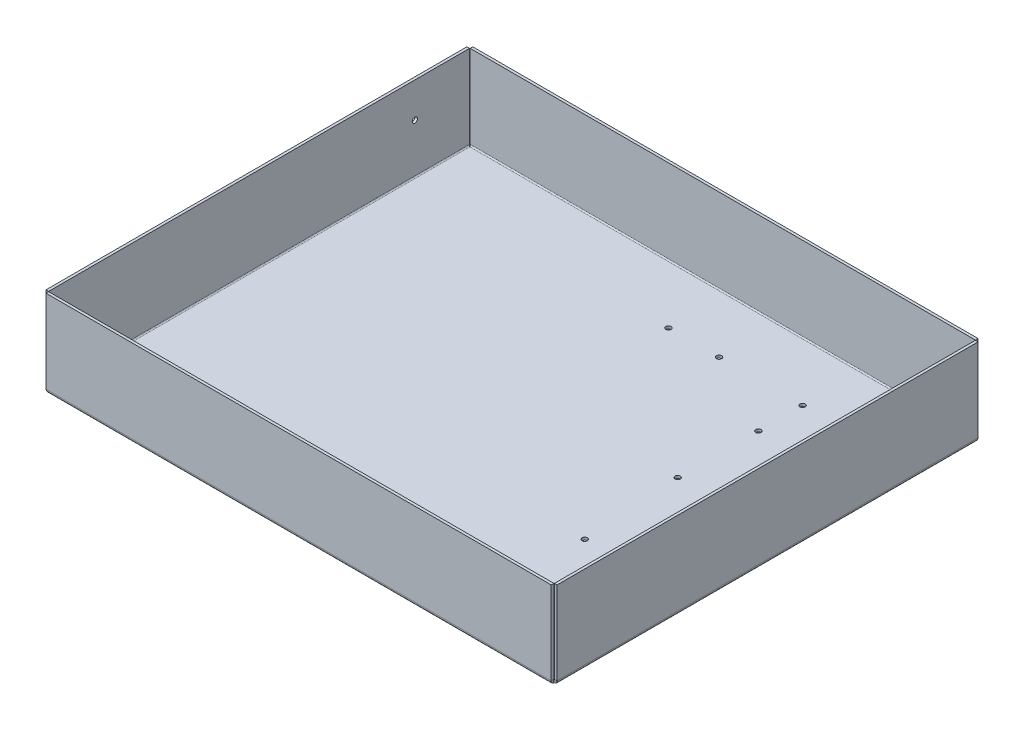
ISO-10303-21;
HEADER;
FILE_DESCRIPTION(('STEP AP214'),'2;1');
FILE_NAME('part.step','',(''),(''),'','','');
FILE_SCHEMA(('AUTOMOTIVE_DESIGN { 1 0 10303 214 1 1 1 1 }'));
ENDSEC;
DATA;
#1=APPLICATION_CONTEXT('core data for automotive mechanical design processes');
#2=APPLICATION_PROTOCOL_DEFINITION('international standard','automotive_design',2000,#1);
#3=PRODUCT_CONTEXT('',#1,'mechanical');
#4=PRODUCT('Part','Part','',(#3));
#5=PRODUCT_RELATED_PRODUCT_CATEGORY('part','',(#4));
#6=PRODUCT_DEFINITION_FORMATION('','',#4);
#7=PRODUCT_DEFINITION_CONTEXT('part definition',#1,'design');
#8=PRODUCT_DEFINITION('design','',#6,#7);
#9=PRODUCT_DEFINITION_SHAPE('','',#8);
#10=(LENGTH_UNIT() NAMED_UNIT(*) SI_UNIT(.MILLI.,.METRE.));
#11=(NAMED_UNIT(*) PLANE_ANGLE_UNIT() SI_UNIT($,.RADIAN.));
#12=(NAMED_UNIT(*) SI_UNIT($,.STERADIAN.) SOLID_ANGLE_UNIT());
#13=UNCERTAINTY_MEASURE_WITH_UNIT(LENGTH_MEASURE(1.E-05),#10,'distance_accuracy_value','');
#14=(GEOMETRIC_REPRESENTATION_CONTEXT(3) GLOBAL_UNCERTAINTY_ASSIGNED_CONTEXT((#13)) GLOBAL_UNIT_ASSIGNED_CONTEXT((#10,
#11,#12)) REPRESENTATION_CONTEXT('',''));
#15=CARTESIAN_POINT('',(0.,0.,0.));
#16=DIRECTION('',(0.,0.,1.));
#17=DIRECTION('',(1.,0.,0.));
#18=AXIS2_PLACEMENT_3D('',#15,#16,#17);
#19=CARTESIAN_POINT('',(0.,1.6002,-254.));
#20=DIRECTION('',(0.,1.,0.));
#21=DIRECTION('',(0.,0.,1.));
#22=AXIS2_PLACEMENT_3D('',#19,#20,#21);
#23=PLANE('',#22);
#24=CARTESIAN_POINT('',(155.06634258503,1.6002,-218.606449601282));
#25=DIRECTION('',(0.,1.,0.));
#26=DIRECTION('',(0.,0.,1.));
#27=AXIS2_PLACEMENT_3D('',#24,#25,#26);
#28=CIRCLE('',#27,1.58749999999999);
#29=CARTESIAN_POINT('',(155.06634258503,1.6002,-217.018949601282));
#30=VERTEX_POINT('',#29);
#31=EDGE_CURVE('E537',#30,#30,#28,.T.);
#32=ORIENTED_EDGE('',*,*,#31,.F.);
#33=EDGE_LOOP('',(#32));
#34=FACE_BOUND('',#33,.T.);
#35=CARTESIAN_POINT('',(185.568404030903,1.6002,-218.606449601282));
#36=DIRECTION('',(0.,1.,0.));
#37=DIRECTION('',(0.,0.,1.));
#38=AXIS2_PLACEMENT_3D('',#35,#36,#37);
#39=CIRCLE('',#38,1.58749999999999);
#40=CARTESIAN_POINT('',(185.568404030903,1.6002,-217.018949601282));
#41=VERTEX_POINT('',#40);
#42=EDGE_CURVE('E527',#41,#41,#39,.T.);
#43=ORIENTED_EDGE('',*,*,#42,.F.);
#44=EDGE_LOOP('',(#43));
#45=FACE_BOUND('',#44,.T.);
#46=CARTESIAN_POINT('',(235.934510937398,1.6002,-218.606449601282));
#47=DIRECTION('',(0.,1.,0.));
#48=DIRECTION('',(0.,0.,1.));
#49=AXIS2_PLACEMENT_3D('',#46,#47,#48);
#50=CIRCLE('',#49,1.58749999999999);
#51=CARTESIAN_POINT('',(235.934510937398,1.6002,-217.018949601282));
#52=VERTEX_POINT('',#51);
#53=EDGE_CURVE('E524',#52,#52,#50,.T.);
#54=ORIENTED_EDGE('',*,*,#53,.F.);
#55=EDGE_LOOP('',(#54));
#56=FACE_BOUND('',#55,.T.);
#57=CARTESIAN_POINT('',(240.110155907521,1.6002,-83.0793749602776));
#58=DIRECTION('',(0.,1.,0.));
#59=DIRECTION('',(0.,0.,1.));
#60=AXIS2_PLACEMENT_3D('',#57,#58,#59);
#61=CIRCLE('',#60,1.58749999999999);
#62=CARTESIAN_POINT('',(240.110155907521,1.6002,-81.4918749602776));
#63=VERTEX_POINT('',#62);
#64=EDGE_CURVE('E521',#63,#63,#61,.T.);
#65=ORIENTED_EDGE('',*,*,#64,.F.);
#66=EDGE_LOOP('',(#65));
#67=FACE_BOUND('',#66,.T.);
#68=CARTESIAN_POINT('',(235.934510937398,1.6002,-143.306520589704));
#69=DIRECTION('',(0.,1.,0.));
#70=DIRECTION('',(0.,0.,1.));
#71=AXIS2_PLACEMENT_3D('',#68,#69,#70);
#72=CIRCLE('',#71,1.58749999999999);
#73=CARTESIAN_POINT('',(235.934510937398,1.6002,-141.719020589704));
#74=VERTEX_POINT('',#73);
#75=EDGE_CURVE('E517',#74,#74,#72,.T.);
#76=ORIENTED_EDGE('',*,*,#75,.F.);
#77=EDGE_LOOP('',(#76));
#78=FACE_BOUND('',#77,.T.);
#79=CARTESIAN_POINT('',(235.934510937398,1.6002,-191.910389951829));
#80=DIRECTION('',(0.,1.,0.));
#81=DIRECTION('',(0.,0.,1.));
#82=AXIS2_PLACEMENT_3D('',#79,#80,#81);
#83=CIRCLE('',#82,1.58749999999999);
#84=CARTESIAN_POINT('',(235.934510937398,1.6002,-190.322889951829));
#85=VERTEX_POINT('',#84);
#86=EDGE_CURVE('E513',#85,#85,#83,.T.);
#87=ORIENTED_EDGE('',*,*,#86,.F.);
#88=EDGE_LOOP('',(#87));
#89=FACE_BOUND('',#88,.T.);
#90=DIRECTION('',(0.,0.,1.));
#91=VECTOR('',#90,1.);
#92=CARTESIAN_POINT('',(0.736599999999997,1.60020000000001,-0.179605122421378));
#93=LINE('',#92,#91);
#94=CARTESIAN_POINT('',(0.736599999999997,1.6002,-0.736599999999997));
#95=VERTEX_POINT('',#94);
#96=CARTESIAN_POINT('',(0.73659999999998,1.6002,-253.2634));
#97=VERTEX_POINT('',#96);
#98=EDGE_CURVE('E457',#95,#97,#93,.F.);
#99=ORIENTED_EDGE('',*,*,#98,.F.);
#100=DIRECTION('',(1.,0.,0.));
#101=VECTOR('',#100,1.);
#102=CARTESIAN_POINT('',(304.620394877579,1.6002,-0.736599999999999));
#103=LINE('',#102,#101);
#104=CARTESIAN_POINT('',(304.0634,1.6002,-0.736599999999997));
#105=VERTEX_POINT('',#104);
#106=EDGE_CURVE('E211',#105,#95,#103,.F.);
#107=ORIENTED_EDGE('',*,*,#106,.F.);
#108=DIRECTION('',(0.,0.,-1.));
#109=VECTOR('',#108,1.);
#110=CARTESIAN_POINT('',(304.0634,1.60019999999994,-253.820394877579));
#111=LINE('',#110,#109);
#112=CARTESIAN_POINT('',(304.0634,1.6002,-253.2634));
#113=VERTEX_POINT('',#112);
#114=EDGE_CURVE('E55',#113,#105,#111,.F.);
#115=ORIENTED_EDGE('',*,*,#114,.F.);
#116=DIRECTION('',(-1.,0.,0.));
#117=VECTOR('',#116,1.);
#118=CARTESIAN_POINT('',(0.179605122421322,1.60019999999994,-253.2634));
#119=LINE('',#118,#117);
#120=EDGE_CURVE('E50',#97,#113,#119,.F.);
#121=ORIENTED_EDGE('',*,*,#120,.F.);
#122=EDGE_LOOP('',(#99,#107,#115,#121));
#123=FACE_BOUND('',#122,.T.);
#124=ADVANCED_FACE('F33',(#34,#45,#56,#67,#78,#89,#123),#23,.T.);
#125=CARTESIAN_POINT('',(0.,0.,-254.));
#126=DIRECTION('',(0.,1.,0.));
#127=DIRECTION('',(0.,0.,1.));
#128=AXIS2_PLACEMENT_3D('',#125,#126,#127);
#129=PLANE('',#128);
#130=CARTESIAN_POINT('',(155.06634258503,0.,-218.606449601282));
#131=DIRECTION('',(0.,1.,0.));
#132=DIRECTION('',(0.,0.,1.));
#133=AXIS2_PLACEMENT_3D('',#130,#131,#132);
#134=CIRCLE('',#133,1.58749999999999);
#135=CARTESIAN_POINT('',(155.06634258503,0.,-217.018949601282));
#136=VERTEX_POINT('',#135);
#137=EDGE_CURVE('E37',#136,#136,#134,.T.);
#138=ORIENTED_EDGE('',*,*,#137,.T.);
#139=EDGE_LOOP('',(#138));
#140=FACE_BOUND('',#139,.T.);
#141=CARTESIAN_POINT('',(185.568404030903,0.,-218.606449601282));
#142=DIRECTION('',(0.,1.,0.));
#143=DIRECTION('',(0.,0.,1.));
#144=AXIS2_PLACEMENT_3D('',#141,#142,#143);
#145=CIRCLE('',#144,1.58749999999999);
#146=CARTESIAN_POINT('',(185.568404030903,0.,-217.018949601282));
#147=VERTEX_POINT('',#146);
#148=EDGE_CURVE('E525',#147,#147,#145,.T.);
#149=ORIENTED_EDGE('',*,*,#148,.T.);
#150=EDGE_LOOP('',(#149));
#151=FACE_BOUND('',#150,.T.);
#152=CARTESIAN_POINT('',(235.934510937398,0.,-218.606449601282));
#153=DIRECTION('',(0.,1.,0.));
#154=DIRECTION('',(0.,0.,1.));
#155=AXIS2_PLACEMENT_3D('',#152,#153,#154);
#156=CIRCLE('',#155,1.58749999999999);
#157=CARTESIAN_POINT('',(235.934510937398,0.,-217.018949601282));
#158=VERTEX_POINT('',#157);
#159=EDGE_CURVE('E522',#158,#158,#156,.T.);
#160=ORIENTED_EDGE('',*,*,#159,.T.);
#161=EDGE_LOOP('',(#160));
#162=FACE_BOUND('',#161,.T.);
#163=CARTESIAN_POINT('',(240.110155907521,0.,-83.0793749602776));
#164=DIRECTION('',(0.,1.,0.));
#165=DIRECTION('',(0.,0.,1.));
#166=AXIS2_PLACEMENT_3D('',#163,#164,#165);
#167=CIRCLE('',#166,1.58749999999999);
#168=CARTESIAN_POINT('',(240.110155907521,0.,-81.4918749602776));
#169=VERTEX_POINT('',#168);
#170=EDGE_CURVE('E518',#169,#169,#167,.T.);
#171=ORIENTED_EDGE('',*,*,#170,.T.);
#172=EDGE_LOOP('',(#171));
#173=FACE_BOUND('',#172,.T.);
#174=CARTESIAN_POINT('',(235.934510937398,0.,-143.306520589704));
#175=DIRECTION('',(0.,1.,0.));
#176=DIRECTION('',(0.,0.,1.));
#177=AXIS2_PLACEMENT_3D('',#174,#175,#176);
#178=CIRCLE('',#177,1.58749999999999);
#179=CARTESIAN_POINT('',(235.934510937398,0.,-141.719020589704));
#180=VERTEX_POINT('',#179);
#181=EDGE_CURVE('E514',#180,#180,#178,.T.);
#182=ORIENTED_EDGE('',*,*,#181,.T.);
#183=EDGE_LOOP('',(#182));
#184=FACE_BOUND('',#183,.T.);
#185=CARTESIAN_POINT('',(235.934510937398,0.,-191.910389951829));
#186=DIRECTION('',(0.,1.,0.));
#187=DIRECTION('',(0.,0.,1.));
#188=AXIS2_PLACEMENT_3D('',#185,#186,#187);
#189=CIRCLE('',#188,1.58749999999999);
#190=CARTESIAN_POINT('',(235.934510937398,0.,-190.322889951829));
#191=VERTEX_POINT('',#190);
#192=EDGE_CURVE('E509',#191,#191,#189,.T.);
#193=ORIENTED_EDGE('',*,*,#192,.T.);
#194=EDGE_LOOP('',(#193));
#195=FACE_BOUND('',#194,.T.);
#196=DIRECTION('',(1.,0.,0.));
#197=VECTOR('',#196,1.);
#198=CARTESIAN_POINT('',(304.620394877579,0.,-0.736599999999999));
#199=LINE('',#198,#197);
#200=CARTESIAN_POINT('',(304.0634,0.,-0.736599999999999));
#201=VERTEX_POINT('',#200);
#202=CARTESIAN_POINT('',(0.736599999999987,0.,-0.736599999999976));
#203=VERTEX_POINT('',#202);
#204=EDGE_CURVE('E220',#201,#203,#199,.F.);
#205=ORIENTED_EDGE('',*,*,#204,.T.);
#206=DIRECTION('',(0.,0.,1.));
#207=VECTOR('',#206,1.);
#208=CARTESIAN_POINT('',(0.736599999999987,0.,-0.179605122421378));
#209=LINE('',#208,#207);
#210=CARTESIAN_POINT('',(0.736599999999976,0.,-253.2634));
#211=VERTEX_POINT('',#210);
#212=EDGE_CURVE('E465',#203,#211,#209,.F.);
#213=ORIENTED_EDGE('',*,*,#212,.T.);
#214=DIRECTION('',(-1.,0.,0.));
#215=VECTOR('',#214,1.);
#216=CARTESIAN_POINT('',(0.179605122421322,0.,-253.2634));
#217=LINE('',#216,#215);
#218=CARTESIAN_POINT('',(304.0634,0.,-253.2634));
#219=VERTEX_POINT('',#218);
#220=EDGE_CURVE('E380',#211,#219,#217,.F.);
#221=ORIENTED_EDGE('',*,*,#220,.T.);
#222=DIRECTION('',(0.,0.,-1.));
#223=VECTOR('',#222,1.);
#224=CARTESIAN_POINT('',(304.0634,0.,-253.820394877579));
#225=LINE('',#224,#223);
#226=EDGE_CURVE('E298',#219,#201,#225,.F.);
#227=ORIENTED_EDGE('',*,*,#226,.T.);
#228=EDGE_LOOP('',(#205,#213,#221,#227));
#229=FACE_BOUND('',#228,.T.);
#230=ADVANCED_FACE('F35',(#140,#151,#162,#173,#184,#195,#229),#129,.F.);
#231=CARTESIAN_POINT('',(0.73659999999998,-0.0160019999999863,-253.2634));
#232=CARTESIAN_POINT('',(0.428564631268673,-0.0160019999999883,-253.30982443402));
#233=CARTESIAN_POINT('',(0.120759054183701,0.0452351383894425,-253.356232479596));
#234=CARTESIAN_POINT('',(-0.448315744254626,0.280953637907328,-253.449064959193));
#235=CARTESIAN_POINT('',(-0.709306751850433,0.455342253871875,-253.495481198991));
#236=CARTESIAN_POINT('',(-1.14485774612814,0.89089324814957,-253.588313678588));
#237=CARTESIAN_POINT('',(-1.31924636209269,1.15188425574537,-253.634729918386));
#238=CARTESIAN_POINT('',(-1.55496486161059,1.72095905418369,-253.727562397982));
#239=CARTESIAN_POINT('',(-1.61620200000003,2.02876463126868,-253.773970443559));
#240=CARTESIAN_POINT('',(-1.61620200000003,2.33679999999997,-253.820394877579));
#241=CARTESIAN_POINT('',(0.73659999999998,0.,-253.2634));
#242=CARTESIAN_POINT('',(0.430659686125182,0.,-253.309824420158));
#243=CARTESIAN_POINT('',(0.124947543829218,0.060820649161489,-253.356232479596));
#244=CARTESIAN_POINT('',(-0.440256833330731,0.294935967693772,-253.449064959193));
#245=CARTESIAN_POINT('',(-0.699472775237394,0.468138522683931,-253.495481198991));
#246=CARTESIAN_POINT('',(-1.13206147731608,0.900727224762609,-253.588313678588));
#247=CARTESIAN_POINT('',(-1.30526403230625,1.15994316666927,-253.634729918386));
#248=CARTESIAN_POINT('',(-1.53937935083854,1.72514754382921,-253.727562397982));
#249=CARTESIAN_POINT('',(-1.60020000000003,2.03085968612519,-253.77397045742));
#250=CARTESIAN_POINT('',(-1.60020000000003,2.33679999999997,-253.820394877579));
#251=CARTESIAN_POINT('',(0.73659999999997,1.60020000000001,-253.2634));
#252=CARTESIAN_POINT('',(0.64016517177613,1.60020000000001,-253.309823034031));
#253=CARTESIAN_POINT('',(0.543796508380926,1.61937172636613,-253.356232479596));
#254=CARTESIAN_POINT('',(0.365634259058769,1.69316894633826,-253.449064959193));
#255=CARTESIAN_POINT('',(0.283924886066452,1.74776540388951,-253.495481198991));
#256=CARTESIAN_POINT('',(0.147565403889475,1.88412488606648,-253.588313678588));
#257=CARTESIAN_POINT('',(0.0929689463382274,1.9658342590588,-253.634729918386));
#258=CARTESIAN_POINT('',(0.019171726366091,2.14399650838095,-253.727562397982));
#259=CARTESIAN_POINT('',(0.,2.2403651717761,-253.773971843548));
#260=CARTESIAN_POINT('',(0.,2.3368,-253.820394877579));
#261=CARTESIAN_POINT('',(0.73659999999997,1.61636202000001,-253.2634));
#262=CARTESIAN_POINT('',(0.642281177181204,1.61636202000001,-253.309823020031));
#263=CARTESIAN_POINT('',(0.548026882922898,1.6351130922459,-253.356232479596));
#264=CARTESIAN_POINT('',(0.373773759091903,1.70729109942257,-253.449064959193));
#265=CARTESIAN_POINT('',(0.29385720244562,1.76068963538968,-253.495481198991));
#266=CARTESIAN_POINT('',(0.160489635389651,1.89405720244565,-253.588313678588));
#267=CARTESIAN_POINT('',(0.107091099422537,1.97397375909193,-253.634729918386));
#268=CARTESIAN_POINT('',(0.0349130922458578,2.14822688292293,-253.727562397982));
#269=CARTESIAN_POINT('',(0.0161620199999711,2.24248117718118,-253.773971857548));
#270=CARTESIAN_POINT('',(0.0161620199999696,2.3368,-253.820394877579));
#271=B_SPLINE_SURFACE_WITH_KNOTS('',1,3,((#231,#232,#233,#234,#235,#236,#237,#238,#239,#240),
(#241,#242,#243,#244,#245,#246,#247,#248,#249,#250),(#251,#252,#253,#254,#255,#256,#257,#258,
#259,#260),(#261,#262,#263,#264,#265,#266,#267,#268,#269,#270)),.UNSPECIFIED.,.F.,.F.,.F.,(2,1,
1,2),(4,2,2,2,4),(-0.01,0.,1.,1.0101),(0.,0.25,0.5,0.75,1.),.UNSPECIFIED.);
#272=DIRECTION('',(1.,0.,0.));
#273=VECTOR('',#272,1.);
#274=CARTESIAN_POINT('',(0.,2.3368,-253.820394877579));
#275=LINE('',#274,#273);
#276=CARTESIAN_POINT('',(-1.60020000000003,2.3368,-253.820394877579));
#277=VERTEX_POINT('',#276);
#278=CARTESIAN_POINT('',(0.,2.33680000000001,-253.820394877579));
#279=VERTEX_POINT('',#278);
#280=EDGE_CURVE('E450',#277,#279,#275,.T.);
#281=CARTESIAN_POINT('',(0.73659999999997,1.60020000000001,-253.2634));
#282=CARTESIAN_POINT('',(0.724547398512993,1.60019974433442,-253.269202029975));
#283=CARTESIAN_POINT('',(0.712494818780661,1.60049580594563,-253.27500405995));
#284=CARTESIAN_POINT('',(0.688418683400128,1.60167872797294,-253.286608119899));
#285=CARTESIAN_POINT('',(0.676395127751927,1.60256558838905,-253.292410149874));
#286=CARTESIAN_POINT('',(0.652406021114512,1.60492827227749,-253.304014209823));
#287=CARTESIAN_POINT('',(0.640440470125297,1.60640409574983,-253.309816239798));
#288=CARTESIAN_POINT('',(0.616596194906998,1.60994106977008,-253.321420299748));
#289=CARTESIAN_POINT('',(0.604717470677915,1.61200222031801,-253.327222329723));
#290=CARTESIAN_POINT('',(0.581075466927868,1.61670490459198,-253.338826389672));
#291=CARTESIAN_POINT('',(0.569312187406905,1.61934643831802,-253.344628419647));
#292=CARTESIAN_POINT('',(0.54592941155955,1.62520351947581,-253.356232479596));
#293=CARTESIAN_POINT('',(0.534309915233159,1.62841906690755,-253.362034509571));
#294=CARTESIAN_POINT('',(0.511242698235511,1.63541643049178,-253.373638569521));
#295=CARTESIAN_POINT('',(0.499794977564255,1.63919824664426,-253.379440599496));
#296=CARTESIAN_POINT('',(0.477098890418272,1.64731903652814,-253.391044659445));
#297=CARTESIAN_POINT('',(0.465850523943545,1.65165801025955,-253.39684668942));
#298=CARTESIAN_POINT('',(0.443580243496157,1.66088266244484,-253.408450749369));
#299=CARTESIAN_POINT('',(0.432558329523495,1.66576834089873,-253.414252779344));
#300=CARTESIAN_POINT('',(0.410767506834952,1.67607463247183,-253.425856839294));
#301=CARTESIAN_POINT('',(0.399998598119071,1.68149524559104,-253.431658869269));
#302=CARTESIAN_POINT('',(0.378739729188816,1.69285834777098,-253.443262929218));
#303=CARTESIAN_POINT('',(0.368249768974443,1.69880083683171,-253.449064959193));
#304=CARTESIAN_POINT('',(0.347574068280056,1.71119337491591,-253.460669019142));
#305=CARTESIAN_POINT('',(0.337388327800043,1.71764342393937,-253.466471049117));
#306=CARTESIAN_POINT('',(0.317345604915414,1.73103554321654,-253.478075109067));
#307=CARTESIAN_POINT('',(0.3074886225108,1.73797761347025,-253.483877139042));
#308=CARTESIAN_POINT('',(0.288127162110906,1.75233705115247,-253.495481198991));
#309=CARTESIAN_POINT('',(0.278622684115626,1.759754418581,-253.501283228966));
#310=CARTESIAN_POINT('',(0.259989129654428,1.77504658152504,-253.512887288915));
#311=CARTESIAN_POINT('',(0.250860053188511,1.78292137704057,-253.51868931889));
#312=CARTESIAN_POINT('',(0.23299929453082,1.79910942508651,-253.53029337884));
#313=CARTESIAN_POINT('',(0.224267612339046,1.80742267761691,-253.536095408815));
#314=CARTESIAN_POINT('',(0.207222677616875,1.82446761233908,-253.547699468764));
#315=CARTESIAN_POINT('',(0.198909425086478,1.83319929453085,-253.553501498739));
#316=CARTESIAN_POINT('',(0.182721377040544,1.85106005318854,-253.565105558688));
#317=CARTESIAN_POINT('',(0.174846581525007,1.86018912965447,-253.570907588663));
#318=CARTESIAN_POINT('',(0.159554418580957,1.87882268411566,-253.582511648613));
#319=CARTESIAN_POINT('',(0.152137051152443,1.88832716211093,-253.588313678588));
#320=CARTESIAN_POINT('',(0.137777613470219,1.90768862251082,-253.599917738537));
#321=CARTESIAN_POINT('',(0.130835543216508,1.91754560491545,-253.605719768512));
#322=CARTESIAN_POINT('',(0.117443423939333,1.93758832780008,-253.617323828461));
#323=CARTESIAN_POINT('',(0.110993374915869,1.94777406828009,-253.623125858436));
#324=CARTESIAN_POINT('',(0.098600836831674,1.96844976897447,-253.634729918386));
#325=CARTESIAN_POINT('',(0.0926583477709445,1.97893972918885,-253.640531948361));
#326=CARTESIAN_POINT('',(0.0812952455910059,2.0001985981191,-253.65213600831));
#327=CARTESIAN_POINT('',(0.0758746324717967,2.01096750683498,-253.657938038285));
#328=CARTESIAN_POINT('',(0.0655683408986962,2.03275832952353,-253.669542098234));
#329=CARTESIAN_POINT('',(0.0606826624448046,2.04378024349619,-253.675344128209));
#330=CARTESIAN_POINT('',(0.0514580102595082,2.06605052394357,-253.686948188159));
#331=CARTESIAN_POINT('',(0.0471190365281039,2.07729889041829,-253.692750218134));
#332=CARTESIAN_POINT('',(0.0389982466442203,2.09999497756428,-253.704354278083));
#333=CARTESIAN_POINT('',(0.0352164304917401,2.11144269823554,-253.710156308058));
#334=CARTESIAN_POINT('',(0.0282190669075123,2.13450991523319,-253.721760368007));
#335=CARTESIAN_POINT('',(0.0250035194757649,2.14612941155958,-253.727562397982));
#336=CARTESIAN_POINT('',(0.019146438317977,2.16951218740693,-253.739166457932));
#337=CARTESIAN_POINT('',(0.0165049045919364,2.18127546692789,-253.744968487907));
#338=CARTESIAN_POINT('',(0.011802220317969,2.20491747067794,-253.756572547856));
#339=CARTESIAN_POINT('',(0.0097410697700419,2.21679619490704,-253.762374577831));
#340=CARTESIAN_POINT('',(0.00620409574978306,2.24064047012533,-253.77397863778));
#341=CARTESIAN_POINT('',(0.00472827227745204,2.25260602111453,-253.779780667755));
#342=CARTESIAN_POINT('',(0.00236558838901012,2.27659512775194,-253.791384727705));
#343=CARTESIAN_POINT('',(0.00147872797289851,2.28861868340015,-253.79718675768));
#344=CARTESIAN_POINT('',(0.000295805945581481,2.3126948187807,-253.808790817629));
#345=CARTESIAN_POINT('',(-2.55665623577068E-07,2.32474739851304,-253.814592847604));
#346=CARTESIAN_POINT('',(0.,2.3368,-253.820394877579));
#347=B_SPLINE_CURVE_WITH_KNOTS('',3,(#281,#282,#283,#284,#285,#286,#287,#288,#289,#290,#291,
#292,#293,#294,#295,#296,#297,#298,#299,#300,#301,#302,#303,#304,#305,#306,#307,#308,#309,#310,
#311,#312,#313,#314,#315,#316,#317,#318,#319,#320,#321,#322,#323,#324,#325,#326,#327,#328,#329,
#330,#331,#332,#333,#334,#335,#336,#337,#338,#339,#340,#341,#342,#343,#344,#345,#346),
.UNSPECIFIED.,.F.,.F.,(4,2,2,2,2,2,2,2,2,2,2,2,2,2,2,2,2,2,2,2,2,2,2,2,2,2,2,2,2,2,2,2,4),(0.,
0.0401259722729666,0.0802519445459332,0.120377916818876,0.160503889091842,0.200629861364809,
0.240755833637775,0.280881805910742,0.321007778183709,0.361133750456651,0.401259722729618,
0.441385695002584,0.481511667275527,0.521637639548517,0.56176361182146,0.60188958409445,
0.642015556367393,0.68214152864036,0.722267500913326,0.762393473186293,0.802519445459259,
0.842645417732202,0.882771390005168,0.922897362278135,0.963023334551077,1.00314930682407,
1.04327527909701,1.08340125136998,1.12352722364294,1.16365319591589,1.20377916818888,
1.24390514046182,1.28403111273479),.UNSPECIFIED.);
#348=EDGE_CURVE('E459',#97,#279,#347,.T.);
#349=DIRECTION('',(0.,-1.,0.));
#350=VECTOR('',#349,1.);
#351=CARTESIAN_POINT('',(0.73659999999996,1.60020000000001,-253.2634));
#352=LINE('',#351,#350);
#353=EDGE_CURVE('E11',#97,#211,#352,.T.);
#354=CARTESIAN_POINT('',(0.73659999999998,0.,-253.2634));
#355=CARTESIAN_POINT('',(0.698364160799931,-8.11077036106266E-07,-253.269202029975));
#356=CARTESIAN_POINT('',(0.660128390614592,0.000938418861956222,-253.27500405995));
#357=CARTESIAN_POINT('',(0.58374892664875,0.00469113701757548,-253.286608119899));
#358=CARTESIAN_POINT('',(0.545605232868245,0.00750462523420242,-253.292410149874));
#359=CARTESIAN_POINT('',(0.469501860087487,0.0150000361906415,-253.304014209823));
#360=CARTESIAN_POINT('',(0.431542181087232,0.0196819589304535,-253.309816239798));
#361=CARTESIAN_POINT('',(0.355898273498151,0.0309027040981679,-253.321420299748));
#362=CARTESIAN_POINT('',(0.318214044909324,0.0374415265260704,-253.327222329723));
#363=CARTESIAN_POINT('',(0.243211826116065,0.0523603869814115,-253.338826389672));
#364=CARTESIAN_POINT('',(0.205893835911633,0.0607404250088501,-253.344628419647));
#365=CARTESIAN_POINT('',(0.131713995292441,0.0793215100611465,-253.356232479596));
#366=CARTESIAN_POINT('',(0.0948521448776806,0.0895225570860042,-253.362034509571));
#367=CARTESIAN_POINT('',(0.0216733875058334,0.11172108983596,-253.373638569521));
#368=CARTESIAN_POINT('',(-0.0146435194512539,0.123718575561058,-253.379440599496));
#369=CARTESIAN_POINT('',(-0.0866448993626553,0.149481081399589,-253.391044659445));
#370=CARTESIAN_POINT('',(-0.122329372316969,0.163246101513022,-253.39684668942));
#371=CARTESIAN_POINT('',(-0.192979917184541,0.192510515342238,-253.408450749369));
#372=CARTESIAN_POINT('',(-0.227945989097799,0.208009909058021,-253.414252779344));
#373=CARTESIAN_POINT('',(-0.297075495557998,0.240705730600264,-253.425856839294));
#374=CARTESIAN_POINT('',(-0.331238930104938,0.257902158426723,-253.431658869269));
#375=CARTESIAN_POINT('',(-0.398680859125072,0.29395062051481,-253.443262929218));
#376=CARTESIAN_POINT('',(-0.431959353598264,0.312802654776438,-253.449064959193));
#377=CARTESIAN_POINT('',(-0.497551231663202,0.352116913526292,-253.460669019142));
#378=CARTESIAN_POINT('',(-0.529864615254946,0.372579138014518,-253.466471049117));
#379=CARTESIAN_POINT('',(-0.593448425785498,0.41506448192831,-253.478075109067));
#380=CARTESIAN_POINT('',(-0.624718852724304,0.437087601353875,-253.483877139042));
#381=CARTESIAN_POINT('',(-0.686141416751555,0.482641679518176,-253.495481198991));
#382=CARTESIAN_POINT('',(-0.71629355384,0.506172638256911,-253.501283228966));
#383=CARTESIAN_POINT('',(-0.775406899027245,0.554685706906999,-253.512887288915));
#384=CARTESIAN_POINT('',(-0.804368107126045,0.579667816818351,-253.51868931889));
#385=CARTESIAN_POINT('',(-0.861029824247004,0.631023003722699,-253.53029337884));
#386=CARTESIAN_POINT('',(-0.888730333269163,0.657396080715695,-253.536095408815));
#387=CARTESIAN_POINT('',(-0.942803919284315,0.711469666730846,-253.547699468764));
#388=CARTESIAN_POINT('',(-0.969176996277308,0.739170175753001,-253.553501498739));
#389=CARTESIAN_POINT('',(-1.02053218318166,0.795831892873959,-253.565105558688));
#390=CARTESIAN_POINT('',(-1.04551429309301,0.824793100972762,-253.570907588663));
#391=CARTESIAN_POINT('',(-1.0940273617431,0.883906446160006,-253.582511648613));
#392=CARTESIAN_POINT('',(-1.11755832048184,0.914058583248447,-253.588313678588));
#393=CARTESIAN_POINT('',(-1.16311239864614,0.975481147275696,-253.599917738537));
#394=CARTESIAN_POINT('',(-1.18513551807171,1.0067515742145,-253.605719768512));
#395=CARTESIAN_POINT('',(-1.2276208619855,1.07033538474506,-253.617323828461));
#396=CARTESIAN_POINT('',(-1.24808308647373,1.1026487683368,-253.623125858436));
#397=CARTESIAN_POINT('',(-1.28739734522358,1.16824064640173,-253.634729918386));
#398=CARTESIAN_POINT('',(-1.30624937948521,1.20151914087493,-253.640531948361));
#399=CARTESIAN_POINT('',(-1.3422978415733,1.26896106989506,-253.65213600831));
#400=CARTESIAN_POINT('',(-1.35949426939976,1.303124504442,-253.657938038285));
#401=CARTESIAN_POINT('',(-1.392190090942,1.3722540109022,-253.669542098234));
#402=CARTESIAN_POINT('',(-1.40768948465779,1.40722008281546,-253.675344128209));
#403=CARTESIAN_POINT('',(-1.436953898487,1.47787062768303,-253.686948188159));
#404=CARTESIAN_POINT('',(-1.45071891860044,1.51355510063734,-253.692750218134));
#405=CARTESIAN_POINT('',(-1.47648142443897,1.58555648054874,-253.704354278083));
#406=CARTESIAN_POINT('',(-1.48847891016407,1.62187338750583,-253.710156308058));
#407=CARTESIAN_POINT('',(-1.51067744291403,1.69505214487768,-253.721760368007));
#408=CARTESIAN_POINT('',(-1.52087848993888,1.73191399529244,-253.727562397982));
#409=CARTESIAN_POINT('',(-1.53945957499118,1.80609383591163,-253.739166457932));
#410=CARTESIAN_POINT('',(-1.54783961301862,1.84341182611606,-253.744968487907));
#411=CARTESIAN_POINT('',(-1.56275847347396,1.91841404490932,-253.756572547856));
#412=CARTESIAN_POINT('',(-1.56929729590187,1.95609827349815,-253.762374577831));
#413=CARTESIAN_POINT('',(-1.58051804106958,2.03174218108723,-253.77397863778));
#414=CARTESIAN_POINT('',(-1.5851999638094,2.06970186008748,-253.779780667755));
#415=CARTESIAN_POINT('',(-1.59269537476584,2.14580523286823,-253.791384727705));
#416=CARTESIAN_POINT('',(-1.59550886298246,2.18394892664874,-253.79718675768));
#417=CARTESIAN_POINT('',(-1.59926158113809,2.26032839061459,-253.808790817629));
#418=CARTESIAN_POINT('',(-1.60020081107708,2.29856416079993,-253.814592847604));
#419=CARTESIAN_POINT('',(-1.60020000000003,2.33679999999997,-253.820394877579));
#420=B_SPLINE_CURVE_WITH_KNOTS('',3,(#354,#355,#356,#357,#358,#359,#360,#361,#362,#363,#364,
#365,#366,#367,#368,#369,#370,#371,#372,#373,#374,#375,#376,#377,#378,#379,#380,#381,#382,#383,
#384,#385,#386,#387,#388,#389,#390,#391,#392,#393,#394,#395,#396,#397,#398,#399,#400,#401,#402,
#403,#404,#405,#406,#407,#408,#409,#410,#411,#412,#413,#414,#415,#416,#417,#418,#419),
.UNSPECIFIED.,.F.,.F.,(4,2,2,2,2,2,2,2,2,2,2,2,2,2,2,2,2,2,2,2,2,2,2,2,2,2,2,2,2,2,2,2,4),(0.,
0.116009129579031,0.232018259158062,0.348027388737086,0.464036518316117,0.580045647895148,
0.696054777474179,0.81206390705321,0.928073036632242,1.04408216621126,1.1600912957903,
1.27610042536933,1.39210955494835,1.50811868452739,1.62412781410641,1.74013694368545,
1.85614607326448,1.97215520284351,2.08816433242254,2.20417346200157,2.3201825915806,
2.43619172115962,2.55220085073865,2.66820998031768,2.78421910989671,2.90022823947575,
3.01623736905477,3.1322464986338,3.24825562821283,3.36426475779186,3.4802738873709,
3.59628301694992,3.71229214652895),.UNSPECIFIED.);
#421=EDGE_CURVE('E492',#211,#277,#420,.T.);
#422=ORIENTED_EDGE('',*,*,#280,.T.);
#423=ORIENTED_EDGE('',*,*,#348,.F.);
#424=ORIENTED_EDGE('',*,*,#353,.T.);
#425=ORIENTED_EDGE('',*,*,#421,.T.);
#426=EDGE_LOOP('',(#422,#423,#424,#425));
#427=FACE_BOUND('',#426,.T.);
#428=ADVANCED_FACE('F483',(#427),#271,.F.);
#429=CARTESIAN_POINT('',(-1.61620199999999,2.33680000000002,-0.179605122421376));
#430=CARTESIAN_POINT('',(-1.61620199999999,2.02876463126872,-0.226029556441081));
#431=CARTESIAN_POINT('',(-1.55496486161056,1.72095905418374,-0.27243760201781));
#432=CARTESIAN_POINT('',(-1.31924636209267,1.15188425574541,-0.365270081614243));
#433=CARTESIAN_POINT('',(-1.14485774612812,0.890893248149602,-0.41168632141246));
#434=CARTESIAN_POINT('',(-0.709306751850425,0.455342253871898,-0.504518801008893));
#435=CARTESIAN_POINT('',(-0.448315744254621,0.280953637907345,-0.55093504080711));
#436=CARTESIAN_POINT('',(0.120759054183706,0.045235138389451,-0.643767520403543));
#437=CARTESIAN_POINT('',(0.428564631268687,-0.0160019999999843,-0.690175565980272));
#438=CARTESIAN_POINT('',(0.736599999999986,-0.0160019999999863,-0.736599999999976));
#439=CARTESIAN_POINT('',(-1.60019999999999,2.33680000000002,-0.179605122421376));
#440=CARTESIAN_POINT('',(-1.60019999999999,2.03085968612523,-0.226029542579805));
#441=CARTESIAN_POINT('',(-1.53937935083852,1.72514754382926,-0.27243760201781));
#442=CARTESIAN_POINT('',(-1.30526403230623,1.1599431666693,-0.365270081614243));
#443=CARTESIAN_POINT('',(-1.13206147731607,0.90072722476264,-0.41168632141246));
#444=CARTESIAN_POINT('',(-0.699472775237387,0.468138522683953,-0.504518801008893));
#445=CARTESIAN_POINT('',(-0.440256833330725,0.29493596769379,-0.55093504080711));
#446=CARTESIAN_POINT('',(0.124947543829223,0.0608206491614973,-0.643767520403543));
#447=CARTESIAN_POINT('',(0.430659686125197,0.,-0.690175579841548));
#448=CARTESIAN_POINT('',(0.736599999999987,0.,-0.736599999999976));
#449=CARTESIAN_POINT('',(0.,2.33680000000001,-0.179605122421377));
#450=CARTESIAN_POINT('',(0.,2.24036517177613,-0.226028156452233));
#451=CARTESIAN_POINT('',(0.0191717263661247,2.14399650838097,-0.27243760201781));
#452=CARTESIAN_POINT('',(0.0929689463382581,1.96583425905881,-0.365270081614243));
#453=CARTESIAN_POINT('',(0.147565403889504,1.88412488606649,-0.41168632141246));
#454=CARTESIAN_POINT('',(0.283924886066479,1.74776540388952,-0.504518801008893));
#455=CARTESIAN_POINT('',(0.365634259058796,1.69316894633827,-0.55093504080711));
#456=CARTESIAN_POINT('',(0.543796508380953,1.61937172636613,-0.643767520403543));
#457=CARTESIAN_POINT('',(0.640165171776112,1.60020000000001,-0.69017696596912));
#458=CARTESIAN_POINT('',(0.736599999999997,1.60020000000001,-0.736599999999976));
#459=CARTESIAN_POINT('',(0.0161620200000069,2.33680000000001,-0.179605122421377));
#460=CARTESIAN_POINT('',(0.0161620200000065,2.2424811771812,-0.226028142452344));
#461=CARTESIAN_POINT('',(0.0349130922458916,2.14822688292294,-0.27243760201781));
#462=CARTESIAN_POINT('',(0.107091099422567,1.97397375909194,-0.365270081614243));
#463=CARTESIAN_POINT('',(0.16048963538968,1.89405720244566,-0.41168632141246));
#464=CARTESIAN_POINT('',(0.293857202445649,1.76068963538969,-0.504518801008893));
#465=CARTESIAN_POINT('',(0.37377375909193,1.70729109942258,-0.55093504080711));
#466=CARTESIAN_POINT('',(0.548026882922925,1.6351130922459,-0.643767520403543));
#467=CARTESIAN_POINT('',(0.642281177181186,1.61636202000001,-0.690176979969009));
#468=CARTESIAN_POINT('',(0.736599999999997,1.61636202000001,-0.736599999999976));
#469=B_SPLINE_SURFACE_WITH_KNOTS('',1,3,((#429,#430,#431,#432,#433,#434,#435,#436,#437,#438),
(#439,#440,#441,#442,#443,#444,#445,#446,#447,#448),(#449,#450,#451,#452,#453,#454,#455,#456,
#457,#458),(#459,#460,#461,#462,#463,#464,#465,#466,#467,#468)),.UNSPECIFIED.,.F.,.F.,.F.,(2,1,
1,2),(4,2,2,2,4),(-0.01,0.,1.,1.0101),(0.,0.25,0.5,0.75,1.),.UNSPECIFIED.);
#470=CARTESIAN_POINT('',(0.,2.33680000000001,-0.179605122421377));
#471=CARTESIAN_POINT('',(-2.55665584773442E-07,2.32474739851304,-0.185407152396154));
#472=CARTESIAN_POINT('',(0.000295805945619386,2.31269481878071,-0.191209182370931));
#473=CARTESIAN_POINT('',(0.00147872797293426,2.28861868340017,-0.202813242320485));
#474=CARTESIAN_POINT('',(0.00236558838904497,2.27659512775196,-0.208615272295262));
#475=CARTESIAN_POINT('',(0.00472827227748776,2.25260602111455,-0.220219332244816));
#476=CARTESIAN_POINT('',(0.00620409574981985,2.24064047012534,-0.226021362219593));
#477=CARTESIAN_POINT('',(0.00974106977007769,2.21679619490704,-0.237625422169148));
#478=CARTESIAN_POINT('',(0.0118022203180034,2.20491747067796,-0.243427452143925));
#479=CARTESIAN_POINT('',(0.0165049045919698,2.18127546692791,-0.255031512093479));
#480=CARTESIAN_POINT('',(0.0191464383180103,2.16951218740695,-0.260833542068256));
#481=CARTESIAN_POINT('',(0.0250035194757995,2.14612941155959,-0.27243760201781));
#482=CARTESIAN_POINT('',(0.0282190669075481,2.1345099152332,-0.278239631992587));
#483=CARTESIAN_POINT('',(0.0352164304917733,2.11144269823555,-0.289843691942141));
#484=CARTESIAN_POINT('',(0.0389982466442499,2.0999949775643,-0.295645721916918));
#485=CARTESIAN_POINT('',(0.0471190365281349,2.07729889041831,-0.307249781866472));
#486=CARTESIAN_POINT('',(0.0514580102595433,2.06605052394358,-0.313051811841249));
#487=CARTESIAN_POINT('',(0.0606826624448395,2.0437802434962,-0.324655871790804));
#488=CARTESIAN_POINT('',(0.0655683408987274,2.03275832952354,-0.330457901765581));
#489=CARTESIAN_POINT('',(0.0758746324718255,2.010967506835,-0.342061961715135));
#490=CARTESIAN_POINT('',(0.0812952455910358,2.00019859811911,-0.347863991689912));
#491=CARTESIAN_POINT('',(0.0926583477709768,1.97893972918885,-0.359468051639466));
#492=CARTESIAN_POINT('',(0.0986008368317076,1.96844976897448,-0.365270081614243));
#493=CARTESIAN_POINT('',(0.1109933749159,1.9477740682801,-0.376874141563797));
#494=CARTESIAN_POINT('',(0.117443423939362,1.93758832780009,-0.382676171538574));
#495=CARTESIAN_POINT('',(0.130835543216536,1.91754560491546,-0.394280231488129));
#496=CARTESIAN_POINT('',(0.137777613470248,1.90768862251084,-0.400082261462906));
#497=CARTESIAN_POINT('',(0.152137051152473,1.88832716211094,-0.41168632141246));
#498=CARTESIAN_POINT('',(0.159554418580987,1.87882268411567,-0.417488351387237));
#499=CARTESIAN_POINT('',(0.174846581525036,1.86018912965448,-0.429092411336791));
#500=CARTESIAN_POINT('',(0.182721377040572,1.85106005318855,-0.434894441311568));
#501=CARTESIAN_POINT('',(0.198909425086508,1.83319929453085,-0.446498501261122));
#502=CARTESIAN_POINT('',(0.207222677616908,1.82446761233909,-0.452300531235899));
#503=CARTESIAN_POINT('',(0.224267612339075,1.80742267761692,-0.463904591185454));
#504=CARTESIAN_POINT('',(0.232999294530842,1.79910942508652,-0.469706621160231));
#505=CARTESIAN_POINT('',(0.250860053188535,1.78292137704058,-0.481310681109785));
#506=CARTESIAN_POINT('',(0.259989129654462,1.77504658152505,-0.487112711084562));
#507=CARTESIAN_POINT('',(0.278622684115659,1.759754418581,-0.498716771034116));
#508=CARTESIAN_POINT('',(0.288127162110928,1.75233705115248,-0.504518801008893));
#509=CARTESIAN_POINT('',(0.307488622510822,1.73797761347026,-0.516122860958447));
#510=CARTESIAN_POINT('',(0.317345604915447,1.73103554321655,-0.521924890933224));
#511=CARTESIAN_POINT('',(0.337388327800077,1.71764342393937,-0.533528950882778));
#512=CARTESIAN_POINT('',(0.347574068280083,1.71119337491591,-0.539330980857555));
#513=CARTESIAN_POINT('',(0.368249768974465,1.69880083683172,-0.55093504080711));
#514=CARTESIAN_POINT('',(0.378739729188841,1.69285834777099,-0.556737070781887));
#515=CARTESIAN_POINT('',(0.399998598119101,1.68149524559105,-0.568341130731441));
#516=CARTESIAN_POINT('',(0.410767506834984,1.67607463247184,-0.574143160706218));
#517=CARTESIAN_POINT('',(0.432558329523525,1.66576834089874,-0.585747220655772));
#518=CARTESIAN_POINT('',(0.443580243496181,1.66088266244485,-0.591549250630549));
#519=CARTESIAN_POINT('',(0.465850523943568,1.65165801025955,-0.603153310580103));
#520=CARTESIAN_POINT('',(0.477098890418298,1.64731903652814,-0.608955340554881));
#521=CARTESIAN_POINT('',(0.499794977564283,1.63919824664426,-0.620559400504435));
#522=CARTESIAN_POINT('',(0.511242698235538,1.63541643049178,-0.626361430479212));
#523=CARTESIAN_POINT('',(0.534309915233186,1.62841906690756,-0.637965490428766));
#524=CARTESIAN_POINT('',(0.545929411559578,1.62520351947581,-0.643767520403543));
#525=CARTESIAN_POINT('',(0.569312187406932,1.61934643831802,-0.655371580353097));
#526=CARTESIAN_POINT('',(0.581075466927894,1.61670490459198,-0.661173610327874));
#527=CARTESIAN_POINT('',(0.604717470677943,1.61200222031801,-0.672777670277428));
#528=CARTESIAN_POINT('',(0.61659619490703,1.60994106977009,-0.678579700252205));
#529=CARTESIAN_POINT('',(0.640440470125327,1.60640409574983,-0.69018376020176));
#530=CARTESIAN_POINT('',(0.652406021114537,1.6049282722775,-0.695985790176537));
#531=CARTESIAN_POINT('',(0.67639512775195,1.60256558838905,-0.707589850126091));
#532=CARTESIAN_POINT('',(0.688418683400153,1.60167872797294,-0.713391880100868));
#533=CARTESIAN_POINT('',(0.712494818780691,1.60049580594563,-0.724995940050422));
#534=CARTESIAN_POINT('',(0.724547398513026,1.60019974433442,-0.730797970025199));
#535=CARTESIAN_POINT('',(0.736599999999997,1.60020000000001,-0.736599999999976));
#536=B_SPLINE_CURVE_WITH_KNOTS('',3,(#470,#471,#472,#473,#474,#475,#476,#477,#478,#479,#480,
#481,#482,#483,#484,#485,#486,#487,#488,#489,#490,#491,#492,#493,#494,#495,#496,#497,#498,#499,
#500,#501,#502,#503,#504,#505,#506,#507,#508,#509,#510,#511,#512,#513,#514,#515,#516,#517,#518,
#519,#520,#521,#522,#523,#524,#525,#526,#527,#528,#529,#530,#531,#532,#533,#534,#535),
.UNSPECIFIED.,.F.,.F.,(4,2,2,2,2,2,2,2,2,2,2,2,2,2,2,2,2,2,2,2,2,2,2,2,2,2,2,2,2,2,2,2,4),(0.,
0.0401259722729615,0.080251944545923,0.120377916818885,0.160503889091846,0.200629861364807,
0.240755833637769,0.28088180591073,0.321007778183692,0.361133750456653,0.401259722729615,
0.441385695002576,0.481511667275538,0.521637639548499,0.561763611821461,0.601889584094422,
0.642015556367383,0.682141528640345,0.722267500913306,0.762393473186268,0.802519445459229,
0.84264541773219,0.882771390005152,0.922897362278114,0.963023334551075,1.00314930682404,
1.043275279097,1.08340125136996,1.12352722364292,1.16365319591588,1.20377916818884,
1.24390514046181,1.28403111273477),.UNSPECIFIED.);
#537=CARTESIAN_POINT('',(0.,2.33680000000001,-0.179605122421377));
#538=VERTEX_POINT('',#537);
#539=EDGE_CURVE('E456',#538,#95,#536,.T.);
#540=DIRECTION('',(1.,0.,0.));
#541=VECTOR('',#540,1.);
#542=CARTESIAN_POINT('',(0.,2.33680000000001,-0.179605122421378));
#543=LINE('',#542,#541);
#544=CARTESIAN_POINT('',(-1.6002,2.33680000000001,-0.179605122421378));
#545=VERTEX_POINT('',#544);
#546=EDGE_CURVE('E453',#545,#538,#543,.T.);
#547=CARTESIAN_POINT('',(-1.60019999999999,2.33680000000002,-0.179605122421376));
#548=CARTESIAN_POINT('',(-1.60020081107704,2.29856416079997,-0.185407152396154));
#549=CARTESIAN_POINT('',(-1.59926158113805,2.26032839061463,-0.191209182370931));
#550=CARTESIAN_POINT('',(-1.59550886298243,2.18394892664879,-0.202813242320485));
#551=CARTESIAN_POINT('',(-1.5926953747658,2.14580523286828,-0.208615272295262));
#552=CARTESIAN_POINT('',(-1.58519996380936,2.06970186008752,-0.220219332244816));
#553=CARTESIAN_POINT('',(-1.58051804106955,2.03174218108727,-0.226021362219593));
#554=CARTESIAN_POINT('',(-1.56929729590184,1.95609827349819,-0.237625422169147));
#555=CARTESIAN_POINT('',(-1.56275847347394,1.91841404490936,-0.243427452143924));
#556=CARTESIAN_POINT('',(-1.54783961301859,1.8434118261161,-0.255031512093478));
#557=CARTESIAN_POINT('',(-1.53945957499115,1.80609383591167,-0.260833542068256));
#558=CARTESIAN_POINT('',(-1.52087848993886,1.73191399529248,-0.27243760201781));
#559=CARTESIAN_POINT('',(-1.510677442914,1.69505214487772,-0.278239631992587));
#560=CARTESIAN_POINT('',(-1.48847891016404,1.62187338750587,-0.289843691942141));
#561=CARTESIAN_POINT('',(-1.47648142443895,1.58555648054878,-0.295645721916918));
#562=CARTESIAN_POINT('',(-1.45071891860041,1.51355510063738,-0.307249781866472));
#563=CARTESIAN_POINT('',(-1.43695389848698,1.47787062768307,-0.313051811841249));
#564=CARTESIAN_POINT('',(-1.40768948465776,1.40722008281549,-0.324655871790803));
#565=CARTESIAN_POINT('',(-1.39219009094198,1.37225401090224,-0.330457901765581));
#566=CARTESIAN_POINT('',(-1.35949426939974,1.30312450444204,-0.342061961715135));
#567=CARTESIAN_POINT('',(-1.34229784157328,1.2689610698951,-0.347863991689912));
#568=CARTESIAN_POINT('',(-1.30624937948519,1.20151914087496,-0.359468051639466));
#569=CARTESIAN_POINT('',(-1.28739734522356,1.16824064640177,-0.365270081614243));
#570=CARTESIAN_POINT('',(-1.24808308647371,1.10264876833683,-0.376874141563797));
#571=CARTESIAN_POINT('',(-1.22762086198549,1.07033538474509,-0.382676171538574));
#572=CARTESIAN_POINT('',(-1.18513551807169,1.00675157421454,-0.394280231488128));
#573=CARTESIAN_POINT('',(-1.16311239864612,0.975481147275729,-0.400082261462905));
#574=CARTESIAN_POINT('',(-1.11755832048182,0.914058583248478,-0.41168632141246));
#575=CARTESIAN_POINT('',(-1.09402736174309,0.883906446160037,-0.417488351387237));
#576=CARTESIAN_POINT('',(-1.045514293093,0.824793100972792,-0.429092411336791));
#577=CARTESIAN_POINT('',(-1.02053218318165,0.795831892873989,-0.434894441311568));
#578=CARTESIAN_POINT('',(-0.969176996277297,0.739170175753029,-0.446498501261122));
#579=CARTESIAN_POINT('',(-0.942803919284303,0.711469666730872,-0.452300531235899));
#580=CARTESIAN_POINT('',(-0.888730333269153,0.657396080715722,-0.463904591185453));
#581=CARTESIAN_POINT('',(-0.861029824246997,0.631023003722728,-0.46970662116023));
#582=CARTESIAN_POINT('',(-0.804368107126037,0.579667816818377,-0.481310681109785));
#583=CARTESIAN_POINT('',(-0.775406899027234,0.554685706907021,-0.487112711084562));
#584=CARTESIAN_POINT('',(-0.71629355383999,0.506172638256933,-0.498716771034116));
#585=CARTESIAN_POINT('',(-0.686141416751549,0.4826416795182,-0.504518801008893));
#586=CARTESIAN_POINT('',(-0.624718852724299,0.437087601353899,-0.516122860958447));
#587=CARTESIAN_POINT('',(-0.593448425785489,0.415064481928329,-0.521924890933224));
#588=CARTESIAN_POINT('',(-0.529864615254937,0.372579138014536,-0.533528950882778));
#589=CARTESIAN_POINT('',(-0.497551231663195,0.352116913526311,-0.539330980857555));
#590=CARTESIAN_POINT('',(-0.43195935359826,0.312802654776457,-0.55093504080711));
#591=CARTESIAN_POINT('',(-0.398680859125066,0.293950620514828,-0.556737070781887));
#592=CARTESIAN_POINT('',(-0.331238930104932,0.257902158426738,-0.568341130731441));
#593=CARTESIAN_POINT('',(-0.29707549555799,0.240705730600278,-0.574143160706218));
#594=CARTESIAN_POINT('',(-0.227945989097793,0.208009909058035,-0.585747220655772));
#595=CARTESIAN_POINT('',(-0.192979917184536,0.192510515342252,-0.591549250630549));
#596=CARTESIAN_POINT('',(-0.122329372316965,0.163246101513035,-0.603153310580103));
#597=CARTESIAN_POINT('',(-0.0866448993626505,0.149481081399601,-0.60895534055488));
#598=CARTESIAN_POINT('',(-0.0146435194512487,0.123718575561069,-0.620559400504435));
#599=CARTESIAN_POINT('',(0.0216733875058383,0.11172108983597,-0.626361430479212));
#600=CARTESIAN_POINT('',(0.0948521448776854,0.0895225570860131,-0.637965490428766));
#601=CARTESIAN_POINT('',(0.131713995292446,0.0793215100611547,-0.643767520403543));
#602=CARTESIAN_POINT('',(0.205893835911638,0.0607404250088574,-0.655371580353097));
#603=CARTESIAN_POINT('',(0.24321182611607,0.0523603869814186,-0.661173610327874));
#604=CARTESIAN_POINT('',(0.318214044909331,0.0374415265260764,-0.672777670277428));
#605=CARTESIAN_POINT('',(0.355898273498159,0.0309027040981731,-0.678579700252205));
#606=CARTESIAN_POINT('',(0.431542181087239,0.0196819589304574,-0.69018376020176));
#607=CARTESIAN_POINT('',(0.469501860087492,0.0150000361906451,-0.695985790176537));
#608=CARTESIAN_POINT('',(0.545605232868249,0.00750462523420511,-0.707589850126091));
#609=CARTESIAN_POINT('',(0.583748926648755,0.00469113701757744,-0.713391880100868));
#610=CARTESIAN_POINT('',(0.660128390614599,0.000938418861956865,-0.724995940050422));
#611=CARTESIAN_POINT('',(0.698364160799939,-8.11077036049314E-07,-0.730797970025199));
#612=CARTESIAN_POINT('',(0.736599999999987,0.,-0.736599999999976));
#613=B_SPLINE_CURVE_WITH_KNOTS('',3,(#547,#548,#549,#550,#551,#552,#553,#554,#555,#556,#557,
#558,#559,#560,#561,#562,#563,#564,#565,#566,#567,#568,#569,#570,#571,#572,#573,#574,#575,#576,
#577,#578,#579,#580,#581,#582,#583,#584,#585,#586,#587,#588,#589,#590,#591,#592,#593,#594,#595,
#596,#597,#598,#599,#600,#601,#602,#603,#604,#605,#606,#607,#608,#609,#610,#611,#612),
.UNSPECIFIED.,.F.,.F.,(4,2,2,2,2,2,2,2,2,2,2,2,2,2,2,2,2,2,2,2,2,2,2,2,2,2,2,2,2,2,2,2,4),(0.,
0.11600912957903,0.23201825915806,0.34802738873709,0.46403651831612,0.58004564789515,
0.696054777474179,0.81206390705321,0.928073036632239,1.04408216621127,1.1600912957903,
1.27610042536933,1.39210955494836,1.50811868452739,1.62412781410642,1.74013694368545,
1.85614607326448,1.97215520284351,2.08816433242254,2.20417346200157,2.3201825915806,
2.43619172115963,2.55220085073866,2.66820998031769,2.78421910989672,2.90022823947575,
3.01623736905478,3.13224649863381,3.24825562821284,3.36426475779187,3.4802738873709,
3.59628301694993,3.71229214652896),.UNSPECIFIED.);
#614=EDGE_CURVE('E464',#545,#203,#613,.T.);
#615=DIRECTION('',(0.,-1.,0.));
#616=VECTOR('',#615,1.);
#617=CARTESIAN_POINT('',(0.736599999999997,1.60020000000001,-0.736599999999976));
#618=LINE('',#617,#616);
#619=EDGE_CURVE('E42',#95,#203,#618,.T.);
#620=ORIENTED_EDGE('',*,*,#539,.F.);
#621=ORIENTED_EDGE('',*,*,#546,.F.);
#622=ORIENTED_EDGE('',*,*,#614,.T.);
#623=ORIENTED_EDGE('',*,*,#619,.F.);
#624=EDGE_LOOP('',(#620,#621,#622,#623));
#625=FACE_BOUND('',#624,.T.);
#626=ADVANCED_FACE('F480',(#625),#469,.F.);
#627=CARTESIAN_POINT('',(0.736600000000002,2.33680000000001,-0.179605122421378));
#628=DIRECTION('',(0.,0.,1.));
#629=DIRECTION('',(-1.,0.,0.));
#630=AXIS2_PLACEMENT_3D('',#627,#628,#629);
#631=CYLINDRICAL_SURFACE('',#630,2.3368);
#632=ORIENTED_EDGE('',*,*,#212,.F.);
#633=ORIENTED_EDGE('',*,*,#614,.F.);
#634=DIRECTION('',(0.,0.,1.));
#635=VECTOR('',#634,1.);
#636=CARTESIAN_POINT('',(-1.60020000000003,2.33679999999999,-254.));
#637=LINE('',#636,#635);
#638=EDGE_CURVE('E444',#277,#545,#637,.T.);
#639=ORIENTED_EDGE('',*,*,#638,.F.);
#640=ORIENTED_EDGE('',*,*,#421,.F.);
#641=EDGE_LOOP('',(#632,#633,#639,#640));
#642=FACE_BOUND('',#641,.T.);
#643=ADVANCED_FACE('F478',(#642),#631,.T.);
#644=CARTESIAN_POINT('',(0.736600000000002,2.33680000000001,-0.179605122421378));
#645=DIRECTION('',(0.,0.,1.));
#646=DIRECTION('',(-1.,0.,0.));
#647=AXIS2_PLACEMENT_3D('',#644,#645,#646);
#648=CYLINDRICAL_SURFACE('',#647,0.736599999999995);
#649=ORIENTED_EDGE('',*,*,#98,.T.);
#650=ORIENTED_EDGE('',*,*,#348,.T.);
#651=DIRECTION('',(0.,0.,1.));
#652=VECTOR('',#651,1.);
#653=CARTESIAN_POINT('',(0.,2.3368,-254.));
#654=LINE('',#653,#652);
#655=EDGE_CURVE('E442',#279,#538,#654,.T.);
#656=ORIENTED_EDGE('',*,*,#655,.T.);
#657=ORIENTED_EDGE('',*,*,#539,.T.);
#658=EDGE_LOOP('',(#649,#650,#656,#657));
#659=FACE_BOUND('',#658,.T.);
#660=ADVANCED_FACE('F467',(#659),#648,.F.);
#661=CARTESIAN_POINT('',(0.,1.6002,-253.820394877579));
#662=DIRECTION('',(0.,0.,-1.));
#663=DIRECTION('',(0.,1.,0.));
#664=AXIS2_PLACEMENT_3D('',#661,#662,#663);
#665=PLANE('',#664);
#666=DIRECTION('',(0.,-1.,0.));
#667=VECTOR('',#666,1.);
#668=CARTESIAN_POINT('',(-1.60020000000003,1.60019999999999,-253.820394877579));
#669=LINE('',#668,#667);
#670=CARTESIAN_POINT('',(-1.60020000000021,52.4002,-253.820394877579));
#671=VERTEX_POINT('',#670);
#672=EDGE_CURVE('E436',#671,#277,#669,.T.);
#673=ORIENTED_EDGE('',*,*,#672,.F.);
#674=DIRECTION('',(1.,0.,0.));
#675=VECTOR('',#674,1.);
#676=CARTESIAN_POINT('',(-1.60020000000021,52.4002,-253.820394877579));
#677=LINE('',#676,#675);
#678=CARTESIAN_POINT('',(-2.05103201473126E-13,52.4002,-253.820394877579));
#679=VERTEX_POINT('',#678);
#680=EDGE_CURVE('E439',#671,#679,#677,.T.);
#681=ORIENTED_EDGE('',*,*,#680,.T.);
#682=DIRECTION('',(0.,1.,0.));
#683=VECTOR('',#682,1.);
#684=CARTESIAN_POINT('',(0.,1.6002,-253.820394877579));
#685=LINE('',#684,#683);
#686=EDGE_CURVE('E433',#279,#679,#685,.T.);
#687=ORIENTED_EDGE('',*,*,#686,.F.);
#688=ORIENTED_EDGE('',*,*,#280,.F.);
#689=EDGE_LOOP('',(#673,#681,#687,#688));
#690=FACE_BOUND('',#689,.T.);
#691=ADVANCED_FACE('F477',(#690),#665,.T.);
#692=CARTESIAN_POINT('',(-1.60020000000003,1.60019999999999,-254.));
#693=DIRECTION('',(-1.,0.,0.));
#694=DIRECTION('',(0.,-1.,0.));
#695=AXIS2_PLACEMENT_3D('',#692,#693,#694);
#696=PLANE('',#695);
#697=CARTESIAN_POINT('',(-1.60020000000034,31.383253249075,-220.867195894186));
#698=DIRECTION('',(1.,0.,0.));
#699=DIRECTION('',(0.,1.,0.));
#700=AXIS2_PLACEMENT_3D('',#697,#698,#699);
#701=CIRCLE('',#700,1.58749999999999);
#702=CARTESIAN_POINT('',(-1.60020000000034,32.970753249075,-220.867195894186));
#703=VERTEX_POINT('',#702);
#704=EDGE_CURVE('E1126',#703,#703,#701,.T.);
#705=ORIENTED_EDGE('',*,*,#704,.T.);
#706=EDGE_LOOP('',(#705));
#707=FACE_BOUND('',#706,.T.);
#708=DIRECTION('',(0.,-1.,0.));
#709=VECTOR('',#708,1.);
#710=CARTESIAN_POINT('',(-1.6002,1.60020000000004,-0.179605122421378));
#711=LINE('',#710,#709);
#712=CARTESIAN_POINT('',(-1.60020000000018,52.4002,-0.179605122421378));
#713=VERTEX_POINT('',#712);
#714=EDGE_CURVE('E428',#713,#545,#711,.T.);
#715=ORIENTED_EDGE('',*,*,#714,.F.);
#716=DIRECTION('',(0.,0.,-1.));
#717=VECTOR('',#716,1.);
#718=CARTESIAN_POINT('',(-1.60020000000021,52.4002,-254.));
#719=LINE('',#718,#717);
#720=EDGE_CURVE('E448',#713,#671,#719,.T.);
#721=ORIENTED_EDGE('',*,*,#720,.T.);
#722=ORIENTED_EDGE('',*,*,#672,.T.);
#723=ORIENTED_EDGE('',*,*,#638,.T.);
#724=EDGE_LOOP('',(#715,#721,#722,#723));
#725=FACE_BOUND('',#724,.T.);
#726=ADVANCED_FACE('F579',(#707,#725),#696,.T.);
#727=CARTESIAN_POINT('',(0.,1.6002,-254.));
#728=DIRECTION('',(-1.,0.,0.));
#729=DIRECTION('',(0.,-1.,0.));
#730=AXIS2_PLACEMENT_3D('',#727,#728,#729);
#731=PLANE('',#730);
#732=CARTESIAN_POINT('',(-1.33709067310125E-13,31.383253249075,-220.867195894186));
#733=DIRECTION('',(1.,0.,0.));
#734=DIRECTION('',(0.,1.,0.));
#735=AXIS2_PLACEMENT_3D('',#732,#733,#734);
#736=CIRCLE('',#735,1.58749999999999);
#737=CARTESIAN_POINT('',(-1.39251793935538E-13,32.970753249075,-220.867195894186));
#738=VERTEX_POINT('',#737);
#739=EDGE_CURVE('E1129',#738,#738,#736,.T.);
#740=ORIENTED_EDGE('',*,*,#739,.F.);
#741=EDGE_LOOP('',(#740));
#742=FACE_BOUND('',#741,.T.);
#743=DIRECTION('',(0.,0.,-1.));
#744=VECTOR('',#743,1.);
#745=CARTESIAN_POINT('',(-2.0512282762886E-13,52.4002,-254.));
#746=LINE('',#745,#744);
#747=CARTESIAN_POINT('',(-1.77386878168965E-13,52.4002,-0.179605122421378));
#748=VERTEX_POINT('',#747);
#749=EDGE_CURVE('E447',#748,#679,#746,.T.);
#750=ORIENTED_EDGE('',*,*,#749,.F.);
#751=DIRECTION('',(0.,1.,0.));
#752=VECTOR('',#751,1.);
#753=CARTESIAN_POINT('',(0.,1.6002,-0.179605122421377));
#754=LINE('',#753,#752);
#755=EDGE_CURVE('E425',#538,#748,#754,.T.);
#756=ORIENTED_EDGE('',*,*,#755,.F.);
#757=ORIENTED_EDGE('',*,*,#655,.F.);
#758=ORIENTED_EDGE('',*,*,#686,.T.);
#759=EDGE_LOOP('',(#750,#756,#757,#758));
#760=FACE_BOUND('',#759,.T.);
#761=ADVANCED_FACE('F589',(#742,#760),#731,.F.);
#762=CARTESIAN_POINT('',(-1.60020000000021,52.4002,-254.));
#763=DIRECTION('',(0.,-1.,0.));
#764=DIRECTION('',(1.,0.,0.));
#765=AXIS2_PLACEMENT_3D('',#762,#763,#764);
#766=PLANE('',#765);
#767=ORIENTED_EDGE('',*,*,#720,.F.);
#768=DIRECTION('',(1.,0.,0.));
#769=VECTOR('',#768,1.);
#770=CARTESIAN_POINT('',(-1.60020000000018,52.4002,-0.179605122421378));
#771=LINE('',#770,#769);
#772=EDGE_CURVE('E431',#713,#748,#771,.T.);
#773=ORIENTED_EDGE('',*,*,#772,.T.);
#774=ORIENTED_EDGE('',*,*,#749,.T.);
#775=ORIENTED_EDGE('',*,*,#680,.F.);
#776=EDGE_LOOP('',(#767,#773,#774,#775));
#777=FACE_BOUND('',#776,.T.);
#778=ADVANCED_FACE('F586',(#777),#766,.F.);
#779=CARTESIAN_POINT('',(0.,1.6002,-0.179605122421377));
#780=DIRECTION('',(0.,0.,-1.));
#781=DIRECTION('',(0.,1.,0.));
#782=AXIS2_PLACEMENT_3D('',#779,#780,#781);
#783=PLANE('',#782);
#784=ORIENTED_EDGE('',*,*,#772,.F.);
#785=ORIENTED_EDGE('',*,*,#714,.T.);
#786=ORIENTED_EDGE('',*,*,#546,.T.);
#787=ORIENTED_EDGE('',*,*,#755,.T.);
#788=EDGE_LOOP('',(#784,#785,#786,#787));
#789=FACE_BOUND('',#788,.T.);
#790=ADVANCED_FACE('F583',(#789),#783,.F.);
#791=CARTESIAN_POINT('',(304.0634,-0.0160020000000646,-253.2634));
#792=CARTESIAN_POINT('',(304.10982443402,-0.0160020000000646,-253.571435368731));
#793=CARTESIAN_POINT('',(304.156232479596,0.045235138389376,-253.879240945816));
#794=CARTESIAN_POINT('',(304.249064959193,0.280953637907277,-254.448315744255));
#795=CARTESIAN_POINT('',(304.295481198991,0.455342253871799,-254.70930675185));
#796=CARTESIAN_POINT('',(304.388313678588,0.890893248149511,-255.144857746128));
#797=CARTESIAN_POINT('',(304.434729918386,1.15188425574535,-255.319246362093));
#798=CARTESIAN_POINT('',(304.527562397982,1.72095905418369,-255.554964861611));
#799=CARTESIAN_POINT('',(304.573970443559,2.02876463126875,-255.616202));
#800=CARTESIAN_POINT('',(304.620394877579,2.33679999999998,-255.616202));
#801=CARTESIAN_POINT('',(304.0634,0.,-253.2634));
#802=CARTESIAN_POINT('',(304.109824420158,0.,-253.569340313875));
#803=CARTESIAN_POINT('',(304.156232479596,0.0608206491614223,-253.875052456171));
#804=CARTESIAN_POINT('',(304.249064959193,0.294935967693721,-254.440256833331));
#805=CARTESIAN_POINT('',(304.295481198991,0.468138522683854,-254.699472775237));
#806=CARTESIAN_POINT('',(304.388313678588,0.90072722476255,-255.132061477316));
#807=CARTESIAN_POINT('',(304.434729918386,1.15994316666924,-255.305264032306));
#808=CARTESIAN_POINT('',(304.527562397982,1.72514754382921,-255.539379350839));
#809=CARTESIAN_POINT('',(304.57397045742,2.03085968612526,-255.6002));
#810=CARTESIAN_POINT('',(304.620394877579,2.33679999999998,-255.6002));
#811=CARTESIAN_POINT('',(304.0634,1.60019999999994,-253.2634));
#812=CARTESIAN_POINT('',(304.109823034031,1.60019999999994,-253.359834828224));
#813=CARTESIAN_POINT('',(304.156232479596,1.61937172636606,-253.456203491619));
#814=CARTESIAN_POINT('',(304.249064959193,1.69316894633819,-253.634365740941));
#815=CARTESIAN_POINT('',(304.295481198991,1.74776540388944,-253.716075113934));
#816=CARTESIAN_POINT('',(304.388313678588,1.88412488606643,-253.85243459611));
#817=CARTESIAN_POINT('',(304.434729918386,1.96583425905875,-253.907031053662));
#818=CARTESIAN_POINT('',(304.527562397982,2.14399650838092,-253.980828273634));
#819=CARTESIAN_POINT('',(304.573971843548,2.24036517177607,-254.));
#820=CARTESIAN_POINT('',(304.620394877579,2.33679999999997,-254.));
#821=CARTESIAN_POINT('',(304.0634,1.61636201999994,-253.2634));
#822=CARTESIAN_POINT('',(304.109823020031,1.61636201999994,-253.357718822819));
#823=CARTESIAN_POINT('',(304.156232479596,1.63511309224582,-253.451973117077));
#824=CARTESIAN_POINT('',(304.249064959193,1.7072910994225,-253.626226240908));
#825=CARTESIAN_POINT('',(304.295481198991,1.76068963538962,-253.706142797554));
#826=CARTESIAN_POINT('',(304.388313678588,1.8940572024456,-253.83951036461));
#827=CARTESIAN_POINT('',(304.434729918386,1.97397375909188,-253.892908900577));
#828=CARTESIAN_POINT('',(304.527562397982,2.14822688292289,-253.965086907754));
#829=CARTESIAN_POINT('',(304.573971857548,2.24248117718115,-253.98383798));
#830=CARTESIAN_POINT('',(304.620394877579,2.33679999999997,-253.98383798));
#831=B_SPLINE_SURFACE_WITH_KNOTS('',1,3,((#791,#792,#793,#794,#795,#796,#797,#798,#799,#800),
(#801,#802,#803,#804,#805,#806,#807,#808,#809,#810),(#811,#812,#813,#814,#815,#816,#817,#818,
#819,#820),(#821,#822,#823,#824,#825,#826,#827,#828,#829,#830)),.UNSPECIFIED.,.F.,.F.,.F.,(2,1,
1,2),(4,2,2,2,4),(-0.01,0.,1.,1.0101),(0.,0.25,0.5,0.75,1.),.UNSPECIFIED.);
#832=DIRECTION('',(0.,0.,1.));
#833=VECTOR('',#832,1.);
#834=CARTESIAN_POINT('',(304.620394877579,2.33679999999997,-254.));
#835=LINE('',#834,#833);
#836=CARTESIAN_POINT('',(304.620394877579,2.33679999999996,-255.6002));
#837=VERTEX_POINT('',#836);
#838=CARTESIAN_POINT('',(304.620394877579,2.33679999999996,-254.));
#839=VERTEX_POINT('',#838);
#840=EDGE_CURVE('E366',#837,#839,#835,.T.);
#841=CARTESIAN_POINT('',(304.0634,1.60019999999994,-253.2634));
#842=CARTESIAN_POINT('',(304.069202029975,1.60019974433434,-253.275452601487));
#843=CARTESIAN_POINT('',(304.07500405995,1.60049580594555,-253.287505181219));
#844=CARTESIAN_POINT('',(304.086608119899,1.60167872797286,-253.3115813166));
#845=CARTESIAN_POINT('',(304.092410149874,1.60256558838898,-253.323604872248));
#846=CARTESIAN_POINT('',(304.104014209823,1.60492827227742,-253.347593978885));
#847=CARTESIAN_POINT('',(304.109816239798,1.60640409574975,-253.359559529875));
#848=CARTESIAN_POINT('',(304.121420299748,1.60994106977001,-253.383403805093));
#849=CARTESIAN_POINT('',(304.127222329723,1.61200222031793,-253.395282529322));
#850=CARTESIAN_POINT('',(304.138826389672,1.6167049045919,-253.418924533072));
#851=CARTESIAN_POINT('',(304.144628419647,1.61934643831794,-253.430687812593));
#852=CARTESIAN_POINT('',(304.156232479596,1.62520351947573,-253.45407058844));
#853=CARTESIAN_POINT('',(304.162034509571,1.62841906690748,-253.465690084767));
#854=CARTESIAN_POINT('',(304.173638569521,1.6354164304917,-253.488757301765));
#855=CARTESIAN_POINT('',(304.179440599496,1.63919824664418,-253.500205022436));
#856=CARTESIAN_POINT('',(304.191044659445,1.64731903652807,-253.522901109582));
#857=CARTESIAN_POINT('',(304.19684668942,1.65165801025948,-253.534149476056));
#858=CARTESIAN_POINT('',(304.208450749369,1.66088266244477,-253.556419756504));
#859=CARTESIAN_POINT('',(304.214252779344,1.66576834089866,-253.567441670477));
#860=CARTESIAN_POINT('',(304.225856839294,1.67607463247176,-253.589232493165));
#861=CARTESIAN_POINT('',(304.231658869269,1.68149524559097,-253.600001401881));
#862=CARTESIAN_POINT('',(304.243262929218,1.69285834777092,-253.621260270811));
#863=CARTESIAN_POINT('',(304.249064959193,1.69880083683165,-253.631750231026));
#864=CARTESIAN_POINT('',(304.260669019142,1.71119337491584,-253.65242593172));
#865=CARTESIAN_POINT('',(304.266471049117,1.7176434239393,-253.6626116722));
#866=CARTESIAN_POINT('',(304.278075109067,1.73103554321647,-253.682654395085));
#867=CARTESIAN_POINT('',(304.283877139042,1.73797761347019,-253.692511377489));
#868=CARTESIAN_POINT('',(304.295481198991,1.75233705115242,-253.711872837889));
#869=CARTESIAN_POINT('',(304.301283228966,1.75975441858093,-253.721377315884));
#870=CARTESIAN_POINT('',(304.312887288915,1.77504658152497,-253.740010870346));
#871=CARTESIAN_POINT('',(304.31868931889,1.78292137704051,-253.749139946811));
#872=CARTESIAN_POINT('',(304.33029337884,1.79910942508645,-253.767000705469));
#873=CARTESIAN_POINT('',(304.336095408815,1.80742267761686,-253.775732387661));
#874=CARTESIAN_POINT('',(304.347699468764,1.82446761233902,-253.792777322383));
#875=CARTESIAN_POINT('',(304.353501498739,1.83319929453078,-253.801090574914));
#876=CARTESIAN_POINT('',(304.365105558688,1.85106005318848,-253.817278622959));
#877=CARTESIAN_POINT('',(304.370907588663,1.86018912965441,-253.825153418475));
#878=CARTESIAN_POINT('',(304.382511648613,1.87882268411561,-253.840445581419));
#879=CARTESIAN_POINT('',(304.388313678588,1.88832716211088,-253.847862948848));
#880=CARTESIAN_POINT('',(304.399917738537,1.90768862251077,-253.86222238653));
#881=CARTESIAN_POINT('',(304.405719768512,1.91754560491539,-253.869164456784));
#882=CARTESIAN_POINT('',(304.417323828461,1.93758832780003,-253.882556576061));
#883=CARTESIAN_POINT('',(304.423125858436,1.94777406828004,-253.889006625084));
#884=CARTESIAN_POINT('',(304.434729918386,1.96844976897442,-253.901399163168));
#885=CARTESIAN_POINT('',(304.440531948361,1.97893972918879,-253.907341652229));
#886=CARTESIAN_POINT('',(304.45213600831,2.00019859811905,-253.918704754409));
#887=CARTESIAN_POINT('',(304.457938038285,2.01096750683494,-253.924125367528));
#888=CARTESIAN_POINT('',(304.469542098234,2.03275832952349,-253.934431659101));
#889=CARTESIAN_POINT('',(304.475344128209,2.04378024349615,-253.939317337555));
#890=CARTESIAN_POINT('',(304.486948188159,2.06605052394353,-253.948541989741));
#891=CARTESIAN_POINT('',(304.492750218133,2.07729889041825,-253.952880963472));
#892=CARTESIAN_POINT('',(304.504354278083,2.09999497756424,-253.961001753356));
#893=CARTESIAN_POINT('',(304.510156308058,2.1114426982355,-253.964783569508));
#894=CARTESIAN_POINT('',(304.521760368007,2.13450991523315,-253.971780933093));
#895=CARTESIAN_POINT('',(304.527562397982,2.14612941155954,-253.974996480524));
#896=CARTESIAN_POINT('',(304.539166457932,2.16951218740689,-253.980853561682));
#897=CARTESIAN_POINT('',(304.544968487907,2.18127546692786,-253.983495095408));
#898=CARTESIAN_POINT('',(304.556572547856,2.20491747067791,-253.988197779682));
#899=CARTESIAN_POINT('',(304.562374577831,2.21679619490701,-253.99025893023));
#900=CARTESIAN_POINT('',(304.57397863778,2.2406404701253,-253.99379590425));
#901=CARTESIAN_POINT('',(304.579780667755,2.2526060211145,-253.995271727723));
#902=CARTESIAN_POINT('',(304.591384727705,2.27659512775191,-253.997634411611));
#903=CARTESIAN_POINT('',(304.597186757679,2.28861868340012,-253.998521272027));
#904=CARTESIAN_POINT('',(304.608790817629,2.31269481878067,-253.999704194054));
#905=CARTESIAN_POINT('',(304.614592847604,2.32474739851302,-254.000000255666));
#906=CARTESIAN_POINT('',(304.620394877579,2.33679999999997,-254.));
#907=B_SPLINE_CURVE_WITH_KNOTS('',3,(#841,#842,#843,#844,#845,#846,#847,#848,#849,#850,#851,
#852,#853,#854,#855,#856,#857,#858,#859,#860,#861,#862,#863,#864,#865,#866,#867,#868,#869,#870,
#871,#872,#873,#874,#875,#876,#877,#878,#879,#880,#881,#882,#883,#884,#885,#886,#887,#888,#889,
#890,#891,#892,#893,#894,#895,#896,#897,#898,#899,#900,#901,#902,#903,#904,#905,#906),
.UNSPECIFIED.,.F.,.F.,(4,2,2,2,2,2,2,2,2,2,2,2,2,2,2,2,2,2,2,2,2,2,2,2,2,2,2,2,2,2,2,2,4),(0.,
0.0401259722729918,0.0802519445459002,0.120377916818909,0.160503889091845,0.200629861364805,
0.240755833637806,0.280881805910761,0.321007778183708,0.361133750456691,0.40125972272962,
0.441385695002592,0.48151166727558,0.521637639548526,0.561763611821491,0.60188958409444,
0.642015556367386,0.682141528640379,0.722267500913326,0.762393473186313,0.802519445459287,
0.842645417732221,0.882771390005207,0.922897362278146,0.9630233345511,1.00314930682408,
1.04327527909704,1.08340125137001,1.12352722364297,1.16365319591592,1.20377916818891,
1.24390514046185,1.28403111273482),.UNSPECIFIED.);
#908=EDGE_CURVE('E374',#113,#839,#907,.T.);
#909=DIRECTION('',(0.,-1.,0.));
#910=VECTOR('',#909,1.);
#911=CARTESIAN_POINT('',(304.0634,1.60019999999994,-253.2634));
#912=LINE('',#911,#910);
#913=EDGE_CURVE('E417',#113,#219,#912,.T.);
#914=CARTESIAN_POINT('',(304.0634,0.,-253.2634));
#915=CARTESIAN_POINT('',(304.069202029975,-8.11077116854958E-07,-253.3016358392));
#916=CARTESIAN_POINT('',(304.07500405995,0.000938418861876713,-253.339871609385));
#917=CARTESIAN_POINT('',(304.086608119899,0.00469113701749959,-253.416251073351));
#918=CARTESIAN_POINT('',(304.092410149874,0.00750462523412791,-253.454394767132));
#919=CARTESIAN_POINT('',(304.104014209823,0.0150000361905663,-253.530498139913));
#920=CARTESIAN_POINT('',(304.109816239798,0.0196819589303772,-253.568457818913));
#921=CARTESIAN_POINT('',(304.121420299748,0.0309027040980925,-253.644101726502));
#922=CARTESIAN_POINT('',(304.127222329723,0.0374415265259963,-253.681785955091));
#923=CARTESIAN_POINT('',(304.138826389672,0.0523603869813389,-253.756788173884));
#924=CARTESIAN_POINT('',(304.144628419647,0.060740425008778,-253.794106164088));
#925=CARTESIAN_POINT('',(304.156232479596,0.0793215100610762,-253.868286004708));
#926=CARTESIAN_POINT('',(304.162034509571,0.0895225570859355,-253.905147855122));
#927=CARTESIAN_POINT('',(304.173638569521,0.11172108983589,-253.978326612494));
#928=CARTESIAN_POINT('',(304.179440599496,0.123718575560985,-254.014643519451));
#929=CARTESIAN_POINT('',(304.191044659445,0.14948108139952,-254.086644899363));
#930=CARTESIAN_POINT('',(304.19684668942,0.163246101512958,-254.122329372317));
#931=CARTESIAN_POINT('',(304.208450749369,0.192510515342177,-254.192979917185));
#932=CARTESIAN_POINT('',(304.214252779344,0.208009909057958,-254.227945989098));
#933=CARTESIAN_POINT('',(304.225856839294,0.240705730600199,-254.297075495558));
#934=CARTESIAN_POINT('',(304.231658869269,0.257902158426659,-254.331238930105));
#935=CARTESIAN_POINT('',(304.243262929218,0.293950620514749,-254.398680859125));
#936=CARTESIAN_POINT('',(304.249064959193,0.312802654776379,-254.431959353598));
#937=CARTESIAN_POINT('',(304.260669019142,0.352116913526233,-254.497551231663));
#938=CARTESIAN_POINT('',(304.266471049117,0.372579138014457,-254.529864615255));
#939=CARTESIAN_POINT('',(304.278075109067,0.415064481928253,-254.593448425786));
#940=CARTESIAN_POINT('',(304.283877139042,0.437087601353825,-254.624718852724));
#941=CARTESIAN_POINT('',(304.295481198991,0.482641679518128,-254.686141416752));
#942=CARTESIAN_POINT('',(304.301283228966,0.50617263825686,-254.71629355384));
#943=CARTESIAN_POINT('',(304.312887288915,0.554685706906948,-254.775406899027));
#944=CARTESIAN_POINT('',(304.31868931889,0.579667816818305,-254.804368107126));
#945=CARTESIAN_POINT('',(304.33029337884,0.631023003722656,-254.861029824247));
#946=CARTESIAN_POINT('',(304.336095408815,0.657396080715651,-254.888730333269));
#947=CARTESIAN_POINT('',(304.347699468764,0.711469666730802,-254.942803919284));
#948=CARTESIAN_POINT('',(304.353501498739,0.739170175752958,-254.969176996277));
#949=CARTESIAN_POINT('',(304.365105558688,0.795831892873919,-255.020532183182));
#950=CARTESIAN_POINT('',(304.370907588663,0.824793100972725,-255.045514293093));
#951=CARTESIAN_POINT('',(304.382511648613,0.883906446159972,-255.094027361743));
#952=CARTESIAN_POINT('',(304.388313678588,0.914058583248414,-255.117558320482));
#953=CARTESIAN_POINT('',(304.399917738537,0.975481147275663,-255.163112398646));
#954=CARTESIAN_POINT('',(304.405719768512,1.00675157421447,-255.185135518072));
#955=CARTESIAN_POINT('',(304.417323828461,1.07033538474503,-255.227620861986));
#956=CARTESIAN_POINT('',(304.423125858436,1.10264876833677,-255.248083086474));
#957=CARTESIAN_POINT('',(304.434729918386,1.16824064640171,-255.287397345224));
#958=CARTESIAN_POINT('',(304.440531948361,1.2015191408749,-255.306249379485));
#959=CARTESIAN_POINT('',(304.45213600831,1.26896106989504,-255.342297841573));
#960=CARTESIAN_POINT('',(304.457938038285,1.30312450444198,-255.3594942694));
#961=CARTESIAN_POINT('',(304.469542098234,1.37225401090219,-255.392190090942));
#962=CARTESIAN_POINT('',(304.475344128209,1.40722008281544,-255.407689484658));
#963=CARTESIAN_POINT('',(304.486948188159,1.47787062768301,-255.436953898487));
#964=CARTESIAN_POINT('',(304.492750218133,1.51355510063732,-255.450718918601));
#965=CARTESIAN_POINT('',(304.504354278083,1.58555648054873,-255.476481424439));
#966=CARTESIAN_POINT('',(304.510156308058,1.62187338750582,-255.488478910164));
#967=CARTESIAN_POINT('',(304.521760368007,1.69505214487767,-255.510677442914));
#968=CARTESIAN_POINT('',(304.527562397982,1.73191399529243,-255.520878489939));
#969=CARTESIAN_POINT('',(304.539166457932,1.80609383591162,-255.539459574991));
#970=CARTESIAN_POINT('',(304.544968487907,1.84341182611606,-255.547839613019));
#971=CARTESIAN_POINT('',(304.556572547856,1.91841404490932,-255.562758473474));
#972=CARTESIAN_POINT('',(304.562374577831,1.95609827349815,-255.569297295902));
#973=CARTESIAN_POINT('',(304.57397863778,2.03174218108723,-255.58051804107));
#974=CARTESIAN_POINT('',(304.579780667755,2.06970186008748,-255.585199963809));
#975=CARTESIAN_POINT('',(304.591384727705,2.14580523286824,-255.592695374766));
#976=CARTESIAN_POINT('',(304.597186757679,2.18394892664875,-255.595508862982));
#977=CARTESIAN_POINT('',(304.608790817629,2.2603283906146,-255.599261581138));
#978=CARTESIAN_POINT('',(304.614592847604,2.29856416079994,-255.600200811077));
#979=CARTESIAN_POINT('',(304.620394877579,2.33679999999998,-255.6002));
#980=B_SPLINE_CURVE_WITH_KNOTS('',3,(#914,#915,#916,#917,#918,#919,#920,#921,#922,#923,#924,
#925,#926,#927,#928,#929,#930,#931,#932,#933,#934,#935,#936,#937,#938,#939,#940,#941,#942,#943,
#944,#945,#946,#947,#948,#949,#950,#951,#952,#953,#954,#955,#956,#957,#958,#959,#960,#961,#962,
#963,#964,#965,#966,#967,#968,#969,#970,#971,#972,#973,#974,#975,#976,#977,#978,#979),
.UNSPECIFIED.,.F.,.F.,(4,2,2,2,2,2,2,2,2,2,2,2,2,2,2,2,2,2,2,2,2,2,2,2,2,2,2,2,2,2,2,2,4),(0.,
0.11600912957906,0.232018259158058,0.348027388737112,0.464036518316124,0.580045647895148,
0.696054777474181,0.812063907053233,0.928073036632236,1.04408216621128,1.16009129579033,
1.27610042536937,1.3921095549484,1.50811868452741,1.62412781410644,1.74013694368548,
1.85614607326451,1.97215520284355,2.08816433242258,2.20417346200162,2.32018259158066,
2.43619172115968,2.55220085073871,2.66820998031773,2.78421910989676,2.90022823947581,
3.01623736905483,3.13224649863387,3.2482556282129,3.36426475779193,3.48027388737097,
3.59628301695,3.71229214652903),.UNSPECIFIED.);
#981=EDGE_CURVE('E407',#219,#837,#980,.T.);
#982=ORIENTED_EDGE('',*,*,#840,.T.);
#983=ORIENTED_EDGE('',*,*,#908,.F.);
#984=ORIENTED_EDGE('',*,*,#913,.T.);
#985=ORIENTED_EDGE('',*,*,#981,.T.);
#986=EDGE_LOOP('',(#982,#983,#984,#985));
#987=FACE_BOUND('',#986,.T.);
#988=ADVANCED_FACE('F398',(#987),#831,.F.);
#989=CARTESIAN_POINT('',(0.179605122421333,2.3368,-255.616202));
#990=CARTESIAN_POINT('',(0.22602955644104,2.0287646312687,-255.616202));
#991=CARTESIAN_POINT('',(0.272437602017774,1.7209590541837,-255.554964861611));
#992=CARTESIAN_POINT('',(0.365270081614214,1.15188425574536,-255.319246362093));
#993=CARTESIAN_POINT('',(0.411686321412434,0.890893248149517,-255.144857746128));
#994=CARTESIAN_POINT('',(0.504518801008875,0.4553422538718,-254.70930675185));
#995=CARTESIAN_POINT('',(0.550935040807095,0.280953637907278,-254.448315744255));
#996=CARTESIAN_POINT('',(0.643767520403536,0.0452351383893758,-253.879240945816));
#997=CARTESIAN_POINT('',(0.69017556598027,-0.0160020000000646,-253.571435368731));
#998=CARTESIAN_POINT('',(0.736599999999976,-0.0160020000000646,-253.2634));
#999=CARTESIAN_POINT('',(0.179605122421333,2.3368,-255.6002));
#1000=CARTESIAN_POINT('',(0.226029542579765,2.0308596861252,-255.6002));
#1001=CARTESIAN_POINT('',(0.272437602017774,1.72514754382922,-255.539379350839));
#1002=CARTESIAN_POINT('',(0.365270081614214,1.15994316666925,-255.305264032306));
#1003=CARTESIAN_POINT('',(0.411686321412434,0.900727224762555,-255.132061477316));
#1004=CARTESIAN_POINT('',(0.504518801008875,0.468138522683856,-254.699472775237));
#1005=CARTESIAN_POINT('',(0.550935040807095,0.294935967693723,-254.440256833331));
#1006=CARTESIAN_POINT('',(0.643767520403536,0.0608206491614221,-253.875052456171));
#1007=CARTESIAN_POINT('',(0.690175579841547,0.,-253.569340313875));
#1008=CARTESIAN_POINT('',(0.736599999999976,0.,-253.2634));
#1009=CARTESIAN_POINT('',(0.179605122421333,2.33679999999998,-254.));
#1010=CARTESIAN_POINT('',(0.226028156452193,2.24036517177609,-254.));
#1011=CARTESIAN_POINT('',(0.272437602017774,2.14399650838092,-253.980828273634));
#1012=CARTESIAN_POINT('',(0.365270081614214,1.96583425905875,-253.907031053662));
#1013=CARTESIAN_POINT('',(0.411686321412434,1.88412488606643,-253.85243459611));
#1014=CARTESIAN_POINT('',(0.504518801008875,1.74776540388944,-253.716075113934));
#1015=CARTESIAN_POINT('',(0.550935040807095,1.69316894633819,-253.634365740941));
#1016=CARTESIAN_POINT('',(0.643767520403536,1.61937172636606,-253.456203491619));
#1017=CARTESIAN_POINT('',(0.690176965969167,1.60019999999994,-253.359834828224));
#1018=CARTESIAN_POINT('',(0.736599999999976,1.60019999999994,-253.2634));
#1019=CARTESIAN_POINT('',(0.179605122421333,2.33679999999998,-253.98383798));
#1020=CARTESIAN_POINT('',(0.226028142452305,2.24248117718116,-253.98383798));
#1021=CARTESIAN_POINT('',(0.272437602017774,2.14822688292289,-253.965086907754));
#1022=CARTESIAN_POINT('',(0.365270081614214,1.97397375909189,-253.892908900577));
#1023=CARTESIAN_POINT('',(0.411686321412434,1.8940572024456,-253.83951036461));
#1024=CARTESIAN_POINT('',(0.504518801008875,1.76068963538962,-253.706142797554));
#1025=CARTESIAN_POINT('',(0.550935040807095,1.7072910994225,-253.626226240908));
#1026=CARTESIAN_POINT('',(0.643767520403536,1.63511309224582,-253.451973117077));
#1027=CARTESIAN_POINT('',(0.690176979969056,1.61636201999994,-253.357718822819));
#1028=CARTESIAN_POINT('',(0.736599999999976,1.61636201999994,-253.2634));
#1029=B_SPLINE_SURFACE_WITH_KNOTS('',1,3,((#989,#990,#991,#992,#993,#994,#995,#996,#997,#998),
(#999,#1000,#1001,#1002,#1003,#1004,#1005,#1006,#1007,#1008),(#1009,#1010,#1011,#1012,#1013,
#1014,#1015,#1016,#1017,#1018),(#1019,#1020,#1021,#1022,#1023,#1024,#1025,#1026,#1027,#1028)),
.UNSPECIFIED.,.F.,.F.,.F.,(2,1,1,2),(4,2,2,2,4),(-0.01,0.,1.,1.0101),(0.,0.25,0.5,0.75,1.),.UNSPECIFIED.);
#1030=CARTESIAN_POINT('',(0.179605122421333,2.33679999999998,-254.));
#1031=CARTESIAN_POINT('',(0.185407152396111,2.324747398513,-254.000000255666));
#1032=CARTESIAN_POINT('',(0.191209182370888,2.31269481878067,-253.999704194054));
#1033=CARTESIAN_POINT('',(0.202813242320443,2.28861868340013,-253.998521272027));
#1034=CARTESIAN_POINT('',(0.20861527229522,2.27659512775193,-253.997634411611));
#1035=CARTESIAN_POINT('',(0.220219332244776,2.25260602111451,-253.995271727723));
#1036=CARTESIAN_POINT('',(0.226021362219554,2.2406404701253,-253.99379590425));
#1037=CARTESIAN_POINT('',(0.237625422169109,2.216796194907,-253.99025893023));
#1038=CARTESIAN_POINT('',(0.243427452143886,2.20491747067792,-253.988197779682));
#1039=CARTESIAN_POINT('',(0.25503151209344,2.18127546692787,-253.983495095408));
#1040=CARTESIAN_POINT('',(0.260833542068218,2.1695121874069,-253.980853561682));
#1041=CARTESIAN_POINT('',(0.272437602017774,2.14612941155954,-253.974996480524));
#1042=CARTESIAN_POINT('',(0.278239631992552,2.13450991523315,-253.971780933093));
#1043=CARTESIAN_POINT('',(0.289843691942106,2.1114426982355,-253.964783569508));
#1044=CARTESIAN_POINT('',(0.295645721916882,2.09999497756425,-253.961001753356));
#1045=CARTESIAN_POINT('',(0.307249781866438,2.07729889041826,-253.952880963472));
#1046=CARTESIAN_POINT('',(0.313051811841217,2.06605052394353,-253.948541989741));
#1047=CARTESIAN_POINT('',(0.324655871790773,2.04378024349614,-253.939317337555));
#1048=CARTESIAN_POINT('',(0.330457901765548,2.03275832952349,-253.934431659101));
#1049=CARTESIAN_POINT('',(0.342061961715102,2.01096750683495,-253.924125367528));
#1050=CARTESIAN_POINT('',(0.347863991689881,2.00019859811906,-253.918704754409));
#1051=CARTESIAN_POINT('',(0.359468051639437,1.9789397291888,-253.907341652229));
#1052=CARTESIAN_POINT('',(0.365270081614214,1.96844976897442,-253.901399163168));
#1053=CARTESIAN_POINT('',(0.376874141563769,1.94777406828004,-253.889006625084));
#1054=CARTESIAN_POINT('',(0.382676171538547,1.93758832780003,-253.882556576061));
#1055=CARTESIAN_POINT('',(0.394280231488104,1.9175456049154,-253.869164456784));
#1056=CARTESIAN_POINT('',(0.400082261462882,1.90768862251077,-253.86222238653));
#1057=CARTESIAN_POINT('',(0.411686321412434,1.88832716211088,-253.847862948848));
#1058=CARTESIAN_POINT('',(0.417488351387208,1.87882268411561,-253.840445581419));
#1059=CARTESIAN_POINT('',(0.429092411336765,1.86018912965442,-253.825153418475));
#1060=CARTESIAN_POINT('',(0.434894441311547,1.85106005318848,-253.817278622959));
#1061=CARTESIAN_POINT('',(0.446498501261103,1.83319929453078,-253.801090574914));
#1062=CARTESIAN_POINT('',(0.452300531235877,1.82446761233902,-253.792777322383));
#1063=CARTESIAN_POINT('',(0.463904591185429,1.80742267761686,-253.775732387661));
#1064=CARTESIAN_POINT('',(0.469706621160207,1.79910942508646,-253.767000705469));
#1065=CARTESIAN_POINT('',(0.481310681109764,1.78292137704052,-253.749139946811));
#1066=CARTESIAN_POINT('',(0.487112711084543,1.77504658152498,-253.740010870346));
#1067=CARTESIAN_POINT('',(0.498716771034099,1.75975441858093,-253.721377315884));
#1068=CARTESIAN_POINT('',(0.504518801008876,1.75233705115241,-253.711872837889));
#1069=CARTESIAN_POINT('',(0.51612286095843,1.73797761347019,-253.692511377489));
#1070=CARTESIAN_POINT('',(0.521924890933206,1.73103554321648,-253.682654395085));
#1071=CARTESIAN_POINT('',(0.533528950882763,1.7176434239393,-253.6626116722));
#1072=CARTESIAN_POINT('',(0.539330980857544,1.71119337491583,-253.65242593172));
#1073=CARTESIAN_POINT('',(0.550935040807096,1.69880083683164,-253.631750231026));
#1074=CARTESIAN_POINT('',(0.556737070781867,1.69285834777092,-253.621260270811));
#1075=CARTESIAN_POINT('',(0.568341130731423,1.68149524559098,-253.600001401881));
#1076=CARTESIAN_POINT('',(0.574143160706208,1.67607463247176,-253.589232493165));
#1077=CARTESIAN_POINT('',(0.585747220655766,1.66576834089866,-253.567441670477));
#1078=CARTESIAN_POINT('',(0.591549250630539,1.66088266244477,-253.556419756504));
#1079=CARTESIAN_POINT('',(0.60315331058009,1.65165801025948,-253.534149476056));
#1080=CARTESIAN_POINT('',(0.608955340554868,1.64731903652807,-253.522901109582));
#1081=CARTESIAN_POINT('',(0.620559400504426,1.63919824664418,-253.500205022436));
#1082=CARTESIAN_POINT('',(0.626361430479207,1.6354164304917,-253.488757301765));
#1083=CARTESIAN_POINT('',(0.637965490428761,1.62841906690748,-253.465690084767));
#1084=CARTESIAN_POINT('',(0.643767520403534,1.62520351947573,-253.45407058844));
#1085=CARTESIAN_POINT('',(0.655371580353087,1.61934643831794,-253.430687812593));
#1086=CARTESIAN_POINT('',(0.661173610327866,1.6167049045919,-253.418924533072));
#1087=CARTESIAN_POINT('',(0.672777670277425,1.61200222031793,-253.395282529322));
#1088=CARTESIAN_POINT('',(0.678579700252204,1.60994106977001,-253.383403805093));
#1089=CARTESIAN_POINT('',(0.690183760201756,1.60640409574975,-253.359559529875));
#1090=CARTESIAN_POINT('',(0.69598579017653,1.60492827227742,-253.347593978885));
#1091=CARTESIAN_POINT('',(0.707589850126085,1.60256558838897,-253.323604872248));
#1092=CARTESIAN_POINT('',(0.713391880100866,1.60167872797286,-253.3115813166));
#1093=CARTESIAN_POINT('',(0.724995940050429,1.60049580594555,-253.287505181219));
#1094=CARTESIAN_POINT('',(0.730797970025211,1.60019974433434,-253.275452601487));
#1095=CARTESIAN_POINT('',(0.736599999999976,1.60019999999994,-253.2634));
#1096=B_SPLINE_CURVE_WITH_KNOTS('',3,(#1030,#1031,#1032,#1033,#1034,#1035,#1036,#1037,#1038,
#1039,#1040,#1041,#1042,#1043,#1044,#1045,#1046,#1047,#1048,#1049,#1050,#1051,#1052,#1053,#1054,
#1055,#1056,#1057,#1058,#1059,#1060,#1061,#1062,#1063,#1064,#1065,#1066,#1067,#1068,#1069,#1070,
#1071,#1072,#1073,#1074,#1075,#1076,#1077,#1078,#1079,#1080,#1081,#1082,#1083,#1084,#1085,#1086,
#1087,#1088,#1089,#1090,#1091,#1092,#1093,#1094,#1095),.UNSPECIFIED.,.F.,.F.,(4,2,2,2,2,2,2,2,2,
2,2,2,2,2,2,2,2,2,2,2,2,2,2,2,2,2,2,2,2,2,2,2,4),(0.,0.0401259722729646,0.0802519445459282,
0.120377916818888,0.160503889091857,0.200629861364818,0.240755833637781,0.280881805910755,
0.321007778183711,0.361133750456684,0.401259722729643,0.4413856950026,0.481511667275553,
0.521637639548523,0.561763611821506,0.601889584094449,0.642015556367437,0.682141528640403,
0.722267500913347,0.762393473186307,0.802519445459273,0.842645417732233,0.882771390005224,
0.922897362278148,0.963023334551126,1.00314930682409,1.04327527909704,1.08340125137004,
1.123527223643,1.16365319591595,1.20377916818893,1.24390514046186,1.28403111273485),.UNSPECIFIED.);
#1097=CARTESIAN_POINT('',(0.179605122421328,2.33679999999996,-254.));
#1098=VERTEX_POINT('',#1097);
#1099=EDGE_CURVE('E372',#1098,#97,#1096,.T.);
#1100=DIRECTION('',(0.,0.,1.));
#1101=VECTOR('',#1100,1.);
#1102=CARTESIAN_POINT('',(0.179605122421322,2.33679999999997,-254.));
#1103=LINE('',#1102,#1101);
#1104=CARTESIAN_POINT('',(0.179605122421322,2.33679999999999,-255.6002));
#1105=VERTEX_POINT('',#1104);
#1106=EDGE_CURVE('E369',#1105,#1098,#1103,.T.);
#1107=CARTESIAN_POINT('',(0.179605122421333,2.3368,-255.6002));
#1108=CARTESIAN_POINT('',(0.185407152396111,2.29856416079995,-255.600200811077));
#1109=CARTESIAN_POINT('',(0.191209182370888,2.26032839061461,-255.599261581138));
#1110=CARTESIAN_POINT('',(0.202813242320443,2.18394892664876,-255.595508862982));
#1111=CARTESIAN_POINT('',(0.20861527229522,2.14580523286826,-255.592695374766));
#1112=CARTESIAN_POINT('',(0.220219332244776,2.0697018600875,-255.585199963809));
#1113=CARTESIAN_POINT('',(0.226021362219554,2.03174218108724,-255.58051804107));
#1114=CARTESIAN_POINT('',(0.237625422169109,1.95609827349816,-255.569297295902));
#1115=CARTESIAN_POINT('',(0.243427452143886,1.91841404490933,-255.562758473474));
#1116=CARTESIAN_POINT('',(0.255031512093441,1.84341182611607,-255.547839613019));
#1117=CARTESIAN_POINT('',(0.260833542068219,1.80609383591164,-255.539459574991));
#1118=CARTESIAN_POINT('',(0.272437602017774,1.73191399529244,-255.520878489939));
#1119=CARTESIAN_POINT('',(0.278239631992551,1.69505214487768,-255.510677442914));
#1120=CARTESIAN_POINT('',(0.289843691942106,1.62187338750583,-255.488478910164));
#1121=CARTESIAN_POINT('',(0.295645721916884,1.58555648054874,-255.476481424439));
#1122=CARTESIAN_POINT('',(0.307249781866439,1.51355510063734,-255.450718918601));
#1123=CARTESIAN_POINT('',(0.313051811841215,1.47787062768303,-255.436953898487));
#1124=CARTESIAN_POINT('',(0.324655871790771,1.40722008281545,-255.407689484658));
#1125=CARTESIAN_POINT('',(0.33045790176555,1.37225401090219,-255.392190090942));
#1126=CARTESIAN_POINT('',(0.342061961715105,1.30312450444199,-255.3594942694));
#1127=CARTESIAN_POINT('',(0.347863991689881,1.26896106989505,-255.342297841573));
#1128=CARTESIAN_POINT('',(0.359468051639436,1.20151914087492,-255.306249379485));
#1129=CARTESIAN_POINT('',(0.365270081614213,1.16824064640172,-255.287397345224));
#1130=CARTESIAN_POINT('',(0.376874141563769,1.10264876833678,-255.248083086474));
#1131=CARTESIAN_POINT('',(0.382676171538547,1.07033538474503,-255.227620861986));
#1132=CARTESIAN_POINT('',(0.394280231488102,1.00675157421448,-255.185135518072));
#1133=CARTESIAN_POINT('',(0.400082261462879,0.975481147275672,-255.163112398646));
#1134=CARTESIAN_POINT('',(0.411686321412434,0.914058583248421,-255.117558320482));
#1135=CARTESIAN_POINT('',(0.417488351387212,0.883906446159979,-255.094027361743));
#1136=CARTESIAN_POINT('',(0.429092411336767,0.824793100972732,-255.045514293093));
#1137=CARTESIAN_POINT('',(0.434894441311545,0.795831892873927,-255.020532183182));
#1138=CARTESIAN_POINT('',(0.4464985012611,0.739170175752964,-254.969176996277));
#1139=CARTESIAN_POINT('',(0.452300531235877,0.711469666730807,-254.942803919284));
#1140=CARTESIAN_POINT('',(0.463904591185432,0.657396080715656,-254.888730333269));
#1141=CARTESIAN_POINT('',(0.469706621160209,0.631023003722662,-254.861029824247));
#1142=CARTESIAN_POINT('',(0.481310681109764,0.579667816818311,-254.804368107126));
#1143=CARTESIAN_POINT('',(0.487112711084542,0.554685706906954,-254.775406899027));
#1144=CARTESIAN_POINT('',(0.498716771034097,0.506172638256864,-254.71629355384));
#1145=CARTESIAN_POINT('',(0.504518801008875,0.482641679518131,-254.686141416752));
#1146=CARTESIAN_POINT('',(0.51612286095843,0.437087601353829,-254.624718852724));
#1147=CARTESIAN_POINT('',(0.521924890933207,0.415064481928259,-254.593448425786));
#1148=CARTESIAN_POINT('',(0.533528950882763,0.372579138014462,-254.529864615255));
#1149=CARTESIAN_POINT('',(0.539330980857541,0.352116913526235,-254.497551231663));
#1150=CARTESIAN_POINT('',(0.550935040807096,0.31280265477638,-254.431959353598));
#1151=CARTESIAN_POINT('',(0.556737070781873,0.293950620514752,-254.398680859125));
#1152=CARTESIAN_POINT('',(0.568341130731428,0.257902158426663,-254.331238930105));
#1153=CARTESIAN_POINT('',(0.574143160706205,0.240705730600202,-254.297075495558));
#1154=CARTESIAN_POINT('',(0.58574722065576,0.208009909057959,-254.227945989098));
#1155=CARTESIAN_POINT('',(0.591549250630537,0.192510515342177,-254.192979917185));
#1156=CARTESIAN_POINT('',(0.603153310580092,0.163246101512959,-254.122329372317));
#1157=CARTESIAN_POINT('',(0.608955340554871,0.149481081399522,-254.086644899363));
#1158=CARTESIAN_POINT('',(0.620559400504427,0.123718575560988,-254.014643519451));
#1159=CARTESIAN_POINT('',(0.626361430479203,0.111721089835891,-253.978326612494));
#1160=CARTESIAN_POINT('',(0.637965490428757,0.0895225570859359,-253.905147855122));
#1161=CARTESIAN_POINT('',(0.643767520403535,0.0793215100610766,-253.868286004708));
#1162=CARTESIAN_POINT('',(0.655371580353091,0.0607404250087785,-253.794106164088));
#1163=CARTESIAN_POINT('',(0.661173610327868,0.0523603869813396,-253.756788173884));
#1164=CARTESIAN_POINT('',(0.672777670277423,0.0374415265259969,-253.681785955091));
#1165=CARTESIAN_POINT('',(0.678579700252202,0.030902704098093,-253.644101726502));
#1166=CARTESIAN_POINT('',(0.690183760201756,0.0196819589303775,-253.568457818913));
#1167=CARTESIAN_POINT('',(0.695985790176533,0.0150000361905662,-253.530498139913));
#1168=CARTESIAN_POINT('',(0.707589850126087,0.00750462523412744,-253.454394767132));
#1169=CARTESIAN_POINT('',(0.713391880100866,0.00469113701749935,-253.416251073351));
#1170=CARTESIAN_POINT('',(0.724995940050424,0.000938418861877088,-253.339871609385));
#1171=CARTESIAN_POINT('',(0.730797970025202,-8.11077116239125E-07,-253.3016358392));
#1172=CARTESIAN_POINT('',(0.736599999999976,0.,-253.2634));
#1173=B_SPLINE_CURVE_WITH_KNOTS('',3,(#1107,#1108,#1109,#1110,#1111,#1112,#1113,#1114,#1115,
#1116,#1117,#1118,#1119,#1120,#1121,#1122,#1123,#1124,#1125,#1126,#1127,#1128,#1129,#1130,#1131,
#1132,#1133,#1134,#1135,#1136,#1137,#1138,#1139,#1140,#1141,#1142,#1143,#1144,#1145,#1146,#1147,
#1148,#1149,#1150,#1151,#1152,#1153,#1154,#1155,#1156,#1157,#1158,#1159,#1160,#1161,#1162,#1163,
#1164,#1165,#1166,#1167,#1168,#1169,#1170,#1171,#1172),.UNSPECIFIED.,.F.,.F.,(4,2,2,2,2,2,2,2,2,
2,2,2,2,2,2,2,2,2,2,2,2,2,2,2,2,2,2,2,2,2,2,2,4),(0.,0.116009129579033,0.232018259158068,
0.348027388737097,0.464036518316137,0.580045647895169,0.696054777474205,0.812063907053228,
0.928073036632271,1.04408216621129,1.16009129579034,1.27610042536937,1.39210955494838,
1.50811868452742,1.62412781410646,1.74013694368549,1.85614607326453,1.97215520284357,
2.08816433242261,2.20417346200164,2.32018259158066,2.43619172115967,2.55220085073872,
2.66820998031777,2.78421910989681,2.90022823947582,3.01623736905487,3.13224649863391,
3.24825562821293,3.36426475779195,3.48027388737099,3.59628301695,3.71229214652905),.UNSPECIFIED.);
#1174=EDGE_CURVE('E379',#1105,#211,#1173,.T.);
#1175=ORIENTED_EDGE('',*,*,#1099,.F.);
#1176=ORIENTED_EDGE('',*,*,#1106,.F.);
#1177=ORIENTED_EDGE('',*,*,#1174,.T.);
#1178=ORIENTED_EDGE('',*,*,#353,.F.);
#1179=EDGE_LOOP('',(#1175,#1176,#1177,#1178));
#1180=FACE_BOUND('',#1179,.T.);
#1181=ADVANCED_FACE('F395',(#1180),#1029,.F.);
#1182=CARTESIAN_POINT('',(0.179605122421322,2.33679999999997,-253.2634));
#1183=DIRECTION('',(-1.,0.,0.));
#1184=DIRECTION('',(0.,0.,-1.));
#1185=AXIS2_PLACEMENT_3D('',#1182,#1183,#1184);
#1186=CYLINDRICAL_SURFACE('',#1185,2.33680000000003);
#1187=ORIENTED_EDGE('',*,*,#220,.F.);
#1188=ORIENTED_EDGE('',*,*,#1174,.F.);
#1189=DIRECTION('',(1.,0.,0.));
#1190=VECTOR('',#1189,1.);
#1191=CARTESIAN_POINT('',(304.8,2.33679999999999,-255.6002));
#1192=LINE('',#1191,#1190);
#1193=EDGE_CURVE('E361',#1105,#837,#1192,.T.);
#1194=ORIENTED_EDGE('',*,*,#1193,.T.);
#1195=ORIENTED_EDGE('',*,*,#981,.F.);
#1196=EDGE_LOOP('',(#1187,#1188,#1194,#1195));
#1197=FACE_BOUND('',#1196,.T.);
#1198=ADVANCED_FACE('F393',(#1197),#1186,.T.);
#1199=CARTESIAN_POINT('',(0.179605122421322,2.33679999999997,-253.2634));
#1200=DIRECTION('',(-1.,0.,0.));
#1201=DIRECTION('',(0.,0.,-1.));
#1202=AXIS2_PLACEMENT_3D('',#1199,#1200,#1201);
#1203=CYLINDRICAL_SURFACE('',#1202,0.736600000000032);
#1204=ORIENTED_EDGE('',*,*,#120,.T.);
#1205=ORIENTED_EDGE('',*,*,#908,.T.);
#1206=DIRECTION('',(-1.,0.,0.));
#1207=VECTOR('',#1206,1.);
#1208=CARTESIAN_POINT('',(304.8,2.33679999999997,-254.));
#1209=LINE('',#1208,#1207);
#1210=EDGE_CURVE('E359',#839,#1098,#1209,.T.);
#1211=ORIENTED_EDGE('',*,*,#1210,.T.);
#1212=ORIENTED_EDGE('',*,*,#1099,.T.);
#1213=EDGE_LOOP('',(#1204,#1205,#1211,#1212));
#1214=FACE_BOUND('',#1213,.T.);
#1215=ADVANCED_FACE('F382',(#1214),#1203,.F.);
#1216=CARTESIAN_POINT('',(304.620394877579,1.6002,-254.));
#1217=DIRECTION('',(1.,0.,0.));
#1218=DIRECTION('',(0.,1.,0.));
#1219=AXIS2_PLACEMENT_3D('',#1216,#1217,#1218);
#1220=PLANE('',#1219);
#1221=DIRECTION('',(0.,1.,0.));
#1222=VECTOR('',#1221,1.);
#1223=CARTESIAN_POINT('',(304.620394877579,52.4002,-255.6002));
#1224=LINE('',#1223,#1222);
#1225=CARTESIAN_POINT('',(304.620394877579,52.4002,-255.6002));
#1226=VERTEX_POINT('',#1225);
#1227=EDGE_CURVE('E353',#837,#1226,#1224,.T.);
#1228=ORIENTED_EDGE('',*,*,#1227,.T.);
#1229=DIRECTION('',(0.,0.,1.));
#1230=VECTOR('',#1229,1.);
#1231=CARTESIAN_POINT('',(304.620394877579,52.4002,-255.6002));
#1232=LINE('',#1231,#1230);
#1233=CARTESIAN_POINT('',(304.620394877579,52.4002,-254.));
#1234=VERTEX_POINT('',#1233);
#1235=EDGE_CURVE('E356',#1226,#1234,#1232,.T.);
#1236=ORIENTED_EDGE('',*,*,#1235,.T.);
#1237=DIRECTION('',(0.,1.,0.));
#1238=VECTOR('',#1237,1.);
#1239=CARTESIAN_POINT('',(304.620394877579,1.6002,-254.));
#1240=LINE('',#1239,#1238);
#1241=EDGE_CURVE('E350',#839,#1234,#1240,.T.);
#1242=ORIENTED_EDGE('',*,*,#1241,.F.);
#1243=ORIENTED_EDGE('',*,*,#840,.F.);
#1244=EDGE_LOOP('',(#1228,#1236,#1242,#1243));
#1245=FACE_BOUND('',#1244,.T.);
#1246=ADVANCED_FACE('F392',(#1245),#1220,.T.);
#1247=CARTESIAN_POINT('',(304.8,52.4002,-255.6002));
#1248=DIRECTION('',(0.,0.,1.));
#1249=DIRECTION('',(0.,-1.,0.));
#1250=AXIS2_PLACEMENT_3D('',#1247,#1248,#1249);
#1251=PLANE('',#1250);
#1252=ORIENTED_EDGE('',*,*,#1193,.F.);
#1253=DIRECTION('',(0.,1.,0.));
#1254=VECTOR('',#1253,1.);
#1255=CARTESIAN_POINT('',(0.179605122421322,52.4002,-255.6002));
#1256=LINE('',#1255,#1254);
#1257=CARTESIAN_POINT('',(0.179605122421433,52.4002,-255.6002));
#1258=VERTEX_POINT('',#1257);
#1259=EDGE_CURVE('E346',#1105,#1258,#1256,.T.);
#1260=ORIENTED_EDGE('',*,*,#1259,.T.);
#1261=DIRECTION('',(1.,0.,0.));
#1262=VECTOR('',#1261,1.);
#1263=CARTESIAN_POINT('',(304.8,52.4002,-255.6002));
#1264=LINE('',#1263,#1262);
#1265=EDGE_CURVE('E364',#1258,#1226,#1264,.T.);
#1266=ORIENTED_EDGE('',*,*,#1265,.T.);
#1267=ORIENTED_EDGE('',*,*,#1227,.F.);
#1268=EDGE_LOOP('',(#1252,#1260,#1266,#1267));
#1269=FACE_BOUND('',#1268,.T.);
#1270=ADVANCED_FACE('F928',(#1269),#1251,.F.);
#1271=CARTESIAN_POINT('',(304.8,52.4002,-254.));
#1272=DIRECTION('',(0.,0.,1.));
#1273=DIRECTION('',(0.,-1.,0.));
#1274=AXIS2_PLACEMENT_3D('',#1271,#1272,#1273);
#1275=PLANE('',#1274);
#1276=DIRECTION('',(0.,1.,0.));
#1277=VECTOR('',#1276,1.);
#1278=CARTESIAN_POINT('',(0.179605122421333,1.6002,-254.));
#1279=LINE('',#1278,#1277);
#1280=CARTESIAN_POINT('',(0.179605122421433,52.4002,-254.));
#1281=VERTEX_POINT('',#1280);
#1282=EDGE_CURVE('E343',#1098,#1281,#1279,.T.);
#1283=ORIENTED_EDGE('',*,*,#1282,.F.);
#1284=ORIENTED_EDGE('',*,*,#1210,.F.);
#1285=ORIENTED_EDGE('',*,*,#1241,.T.);
#1286=DIRECTION('',(1.,0.,0.));
#1287=VECTOR('',#1286,1.);
#1288=CARTESIAN_POINT('',(304.8,52.4002,-254.));
#1289=LINE('',#1288,#1287);
#1290=EDGE_CURVE('E363',#1281,#1234,#1289,.T.);
#1291=ORIENTED_EDGE('',*,*,#1290,.F.);
#1292=EDGE_LOOP('',(#1283,#1284,#1285,#1291));
#1293=FACE_BOUND('',#1292,.T.);
#1294=ADVANCED_FACE('F919',(#1293),#1275,.T.);
#1295=CARTESIAN_POINT('',(304.8,52.4002,-255.6002));
#1296=DIRECTION('',(0.,-1.,0.));
#1297=DIRECTION('',(0.,0.,-1.));
#1298=AXIS2_PLACEMENT_3D('',#1295,#1296,#1297);
#1299=PLANE('',#1298);
#1300=ORIENTED_EDGE('',*,*,#1265,.F.);
#1301=DIRECTION('',(0.,0.,1.));
#1302=VECTOR('',#1301,1.);
#1303=CARTESIAN_POINT('',(0.179605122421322,52.4002,-255.6002));
#1304=LINE('',#1303,#1302);
#1305=EDGE_CURVE('E348',#1258,#1281,#1304,.T.);
#1306=ORIENTED_EDGE('',*,*,#1305,.T.);
#1307=ORIENTED_EDGE('',*,*,#1290,.T.);
#1308=ORIENTED_EDGE('',*,*,#1235,.F.);
#1309=EDGE_LOOP('',(#1300,#1306,#1307,#1308));
#1310=FACE_BOUND('',#1309,.T.);
#1311=ADVANCED_FACE('F909',(#1310),#1299,.F.);
#1312=CARTESIAN_POINT('',(0.179605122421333,1.6002,-254.));
#1313=DIRECTION('',(1.,0.,0.));
#1314=DIRECTION('',(0.,0.,-1.));
#1315=AXIS2_PLACEMENT_3D('',#1312,#1313,#1314);
#1316=PLANE('',#1315);
#1317=ORIENTED_EDGE('',*,*,#1305,.F.);
#1318=ORIENTED_EDGE('',*,*,#1259,.F.);
#1319=ORIENTED_EDGE('',*,*,#1106,.T.);
#1320=ORIENTED_EDGE('',*,*,#1282,.T.);
#1321=EDGE_LOOP('',(#1317,#1318,#1319,#1320));
#1322=FACE_BOUND('',#1321,.T.);
#1323=ADVANCED_FACE('F635',(#1322),#1316,.F.);
#1324=CARTESIAN_POINT('',(304.0634,-0.0160020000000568,-0.736599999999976));
#1325=CARTESIAN_POINT('',(304.371435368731,-0.0160020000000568,-0.690175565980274));
#1326=CARTESIAN_POINT('',(304.679240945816,0.0452351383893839,-0.643767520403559));
#1327=CARTESIAN_POINT('',(305.248315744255,0.280953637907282,-0.550935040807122));
#1328=CARTESIAN_POINT('',(305.50930675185,0.455342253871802,-0.504518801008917));
#1329=CARTESIAN_POINT('',(305.944857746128,0.89089324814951,-0.411686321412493));
#1330=CARTESIAN_POINT('',(306.119246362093,1.15188425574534,-0.365270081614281));
#1331=CARTESIAN_POINT('',(306.354964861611,1.72095905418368,-0.272437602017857));
#1332=CARTESIAN_POINT('',(306.416202,2.02876463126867,-0.226029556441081));
#1333=CARTESIAN_POINT('',(306.416202,2.33679999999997,-0.179605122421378));
#1334=CARTESIAN_POINT('',(304.0634,0.,-0.736599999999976));
#1335=CARTESIAN_POINT('',(304.369340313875,0.,-0.69017557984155));
#1336=CARTESIAN_POINT('',(304.675052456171,0.0608206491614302,-0.643767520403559));
#1337=CARTESIAN_POINT('',(305.240256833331,0.294935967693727,-0.550935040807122));
#1338=CARTESIAN_POINT('',(305.499472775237,0.468138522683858,-0.504518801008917));
#1339=CARTESIAN_POINT('',(305.932061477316,0.900727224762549,-0.411686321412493));
#1340=CARTESIAN_POINT('',(306.105264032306,1.15994316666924,-0.365270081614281));
#1341=CARTESIAN_POINT('',(306.339379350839,1.7251475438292,-0.272437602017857));
#1342=CARTESIAN_POINT('',(306.4002,2.03085968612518,-0.226029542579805));
#1343=CARTESIAN_POINT('',(306.4002,2.33679999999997,-0.179605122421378));
#1344=CARTESIAN_POINT('',(304.0634,1.60019999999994,-0.736599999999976));
#1345=CARTESIAN_POINT('',(304.159834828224,1.60019999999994,-0.690176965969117));
#1346=CARTESIAN_POINT('',(304.256203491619,1.61937172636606,-0.643767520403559));
#1347=CARTESIAN_POINT('',(304.434365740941,1.6931689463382,-0.550935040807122));
#1348=CARTESIAN_POINT('',(304.516075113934,1.74776540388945,-0.504518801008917));
#1349=CARTESIAN_POINT('',(304.65243459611,1.88412488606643,-0.411686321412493));
#1350=CARTESIAN_POINT('',(304.707031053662,1.96583425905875,-0.365270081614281));
#1351=CARTESIAN_POINT('',(304.780828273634,2.14399650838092,-0.272437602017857));
#1352=CARTESIAN_POINT('',(304.8,2.2403651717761,-0.226028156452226));
#1353=CARTESIAN_POINT('',(304.8,2.33679999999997,-0.179605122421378));
#1354=CARTESIAN_POINT('',(304.0634,1.61636201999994,-0.736599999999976));
#1355=CARTESIAN_POINT('',(304.157718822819,1.61636201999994,-0.690176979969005));
#1356=CARTESIAN_POINT('',(304.251973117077,1.63511309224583,-0.643767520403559));
#1357=CARTESIAN_POINT('',(304.426226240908,1.70729109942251,-0.550935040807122));
#1358=CARTESIAN_POINT('',(304.506142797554,1.76068963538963,-0.504518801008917));
#1359=CARTESIAN_POINT('',(304.63951036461,1.8940572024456,-0.411686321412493));
#1360=CARTESIAN_POINT('',(304.692908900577,1.97397375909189,-0.365270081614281));
#1361=CARTESIAN_POINT('',(304.765086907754,2.14822688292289,-0.272437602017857));
#1362=CARTESIAN_POINT('',(304.78383798,2.24248117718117,-0.226028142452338));
#1363=CARTESIAN_POINT('',(304.78383798,2.33679999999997,-0.179605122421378));
#1364=B_SPLINE_SURFACE_WITH_KNOTS('',1,3,((#1324,#1325,#1326,#1327,#1328,#1329,#1330,#1331,
#1332,#1333),(#1334,#1335,#1336,#1337,#1338,#1339,#1340,#1341,#1342,#1343),(#1344,#1345,#1346,
#1347,#1348,#1349,#1350,#1351,#1352,#1353),(#1354,#1355,#1356,#1357,#1358,#1359,#1360,#1361,
#1362,#1363)),.UNSPECIFIED.,.F.,.F.,.F.,(2,1,1,2),(4,2,2,2,4),(-0.01,0.,1.,1.0101),(0.,0.25,0.5,
0.75,1.),.UNSPECIFIED.);
#1365=DIRECTION('',(-1.,0.,0.));
#1366=VECTOR('',#1365,1.);
#1367=CARTESIAN_POINT('',(304.8,2.33679999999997,-0.179605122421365));
#1368=LINE('',#1367,#1366);
#1369=CARTESIAN_POINT('',(306.4002,2.33679999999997,-0.179605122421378));
#1370=VERTEX_POINT('',#1369);
#1371=CARTESIAN_POINT('',(304.8,2.33679999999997,-0.179605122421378));
#1372=VERTEX_POINT('',#1371);
#1373=EDGE_CURVE('E284',#1370,#1372,#1368,.T.);
#1374=CARTESIAN_POINT('',(304.0634,1.60019999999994,-0.736599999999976));
#1375=CARTESIAN_POINT('',(304.075452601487,1.60019974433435,-0.730797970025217));
#1376=CARTESIAN_POINT('',(304.087505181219,1.60049580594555,-0.724995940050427));
#1377=CARTESIAN_POINT('',(304.1115813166,1.60167872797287,-0.713391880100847));
#1378=CARTESIAN_POINT('',(304.123604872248,1.60256558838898,-0.707589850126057));
#1379=CARTESIAN_POINT('',(304.147593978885,1.60492827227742,-0.695985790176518));
#1380=CARTESIAN_POINT('',(304.159559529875,1.60640409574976,-0.690183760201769));
#1381=CARTESIAN_POINT('',(304.183403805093,1.60994106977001,-0.678579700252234));
#1382=CARTESIAN_POINT('',(304.195282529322,1.61200222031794,-0.672777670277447));
#1383=CARTESIAN_POINT('',(304.218924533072,1.61670490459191,-0.661173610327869));
#1384=CARTESIAN_POINT('',(304.230687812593,1.61934643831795,-0.655371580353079));
#1385=CARTESIAN_POINT('',(304.25407058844,1.62520351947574,-0.643767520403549));
#1386=CARTESIAN_POINT('',(304.265690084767,1.62841906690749,-0.637965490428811));
#1387=CARTESIAN_POINT('',(304.288757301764,1.63541643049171,-0.626361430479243));
#1388=CARTESIAN_POINT('',(304.300205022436,1.63919824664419,-0.620559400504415));
#1389=CARTESIAN_POINT('',(304.322901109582,1.64731903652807,-0.608955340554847));
#1390=CARTESIAN_POINT('',(304.334149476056,1.65165801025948,-0.603153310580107));
#1391=CARTESIAN_POINT('',(304.356419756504,1.66088266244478,-0.591549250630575));
#1392=CARTESIAN_POINT('',(304.367441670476,1.66576834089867,-0.585747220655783));
#1393=CARTESIAN_POINT('',(304.389232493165,1.67607463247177,-0.574143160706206));
#1394=CARTESIAN_POINT('',(304.400001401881,1.68149524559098,-0.568341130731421));
#1395=CARTESIAN_POINT('',(304.421260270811,1.69285834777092,-0.556737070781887));
#1396=CARTESIAN_POINT('',(304.431750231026,1.69880083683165,-0.550935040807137));
#1397=CARTESIAN_POINT('',(304.45242593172,1.71119337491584,-0.539330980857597));
#1398=CARTESIAN_POINT('',(304.4626116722,1.71764342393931,-0.533528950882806));
#1399=CARTESIAN_POINT('',(304.482654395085,1.73103554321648,-0.521924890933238));
#1400=CARTESIAN_POINT('',(304.492511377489,1.73797761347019,-0.516122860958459));
#1401=CARTESIAN_POINT('',(304.511872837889,1.75233705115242,-0.504518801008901));
#1402=CARTESIAN_POINT('',(304.521377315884,1.75975441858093,-0.498716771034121));
#1403=CARTESIAN_POINT('',(304.540010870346,1.77504658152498,-0.487112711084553));
#1404=CARTESIAN_POINT('',(304.549139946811,1.78292137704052,-0.481310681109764));
#1405=CARTESIAN_POINT('',(304.567000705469,1.79910942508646,-0.469706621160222));
#1406=CARTESIAN_POINT('',(304.575732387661,1.80742267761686,-0.46390459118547));
#1407=CARTESIAN_POINT('',(304.592777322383,1.82446761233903,-0.452300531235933));
#1408=CARTESIAN_POINT('',(304.601090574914,1.83319929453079,-0.446498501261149));
#1409=CARTESIAN_POINT('',(304.617278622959,1.85106005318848,-0.43489444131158));
#1410=CARTESIAN_POINT('',(304.625153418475,1.86018912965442,-0.429092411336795));
#1411=CARTESIAN_POINT('',(304.640445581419,1.87882268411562,-0.417488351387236));
#1412=CARTESIAN_POINT('',(304.647862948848,1.88832716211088,-0.411686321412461));
#1413=CARTESIAN_POINT('',(304.66222238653,1.90768862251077,-0.400082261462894));
#1414=CARTESIAN_POINT('',(304.669164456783,1.9175456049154,-0.394280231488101));
#1415=CARTESIAN_POINT('',(304.682556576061,1.93758832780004,-0.38267617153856));
#1416=CARTESIAN_POINT('',(304.689006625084,1.94777406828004,-0.376874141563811));
#1417=CARTESIAN_POINT('',(304.701399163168,1.96844976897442,-0.365270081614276));
#1418=CARTESIAN_POINT('',(304.707341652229,1.9789397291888,-0.359468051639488));
#1419=CARTESIAN_POINT('',(304.718704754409,2.00019859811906,-0.347863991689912));
#1420=CARTESIAN_POINT('',(304.724125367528,2.01096750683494,-0.342061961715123));
#1421=CARTESIAN_POINT('',(304.734431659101,2.03275832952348,-0.330457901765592));
#1422=CARTESIAN_POINT('',(304.739317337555,2.04378024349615,-0.324655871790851));
#1423=CARTESIAN_POINT('',(304.74854198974,2.06605052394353,-0.313051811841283));
#1424=CARTESIAN_POINT('',(304.752880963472,2.07729889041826,-0.307249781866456));
#1425=CARTESIAN_POINT('',(304.761001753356,2.09999497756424,-0.295645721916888));
#1426=CARTESIAN_POINT('',(304.764783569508,2.1114426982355,-0.289843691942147));
#1427=CARTESIAN_POINT('',(304.771780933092,2.13450991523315,-0.278239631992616));
#1428=CARTESIAN_POINT('',(304.774996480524,2.14612941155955,-0.272437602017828));
#1429=CARTESIAN_POINT('',(304.780853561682,2.1695121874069,-0.260833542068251));
#1430=CARTESIAN_POINT('',(304.783495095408,2.18127546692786,-0.255031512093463));
#1431=CARTESIAN_POINT('',(304.788197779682,2.20491747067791,-0.243427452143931));
#1432=CARTESIAN_POINT('',(304.79025893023,2.21679619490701,-0.237625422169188));
#1433=CARTESIAN_POINT('',(304.79379590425,2.2406404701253,-0.226021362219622));
#1434=CARTESIAN_POINT('',(304.795271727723,2.2526060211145,-0.220219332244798));
#1435=CARTESIAN_POINT('',(304.797634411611,2.27659512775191,-0.208615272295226));
#1436=CARTESIAN_POINT('',(304.798521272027,2.28861868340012,-0.202813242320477));
#1437=CARTESIAN_POINT('',(304.799704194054,2.31269481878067,-0.191209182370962));
#1438=CARTESIAN_POINT('',(304.800000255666,2.32474739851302,-0.185407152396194));
#1439=CARTESIAN_POINT('',(304.8,2.33679999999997,-0.179605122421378));
#1440=B_SPLINE_CURVE_WITH_KNOTS('',3,(#1374,#1375,#1376,#1377,#1378,#1379,#1380,#1381,#1382,
#1383,#1384,#1385,#1386,#1387,#1388,#1389,#1390,#1391,#1392,#1393,#1394,#1395,#1396,#1397,#1398,
#1399,#1400,#1401,#1402,#1403,#1404,#1405,#1406,#1407,#1408,#1409,#1410,#1411,#1412,#1413,#1414,
#1415,#1416,#1417,#1418,#1419,#1420,#1421,#1422,#1423,#1424,#1425,#1426,#1427,#1428,#1429,#1430,
#1431,#1432,#1433,#1434,#1435,#1436,#1437,#1438,#1439),.UNSPECIFIED.,.F.,.F.,(4,2,2,2,2,2,2,2,2,
2,2,2,2,2,2,2,2,2,2,2,2,2,2,2,2,2,2,2,2,2,2,2,4),(0.,0.0401259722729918,0.0802519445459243,
0.120377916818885,0.160503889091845,0.200629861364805,0.240755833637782,0.280881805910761,
0.321007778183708,0.361133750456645,0.401259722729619,0.44138569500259,0.481511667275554,
0.521637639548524,0.561763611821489,0.601889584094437,0.642015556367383,0.682141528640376,
0.722267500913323,0.762393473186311,0.802519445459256,0.842645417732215,0.882771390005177,
0.92289736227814,0.963023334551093,1.00314930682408,1.04327527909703,1.08340125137,
1.12352722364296,1.16365319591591,1.2037791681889,1.24390514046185,1.28403111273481),.UNSPECIFIED.);
#1441=EDGE_CURVE('E292',#105,#1372,#1440,.T.);
#1442=DIRECTION('',(0.,-1.,0.));
#1443=VECTOR('',#1442,1.);
#1444=CARTESIAN_POINT('',(304.0634,1.60019999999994,-0.736599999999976));
#1445=LINE('',#1444,#1443);
#1446=EDGE_CURVE('E335',#105,#201,#1445,.T.);
#1447=CARTESIAN_POINT('',(304.0634,0.,-0.736599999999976));
#1448=CARTESIAN_POINT('',(304.1016358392,-8.11077107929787E-07,-0.730797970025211));
#1449=CARTESIAN_POINT('',(304.139871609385,0.000938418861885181,-0.724995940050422));
#1450=CARTESIAN_POINT('',(304.216251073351,0.00469113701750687,-0.713391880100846));
#1451=CARTESIAN_POINT('',(304.254394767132,0.00750462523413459,-0.707589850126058));
#1452=CARTESIAN_POINT('',(304.330498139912,0.0150000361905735,-0.69598579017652));
#1453=CARTESIAN_POINT('',(304.368457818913,0.0196819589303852,-0.69018376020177));
#1454=CARTESIAN_POINT('',(304.444101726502,0.0309027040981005,-0.678579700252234));
#1455=CARTESIAN_POINT('',(304.481785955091,0.0374415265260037,-0.672777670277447));
#1456=CARTESIAN_POINT('',(304.556788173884,0.0523603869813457,-0.66117361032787));
#1457=CARTESIAN_POINT('',(304.594106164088,0.0607404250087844,-0.65537158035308));
#1458=CARTESIAN_POINT('',(304.668286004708,0.079321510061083,-0.64376752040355));
#1459=CARTESIAN_POINT('',(304.705147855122,0.089522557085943,-0.63796549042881));
#1460=CARTESIAN_POINT('',(304.778326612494,0.111721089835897,-0.626361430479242));
#1461=CARTESIAN_POINT('',(304.814643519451,0.123718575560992,-0.620559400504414));
#1462=CARTESIAN_POINT('',(304.886644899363,0.149481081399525,-0.608955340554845));
#1463=CARTESIAN_POINT('',(304.922329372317,0.163246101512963,-0.603153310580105));
#1464=CARTESIAN_POINT('',(304.992979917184,0.192510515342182,-0.591549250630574));
#1465=CARTESIAN_POINT('',(305.027945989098,0.208009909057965,-0.585747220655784));
#1466=CARTESIAN_POINT('',(305.097075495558,0.240705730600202,-0.574143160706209));
#1467=CARTESIAN_POINT('',(305.131238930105,0.257902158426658,-0.568341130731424));
#1468=CARTESIAN_POINT('',(305.198680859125,0.293950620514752,-0.556737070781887));
#1469=CARTESIAN_POINT('',(305.231959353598,0.31280265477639,-0.550935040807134));
#1470=CARTESIAN_POINT('',(305.297551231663,0.352116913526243,-0.539330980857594));
#1471=CARTESIAN_POINT('',(305.329864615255,0.37257913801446,-0.533528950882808));
#1472=CARTESIAN_POINT('',(305.393448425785,0.415064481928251,-0.52192489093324));
#1473=CARTESIAN_POINT('',(305.424718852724,0.437087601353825,-0.516122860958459));
#1474=CARTESIAN_POINT('',(305.486141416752,0.48264167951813,-0.504518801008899));
#1475=CARTESIAN_POINT('',(305.51629355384,0.506172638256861,-0.49871677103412));
#1476=CARTESIAN_POINT('',(305.575406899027,0.554685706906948,-0.487112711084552));
#1477=CARTESIAN_POINT('',(305.604368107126,0.579667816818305,-0.481310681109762));
#1478=CARTESIAN_POINT('',(305.661029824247,0.631023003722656,-0.469706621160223));
#1479=CARTESIAN_POINT('',(305.688730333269,0.657396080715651,-0.463904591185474));
#1480=CARTESIAN_POINT('',(305.742803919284,0.711469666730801,-0.452300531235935));
#1481=CARTESIAN_POINT('',(305.769176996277,0.739170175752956,-0.446498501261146));
#1482=CARTESIAN_POINT('',(305.820532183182,0.795831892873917,-0.434894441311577));
#1483=CARTESIAN_POINT('',(305.845514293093,0.824793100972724,-0.429092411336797));
#1484=CARTESIAN_POINT('',(305.894027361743,0.883906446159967,-0.417488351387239));
#1485=CARTESIAN_POINT('',(305.917558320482,0.914058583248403,-0.41168632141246));
#1486=CARTESIAN_POINT('',(305.963112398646,0.975481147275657,-0.400082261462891));
#1487=CARTESIAN_POINT('',(305.985135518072,1.00675157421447,-0.3942802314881));
#1488=CARTESIAN_POINT('',(306.027620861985,1.07033538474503,-0.382676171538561));
#1489=CARTESIAN_POINT('',(306.048083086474,1.10264876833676,-0.376874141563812));
#1490=CARTESIAN_POINT('',(306.087397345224,1.1682406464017,-0.365270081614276));
#1491=CARTESIAN_POINT('',(306.106249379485,1.20151914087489,-0.359468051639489));
#1492=CARTESIAN_POINT('',(306.142297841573,1.26896106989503,-0.347863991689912));
#1493=CARTESIAN_POINT('',(306.1594942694,1.30312450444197,-0.342061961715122));
#1494=CARTESIAN_POINT('',(306.192190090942,1.37225401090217,-0.330457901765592));
#1495=CARTESIAN_POINT('',(306.207689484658,1.40722008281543,-0.324655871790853));
#1496=CARTESIAN_POINT('',(306.236953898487,1.477870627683,-0.313051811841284));
#1497=CARTESIAN_POINT('',(306.2507189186,1.51355510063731,-0.307249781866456));
#1498=CARTESIAN_POINT('',(306.276481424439,1.58555648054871,-0.295645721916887));
#1499=CARTESIAN_POINT('',(306.288478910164,1.62187338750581,-0.289843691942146));
#1500=CARTESIAN_POINT('',(306.310677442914,1.69505214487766,-0.278239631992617));
#1501=CARTESIAN_POINT('',(306.320878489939,1.73191399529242,-0.272437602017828));
#1502=CARTESIAN_POINT('',(306.339459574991,1.80609383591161,-0.26083354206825));
#1503=CARTESIAN_POINT('',(306.347839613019,1.84341182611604,-0.25503151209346));
#1504=CARTESIAN_POINT('',(306.362758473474,1.9184140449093,-0.243427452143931));
#1505=CARTESIAN_POINT('',(306.369297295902,1.95609827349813,-0.237625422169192));
#1506=CARTESIAN_POINT('',(306.38051804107,2.03174218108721,-0.226021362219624));
#1507=CARTESIAN_POINT('',(306.385199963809,2.06970186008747,-0.220219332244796));
#1508=CARTESIAN_POINT('',(306.392695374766,2.14580523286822,-0.208615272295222));
#1509=CARTESIAN_POINT('',(306.395508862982,2.18394892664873,-0.202813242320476));
#1510=CARTESIAN_POINT('',(306.399261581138,2.26032839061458,-0.191209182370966));
#1511=CARTESIAN_POINT('',(306.400200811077,2.29856416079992,-0.185407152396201));
#1512=CARTESIAN_POINT('',(306.4002,2.33679999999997,-0.179605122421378));
#1513=B_SPLINE_CURVE_WITH_KNOTS('',3,(#1447,#1448,#1449,#1450,#1451,#1452,#1453,#1454,#1455,
#1456,#1457,#1458,#1459,#1460,#1461,#1462,#1463,#1464,#1465,#1466,#1467,#1468,#1469,#1470,#1471,
#1472,#1473,#1474,#1475,#1476,#1477,#1478,#1479,#1480,#1481,#1482,#1483,#1484,#1485,#1486,#1487,
#1488,#1489,#1490,#1491,#1492,#1493,#1494,#1495,#1496,#1497,#1498,#1499,#1500,#1501,#1502,#1503,
#1504,#1505,#1506,#1507,#1508,#1509,#1510,#1511,#1512),.UNSPECIFIED.,.F.,.F.,(4,2,2,2,2,2,2,2,2,
2,2,2,2,2,2,2,2,2,2,2,2,2,2,2,2,2,2,2,2,2,2,2,4),(0.,0.11600912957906,0.232018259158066,
0.348027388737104,0.464036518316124,0.580045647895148,0.696054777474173,0.812063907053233,
0.928073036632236,1.04408216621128,1.16009129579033,1.27610042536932,1.39210955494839,
1.50811868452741,1.62412781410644,1.74013694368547,1.85614607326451,1.97215520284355,
2.08816433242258,2.20417346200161,2.32018259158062,2.43619172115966,2.55220085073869,
2.66820998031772,2.78421910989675,2.9002282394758,3.01623736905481,3.13224649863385,
3.24825562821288,3.36426475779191,3.48027388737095,3.59628301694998,3.71229214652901),.UNSPECIFIED.);
#1514=EDGE_CURVE('E325',#201,#1370,#1513,.T.);
#1515=ORIENTED_EDGE('',*,*,#1373,.T.);
#1516=ORIENTED_EDGE('',*,*,#1441,.F.);
#1517=ORIENTED_EDGE('',*,*,#1446,.T.);
#1518=ORIENTED_EDGE('',*,*,#1514,.T.);
#1519=EDGE_LOOP('',(#1515,#1516,#1517,#1518));
#1520=FACE_BOUND('',#1519,.T.);
#1521=ADVANCED_FACE('F316',(#1520),#1364,.F.);
#1522=CARTESIAN_POINT('',(306.416202,2.33679999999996,-253.820394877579));
#1523=CARTESIAN_POINT('',(306.416202,2.02876463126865,-253.773970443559));
#1524=CARTESIAN_POINT('',(306.354964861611,1.72095905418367,-253.727562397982));
#1525=CARTESIAN_POINT('',(306.119246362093,1.15188425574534,-253.634729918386));
#1526=CARTESIAN_POINT('',(305.944857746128,0.890893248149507,-253.588313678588));
#1527=CARTESIAN_POINT('',(305.50930675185,0.455342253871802,-253.495481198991));
#1528=CARTESIAN_POINT('',(305.248315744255,0.280953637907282,-253.449064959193));
#1529=CARTESIAN_POINT('',(304.679240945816,0.0452351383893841,-253.356232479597));
#1530=CARTESIAN_POINT('',(304.371435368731,-0.0160020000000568,-253.30982443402));
#1531=CARTESIAN_POINT('',(304.0634,-0.0160020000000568,-253.2634));
#1532=CARTESIAN_POINT('',(306.4002,2.33679999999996,-253.820394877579));
#1533=CARTESIAN_POINT('',(306.4002,2.03085968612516,-253.77397045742));
#1534=CARTESIAN_POINT('',(306.339379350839,1.72514754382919,-253.727562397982));
#1535=CARTESIAN_POINT('',(306.105264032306,1.15994316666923,-253.634729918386));
#1536=CARTESIAN_POINT('',(305.932061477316,0.900727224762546,-253.588313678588));
#1537=CARTESIAN_POINT('',(305.499472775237,0.468138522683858,-253.495481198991));
#1538=CARTESIAN_POINT('',(305.240256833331,0.294935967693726,-253.449064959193));
#1539=CARTESIAN_POINT('',(304.675052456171,0.0608206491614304,-253.356232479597));
#1540=CARTESIAN_POINT('',(304.369340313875,0.,-253.309824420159));
#1541=CARTESIAN_POINT('',(304.0634,0.,-253.2634));
#1542=CARTESIAN_POINT('',(304.8,2.33679999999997,-253.820394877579));
#1543=CARTESIAN_POINT('',(304.8,2.24036517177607,-253.773971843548));
#1544=CARTESIAN_POINT('',(304.780828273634,2.14399650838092,-253.727562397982));
#1545=CARTESIAN_POINT('',(304.707031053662,1.96583425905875,-253.634729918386));
#1546=CARTESIAN_POINT('',(304.65243459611,1.88412488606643,-253.588313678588));
#1547=CARTESIAN_POINT('',(304.516075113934,1.74776540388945,-253.495481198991));
#1548=CARTESIAN_POINT('',(304.434365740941,1.6931689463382,-253.449064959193));
#1549=CARTESIAN_POINT('',(304.256203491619,1.61937172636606,-253.356232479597));
#1550=CARTESIAN_POINT('',(304.159834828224,1.60019999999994,-253.309823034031));
#1551=CARTESIAN_POINT('',(304.0634,1.60019999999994,-253.2634));
#1552=CARTESIAN_POINT('',(304.78383798,2.33679999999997,-253.820394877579));
#1553=CARTESIAN_POINT('',(304.78383798,2.24248117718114,-253.773971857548));
#1554=CARTESIAN_POINT('',(304.765086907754,2.14822688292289,-253.727562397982));
#1555=CARTESIAN_POINT('',(304.692908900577,1.97397375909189,-253.634729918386));
#1556=CARTESIAN_POINT('',(304.63951036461,1.8940572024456,-253.588313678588));
#1557=CARTESIAN_POINT('',(304.506142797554,1.76068963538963,-253.495481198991));
#1558=CARTESIAN_POINT('',(304.426226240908,1.70729109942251,-253.449064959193));
#1559=CARTESIAN_POINT('',(304.251973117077,1.63511309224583,-253.356232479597));
#1560=CARTESIAN_POINT('',(304.157718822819,1.61636201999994,-253.309823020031));
#1561=CARTESIAN_POINT('',(304.0634,1.61636201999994,-253.2634));
#1562=B_SPLINE_SURFACE_WITH_KNOTS('',1,3,((#1522,#1523,#1524,#1525,#1526,#1527,#1528,#1529,
#1530,#1531),(#1532,#1533,#1534,#1535,#1536,#1537,#1538,#1539,#1540,#1541),(#1542,#1543,#1544,
#1545,#1546,#1547,#1548,#1549,#1550,#1551),(#1552,#1553,#1554,#1555,#1556,#1557,#1558,#1559,
#1560,#1561)),.UNSPECIFIED.,.F.,.F.,.F.,(2,1,1,2),(4,2,2,2,4),(-0.01,0.,1.,1.0101),(0.,0.25,0.5,
0.75,1.),.UNSPECIFIED.);
#1563=CARTESIAN_POINT('',(304.8,2.33679999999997,-253.820394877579));
#1564=CARTESIAN_POINT('',(304.800000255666,2.32474739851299,-253.814592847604));
#1565=CARTESIAN_POINT('',(304.799704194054,2.31269481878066,-253.808790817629));
#1566=CARTESIAN_POINT('',(304.798521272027,2.28861868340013,-253.79718675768));
#1567=CARTESIAN_POINT('',(304.797634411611,2.27659512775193,-253.791384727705));
#1568=CARTESIAN_POINT('',(304.795271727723,2.25260602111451,-253.779780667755));
#1569=CARTESIAN_POINT('',(304.79379590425,2.24064047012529,-253.77397863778));
#1570=CARTESIAN_POINT('',(304.79025893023,2.21679619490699,-253.762374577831));
#1571=CARTESIAN_POINT('',(304.788197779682,2.20491747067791,-253.756572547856));
#1572=CARTESIAN_POINT('',(304.783495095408,2.18127546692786,-253.744968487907));
#1573=CARTESIAN_POINT('',(304.780853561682,2.1695121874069,-253.739166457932));
#1574=CARTESIAN_POINT('',(304.774996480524,2.14612941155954,-253.727562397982));
#1575=CARTESIAN_POINT('',(304.771780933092,2.13450991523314,-253.721760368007));
#1576=CARTESIAN_POINT('',(304.764783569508,2.1114426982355,-253.710156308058));
#1577=CARTESIAN_POINT('',(304.761001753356,2.09999497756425,-253.704354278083));
#1578=CARTESIAN_POINT('',(304.752880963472,2.07729889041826,-253.692750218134));
#1579=CARTESIAN_POINT('',(304.74854198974,2.06605052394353,-253.686948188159));
#1580=CARTESIAN_POINT('',(304.739317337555,2.04378024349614,-253.675344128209));
#1581=CARTESIAN_POINT('',(304.734431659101,2.03275832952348,-253.669542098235));
#1582=CARTESIAN_POINT('',(304.724125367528,2.01096750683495,-253.657938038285));
#1583=CARTESIAN_POINT('',(304.718704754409,2.00019859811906,-253.65213600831));
#1584=CARTESIAN_POINT('',(304.707341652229,1.9789397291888,-253.640531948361));
#1585=CARTESIAN_POINT('',(304.701399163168,1.96844976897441,-253.634729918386));
#1586=CARTESIAN_POINT('',(304.689006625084,1.94777406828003,-253.623125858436));
#1587=CARTESIAN_POINT('',(304.682556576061,1.93758832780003,-253.617323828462));
#1588=CARTESIAN_POINT('',(304.669164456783,1.91754560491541,-253.605719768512));
#1589=CARTESIAN_POINT('',(304.66222238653,1.90768862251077,-253.599917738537));
#1590=CARTESIAN_POINT('',(304.647862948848,1.88832716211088,-253.588313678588));
#1591=CARTESIAN_POINT('',(304.640445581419,1.87882268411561,-253.582511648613));
#1592=CARTESIAN_POINT('',(304.625153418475,1.86018912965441,-253.570907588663));
#1593=CARTESIAN_POINT('',(304.617278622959,1.85106005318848,-253.565105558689));
#1594=CARTESIAN_POINT('',(304.601090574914,1.83319929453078,-253.553501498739));
#1595=CARTESIAN_POINT('',(304.592777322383,1.82446761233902,-253.547699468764));
#1596=CARTESIAN_POINT('',(304.575732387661,1.80742267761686,-253.536095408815));
#1597=CARTESIAN_POINT('',(304.567000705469,1.79910942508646,-253.53029337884));
#1598=CARTESIAN_POINT('',(304.549139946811,1.78292137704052,-253.51868931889));
#1599=CARTESIAN_POINT('',(304.540010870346,1.77504658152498,-253.512887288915));
#1600=CARTESIAN_POINT('',(304.521377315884,1.75975441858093,-253.501283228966));
#1601=CARTESIAN_POINT('',(304.511872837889,1.75233705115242,-253.495481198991));
#1602=CARTESIAN_POINT('',(304.492511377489,1.73797761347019,-253.483877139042));
#1603=CARTESIAN_POINT('',(304.482654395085,1.73103554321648,-253.478075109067));
#1604=CARTESIAN_POINT('',(304.4626116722,1.71764342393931,-253.466471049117));
#1605=CARTESIAN_POINT('',(304.45242593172,1.71119337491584,-253.460669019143));
#1606=CARTESIAN_POINT('',(304.431750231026,1.69880083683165,-253.449064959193));
#1607=CARTESIAN_POINT('',(304.421260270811,1.69285834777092,-253.443262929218));
#1608=CARTESIAN_POINT('',(304.400001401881,1.68149524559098,-253.431658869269));
#1609=CARTESIAN_POINT('',(304.389232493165,1.67607463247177,-253.425856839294));
#1610=CARTESIAN_POINT('',(304.367441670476,1.66576834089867,-253.414252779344));
#1611=CARTESIAN_POINT('',(304.356419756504,1.66088266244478,-253.40845074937));
#1612=CARTESIAN_POINT('',(304.334149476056,1.65165801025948,-253.39684668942));
#1613=CARTESIAN_POINT('',(304.322901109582,1.64731903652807,-253.391044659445));
#1614=CARTESIAN_POINT('',(304.300205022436,1.63919824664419,-253.379440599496));
#1615=CARTESIAN_POINT('',(304.288757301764,1.63541643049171,-253.373638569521));
#1616=CARTESIAN_POINT('',(304.265690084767,1.62841906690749,-253.362034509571));
#1617=CARTESIAN_POINT('',(304.25407058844,1.62520351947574,-253.356232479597));
#1618=CARTESIAN_POINT('',(304.230687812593,1.61934643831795,-253.344628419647));
#1619=CARTESIAN_POINT('',(304.218924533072,1.61670490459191,-253.338826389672));
#1620=CARTESIAN_POINT('',(304.195282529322,1.61200222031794,-253.327222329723));
#1621=CARTESIAN_POINT('',(304.183403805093,1.60994106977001,-253.321420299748));
#1622=CARTESIAN_POINT('',(304.159559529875,1.60640409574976,-253.309816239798));
#1623=CARTESIAN_POINT('',(304.147593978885,1.60492827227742,-253.304014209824));
#1624=CARTESIAN_POINT('',(304.123604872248,1.60256558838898,-253.292410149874));
#1625=CARTESIAN_POINT('',(304.1115813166,1.60167872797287,-253.286608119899));
#1626=CARTESIAN_POINT('',(304.087505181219,1.60049580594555,-253.27500405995));
#1627=CARTESIAN_POINT('',(304.075452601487,1.60019974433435,-253.269202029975));
#1628=CARTESIAN_POINT('',(304.0634,1.60019999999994,-253.2634));
#1629=B_SPLINE_CURVE_WITH_KNOTS('',3,(#1563,#1564,#1565,#1566,#1567,#1568,#1569,#1570,#1571,
#1572,#1573,#1574,#1575,#1576,#1577,#1578,#1579,#1580,#1581,#1582,#1583,#1584,#1585,#1586,#1587,
#1588,#1589,#1590,#1591,#1592,#1593,#1594,#1595,#1596,#1597,#1598,#1599,#1600,#1601,#1602,#1603,
#1604,#1605,#1606,#1607,#1608,#1609,#1610,#1611,#1612,#1613,#1614,#1615,#1616,#1617,#1618,#1619,
#1620,#1621,#1622,#1623,#1624,#1625,#1626,#1627,#1628),.UNSPECIFIED.,.F.,.F.,(4,2,2,2,2,2,2,2,2,
2,2,2,2,2,2,2,2,2,2,2,2,2,2,2,2,2,2,2,2,2,2,2,4),(0.,0.0401259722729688,0.0802519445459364,
0.120377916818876,0.160503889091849,0.200629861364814,0.240755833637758,0.280881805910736,
0.321007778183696,0.361133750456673,0.401259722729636,0.441385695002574,0.481511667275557,
0.521637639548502,0.561763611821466,0.601889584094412,0.642015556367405,0.682141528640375,
0.722267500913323,0.762393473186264,0.802519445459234,0.842645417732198,0.882771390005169,
0.922897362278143,0.96302333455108,1.00314930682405,1.04327527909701,1.08340125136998,
1.12352722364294,1.1636531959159,1.20377916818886,1.2439051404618,1.28403111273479),.UNSPECIFIED.);
#1630=CARTESIAN_POINT('',(304.8,2.33679999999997,-253.820394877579));
#1631=VERTEX_POINT('',#1630);
#1632=EDGE_CURVE('E290',#1631,#113,#1629,.T.);
#1633=DIRECTION('',(-1.,0.,0.));
#1634=VECTOR('',#1633,1.);
#1635=CARTESIAN_POINT('',(304.8,2.33679999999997,-253.820394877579));
#1636=LINE('',#1635,#1634);
#1637=CARTESIAN_POINT('',(306.4002,2.33679999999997,-253.820394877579));
#1638=VERTEX_POINT('',#1637);
#1639=EDGE_CURVE('E287',#1638,#1631,#1636,.T.);
#1640=CARTESIAN_POINT('',(306.4002,2.33679999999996,-253.820394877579));
#1641=CARTESIAN_POINT('',(306.400200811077,2.29856416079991,-253.814592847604));
#1642=CARTESIAN_POINT('',(306.399261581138,2.26032839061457,-253.808790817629));
#1643=CARTESIAN_POINT('',(306.395508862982,2.18394892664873,-253.79718675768));
#1644=CARTESIAN_POINT('',(306.392695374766,2.14580523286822,-253.791384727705));
#1645=CARTESIAN_POINT('',(306.385199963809,2.06970186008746,-253.779780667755));
#1646=CARTESIAN_POINT('',(306.38051804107,2.0317421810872,-253.77397863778));
#1647=CARTESIAN_POINT('',(306.369297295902,1.95609827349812,-253.762374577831));
#1648=CARTESIAN_POINT('',(306.362758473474,1.9184140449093,-253.756572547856));
#1649=CARTESIAN_POINT('',(306.347839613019,1.84341182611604,-253.744968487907));
#1650=CARTESIAN_POINT('',(306.339459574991,1.8060938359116,-253.739166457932));
#1651=CARTESIAN_POINT('',(306.320878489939,1.73191399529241,-253.727562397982));
#1652=CARTESIAN_POINT('',(306.310677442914,1.69505214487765,-253.721760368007));
#1653=CARTESIAN_POINT('',(306.288478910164,1.6218733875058,-253.710156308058));
#1654=CARTESIAN_POINT('',(306.276481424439,1.58555648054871,-253.704354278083));
#1655=CARTESIAN_POINT('',(306.2507189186,1.51355510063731,-253.692750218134));
#1656=CARTESIAN_POINT('',(306.236953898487,1.477870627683,-253.686948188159));
#1657=CARTESIAN_POINT('',(306.207689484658,1.40722008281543,-253.675344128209));
#1658=CARTESIAN_POINT('',(306.192190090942,1.37225401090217,-253.669542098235));
#1659=CARTESIAN_POINT('',(306.1594942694,1.30312450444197,-253.657938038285));
#1660=CARTESIAN_POINT('',(306.142297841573,1.26896106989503,-253.65213600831));
#1661=CARTESIAN_POINT('',(306.106249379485,1.20151914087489,-253.640531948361));
#1662=CARTESIAN_POINT('',(306.087397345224,1.16824064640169,-253.634729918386));
#1663=CARTESIAN_POINT('',(306.048083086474,1.10264876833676,-253.623125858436));
#1664=CARTESIAN_POINT('',(306.027620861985,1.07033538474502,-253.617323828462));
#1665=CARTESIAN_POINT('',(305.985135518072,1.00675157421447,-253.605719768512));
#1666=CARTESIAN_POINT('',(305.963112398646,0.975481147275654,-253.599917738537));
#1667=CARTESIAN_POINT('',(305.917558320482,0.9140585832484,-253.588313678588));
#1668=CARTESIAN_POINT('',(305.894027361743,0.883906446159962,-253.582511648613));
#1669=CARTESIAN_POINT('',(305.845514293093,0.824793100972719,-253.570907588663));
#1670=CARTESIAN_POINT('',(305.820532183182,0.795831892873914,-253.565105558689));
#1671=CARTESIAN_POINT('',(305.769176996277,0.739170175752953,-253.553501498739));
#1672=CARTESIAN_POINT('',(305.742803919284,0.711469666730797,-253.547699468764));
#1673=CARTESIAN_POINT('',(305.688730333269,0.657396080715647,-253.536095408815));
#1674=CARTESIAN_POINT('',(305.661029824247,0.631023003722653,-253.53029337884));
#1675=CARTESIAN_POINT('',(305.604368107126,0.579667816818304,-253.51868931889));
#1676=CARTESIAN_POINT('',(305.575406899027,0.554685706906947,-253.512887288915));
#1677=CARTESIAN_POINT('',(305.51629355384,0.506172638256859,-253.501283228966));
#1678=CARTESIAN_POINT('',(305.486141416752,0.482641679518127,-253.495481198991));
#1679=CARTESIAN_POINT('',(305.424718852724,0.437087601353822,-253.483877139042));
#1680=CARTESIAN_POINT('',(305.393448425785,0.415064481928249,-253.478075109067));
#1681=CARTESIAN_POINT('',(305.329864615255,0.372579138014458,-253.466471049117));
#1682=CARTESIAN_POINT('',(305.297551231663,0.352116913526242,-253.460669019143));
#1683=CARTESIAN_POINT('',(305.231959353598,0.312802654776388,-253.449064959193));
#1684=CARTESIAN_POINT('',(305.198680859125,0.29395062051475,-253.443262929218));
#1685=CARTESIAN_POINT('',(305.131238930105,0.257902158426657,-253.431658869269));
#1686=CARTESIAN_POINT('',(305.097075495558,0.240705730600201,-253.425856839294));
#1687=CARTESIAN_POINT('',(305.027945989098,0.208009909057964,-253.414252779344));
#1688=CARTESIAN_POINT('',(304.992979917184,0.192510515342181,-253.40845074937));
#1689=CARTESIAN_POINT('',(304.922329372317,0.163246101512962,-253.39684668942));
#1690=CARTESIAN_POINT('',(304.886644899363,0.149481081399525,-253.391044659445));
#1691=CARTESIAN_POINT('',(304.814643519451,0.123718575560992,-253.379440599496));
#1692=CARTESIAN_POINT('',(304.778326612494,0.111721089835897,-253.373638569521));
#1693=CARTESIAN_POINT('',(304.705147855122,0.0895225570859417,-253.362034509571));
#1694=CARTESIAN_POINT('',(304.668286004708,0.0793215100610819,-253.356232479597));
#1695=CARTESIAN_POINT('',(304.594106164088,0.0607404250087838,-253.344628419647));
#1696=CARTESIAN_POINT('',(304.556788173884,0.0523603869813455,-253.338826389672));
#1697=CARTESIAN_POINT('',(304.481785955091,0.0374415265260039,-253.327222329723));
#1698=CARTESIAN_POINT('',(304.444101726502,0.0309027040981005,-253.321420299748));
#1699=CARTESIAN_POINT('',(304.368457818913,0.0196819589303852,-253.309816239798));
#1700=CARTESIAN_POINT('',(304.330498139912,0.0150000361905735,-253.304014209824));
#1701=CARTESIAN_POINT('',(304.254394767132,0.0075046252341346,-253.292410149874));
#1702=CARTESIAN_POINT('',(304.216251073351,0.00469113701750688,-253.286608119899));
#1703=CARTESIAN_POINT('',(304.139871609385,0.000938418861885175,-253.27500405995));
#1704=CARTESIAN_POINT('',(304.1016358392,-8.11077107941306E-07,-253.269202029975));
#1705=CARTESIAN_POINT('',(304.0634,0.,-253.2634));
#1706=B_SPLINE_CURVE_WITH_KNOTS('',3,(#1640,#1641,#1642,#1643,#1644,#1645,#1646,#1647,#1648,
#1649,#1650,#1651,#1652,#1653,#1654,#1655,#1656,#1657,#1658,#1659,#1660,#1661,#1662,#1663,#1664,
#1665,#1666,#1667,#1668,#1669,#1670,#1671,#1672,#1673,#1674,#1675,#1676,#1677,#1678,#1679,#1680,
#1681,#1682,#1683,#1684,#1685,#1686,#1687,#1688,#1689,#1690,#1691,#1692,#1693,#1694,#1695,#1696,
#1697,#1698,#1699,#1700,#1701,#1702,#1703,#1704,#1705),.UNSPECIFIED.,.F.,.F.,(4,2,2,2,2,2,2,2,2,
2,2,2,2,2,2,2,2,2,2,2,2,2,2,2,2,2,2,2,2,2,2,2,4),(0.,0.116009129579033,0.232018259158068,
0.348027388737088,0.464036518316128,0.58004564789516,0.696054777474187,0.812063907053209,
0.928073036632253,1.04408216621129,1.16009129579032,1.27610042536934,1.39210955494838,
1.50811868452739,1.62412781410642,1.74013694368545,1.85614607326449,1.97215520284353,
2.08816433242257,2.20417346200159,2.32018259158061,2.43619172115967,2.55220085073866,
2.66820998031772,2.78421910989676,2.90022823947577,3.01623736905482,3.13224649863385,
3.24825562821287,3.36426475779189,3.48027388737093,3.59628301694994,3.712292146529),.UNSPECIFIED.);
#1707=EDGE_CURVE('E297',#1638,#219,#1706,.T.);
#1708=ORIENTED_EDGE('',*,*,#1632,.F.);
#1709=ORIENTED_EDGE('',*,*,#1639,.F.);
#1710=ORIENTED_EDGE('',*,*,#1707,.T.);
#1711=ORIENTED_EDGE('',*,*,#913,.F.);
#1712=EDGE_LOOP('',(#1708,#1709,#1710,#1711));
#1713=FACE_BOUND('',#1712,.T.);
#1714=ADVANCED_FACE('F313',(#1713),#1562,.F.);
#1715=CARTESIAN_POINT('',(304.0634,2.33679999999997,-253.820394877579));
#1716=DIRECTION('',(0.,0.,-1.));
#1717=DIRECTION('',(1.,0.,0.));
#1718=AXIS2_PLACEMENT_3D('',#1715,#1716,#1717);
#1719=CYLINDRICAL_SURFACE('',#1718,2.33680000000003);
#1720=ORIENTED_EDGE('',*,*,#226,.F.);
#1721=ORIENTED_EDGE('',*,*,#1707,.F.);
#1722=DIRECTION('',(0.,0.,1.));
#1723=VECTOR('',#1722,1.);
#1724=CARTESIAN_POINT('',(306.4002,2.33679999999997,0.));
#1725=LINE('',#1724,#1723);
#1726=EDGE_CURVE('E279',#1638,#1370,#1725,.T.);
#1727=ORIENTED_EDGE('',*,*,#1726,.T.);
#1728=ORIENTED_EDGE('',*,*,#1514,.F.);
#1729=EDGE_LOOP('',(#1720,#1721,#1727,#1728));
#1730=FACE_BOUND('',#1729,.T.);
#1731=ADVANCED_FACE('F311',(#1730),#1719,.T.);
#1732=CARTESIAN_POINT('',(304.0634,2.33679999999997,-253.820394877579));
#1733=DIRECTION('',(0.,0.,-1.));
#1734=DIRECTION('',(1.,0.,0.));
#1735=AXIS2_PLACEMENT_3D('',#1732,#1733,#1734);
#1736=CYLINDRICAL_SURFACE('',#1735,0.736600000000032);
#1737=ORIENTED_EDGE('',*,*,#114,.T.);
#1738=ORIENTED_EDGE('',*,*,#1441,.T.);
#1739=DIRECTION('',(0.,0.,-1.));
#1740=VECTOR('',#1739,1.);
#1741=CARTESIAN_POINT('',(304.8,2.33679999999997,0.));
#1742=LINE('',#1741,#1740);
#1743=EDGE_CURVE('E277',#1372,#1631,#1742,.T.);
#1744=ORIENTED_EDGE('',*,*,#1743,.T.);
#1745=ORIENTED_EDGE('',*,*,#1632,.T.);
#1746=EDGE_LOOP('',(#1737,#1738,#1744,#1745));
#1747=FACE_BOUND('',#1746,.T.);
#1748=ADVANCED_FACE('F300',(#1747),#1736,.F.);
#1749=CARTESIAN_POINT('',(304.8,1.6002,-0.179605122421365));
#1750=DIRECTION('',(0.,0.,1.));
#1751=DIRECTION('',(1.,0.,0.));
#1752=AXIS2_PLACEMENT_3D('',#1749,#1750,#1751);
#1753=PLANE('',#1752);
#1754=DIRECTION('',(0.,1.,0.));
#1755=VECTOR('',#1754,1.);
#1756=CARTESIAN_POINT('',(306.4002,52.4002,-0.179605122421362));
#1757=LINE('',#1756,#1755);
#1758=CARTESIAN_POINT('',(306.4002,52.4002,-0.179605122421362));
#1759=VERTEX_POINT('',#1758);
#1760=EDGE_CURVE('E271',#1370,#1759,#1757,.T.);
#1761=ORIENTED_EDGE('',*,*,#1760,.T.);
#1762=DIRECTION('',(-1.,0.,0.));
#1763=VECTOR('',#1762,1.);
#1764=CARTESIAN_POINT('',(306.4002,52.4002,-0.179605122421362));
#1765=LINE('',#1764,#1763);
#1766=CARTESIAN_POINT('',(304.8,52.4002,-0.179605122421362));
#1767=VERTEX_POINT('',#1766);
#1768=EDGE_CURVE('E274',#1759,#1767,#1765,.T.);
#1769=ORIENTED_EDGE('',*,*,#1768,.T.);
#1770=DIRECTION('',(0.,1.,0.));
#1771=VECTOR('',#1770,1.);
#1772=CARTESIAN_POINT('',(304.8,1.6002,-0.179605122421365));
#1773=LINE('',#1772,#1771);
#1774=EDGE_CURVE('E268',#1372,#1767,#1773,.T.);
#1775=ORIENTED_EDGE('',*,*,#1774,.F.);
#1776=ORIENTED_EDGE('',*,*,#1373,.F.);
#1777=EDGE_LOOP('',(#1761,#1769,#1775,#1776));
#1778=FACE_BOUND('',#1777,.T.);
#1779=ADVANCED_FACE('F310',(#1778),#1753,.T.);
#1780=CARTESIAN_POINT('',(306.4002,52.4002,0.));
#1781=DIRECTION('',(-1.,0.,0.));
#1782=DIRECTION('',(0.,-1.,0.));
#1783=AXIS2_PLACEMENT_3D('',#1780,#1781,#1782);
#1784=PLANE('',#1783);
#1785=ORIENTED_EDGE('',*,*,#1726,.F.);
#1786=DIRECTION('',(0.,1.,0.));
#1787=VECTOR('',#1786,1.);
#1788=CARTESIAN_POINT('',(306.4002,52.4002,-253.820394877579));
#1789=LINE('',#1788,#1787);
#1790=CARTESIAN_POINT('',(306.4002,52.4002,-253.820394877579));
#1791=VERTEX_POINT('',#1790);
#1792=EDGE_CURVE('E264',#1638,#1791,#1789,.T.);
#1793=ORIENTED_EDGE('',*,*,#1792,.T.);
#1794=DIRECTION('',(0.,0.,1.));
#1795=VECTOR('',#1794,1.);
#1796=CARTESIAN_POINT('',(306.4002,52.4002,0.));
#1797=LINE('',#1796,#1795);
#1798=EDGE_CURVE('E282',#1791,#1759,#1797,.T.);
#1799=ORIENTED_EDGE('',*,*,#1798,.T.);
#1800=ORIENTED_EDGE('',*,*,#1760,.F.);
#1801=EDGE_LOOP('',(#1785,#1793,#1799,#1800));
#1802=FACE_BOUND('',#1801,.T.);
#1803=ADVANCED_FACE('F609',(#1802),#1784,.F.);
#1804=CARTESIAN_POINT('',(304.8,52.4002,0.));
#1805=DIRECTION('',(-1.,0.,0.));
#1806=DIRECTION('',(0.,-1.,0.));
#1807=AXIS2_PLACEMENT_3D('',#1804,#1805,#1806);
#1808=PLANE('',#1807);
#1809=DIRECTION('',(0.,1.,0.));
#1810=VECTOR('',#1809,1.);
#1811=CARTESIAN_POINT('',(304.8,1.6002,-253.820394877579));
#1812=LINE('',#1811,#1810);
#1813=CARTESIAN_POINT('',(304.8,52.4002,-253.820394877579));
#1814=VERTEX_POINT('',#1813);
#1815=EDGE_CURVE('E256',#1631,#1814,#1812,.T.);
#1816=ORIENTED_EDGE('',*,*,#1815,.F.);
#1817=ORIENTED_EDGE('',*,*,#1743,.F.);
#1818=ORIENTED_EDGE('',*,*,#1774,.T.);
#1819=DIRECTION('',(0.,0.,1.));
#1820=VECTOR('',#1819,1.);
#1821=CARTESIAN_POINT('',(304.8,52.4002,0.));
#1822=LINE('',#1821,#1820);
#1823=EDGE_CURVE('E281',#1814,#1767,#1822,.T.);
#1824=ORIENTED_EDGE('',*,*,#1823,.F.);
#1825=EDGE_LOOP('',(#1816,#1817,#1818,#1824));
#1826=FACE_BOUND('',#1825,.T.);
#1827=ADVANCED_FACE('F621',(#1826),#1808,.T.);
#1828=CARTESIAN_POINT('',(306.4002,52.4002,0.));
#1829=DIRECTION('',(0.,-1.,0.));
#1830=DIRECTION('',(1.,0.,0.));
#1831=AXIS2_PLACEMENT_3D('',#1828,#1829,#1830);
#1832=PLANE('',#1831);
#1833=ORIENTED_EDGE('',*,*,#1798,.F.);
#1834=DIRECTION('',(-1.,0.,0.));
#1835=VECTOR('',#1834,1.);
#1836=CARTESIAN_POINT('',(306.4002,52.4002,-253.820394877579));
#1837=LINE('',#1836,#1835);
#1838=EDGE_CURVE('E266',#1791,#1814,#1837,.T.);
#1839=ORIENTED_EDGE('',*,*,#1838,.T.);
#1840=ORIENTED_EDGE('',*,*,#1823,.T.);
#1841=ORIENTED_EDGE('',*,*,#1768,.F.);
#1842=EDGE_LOOP('',(#1833,#1839,#1840,#1841));
#1843=FACE_BOUND('',#1842,.T.);
#1844=ADVANCED_FACE('F614',(#1843),#1832,.F.);
#1845=CARTESIAN_POINT('',(304.8,1.6002,-253.820394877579));
#1846=DIRECTION('',(0.,0.,1.));
#1847=DIRECTION('',(0.,-1.,0.));
#1848=AXIS2_PLACEMENT_3D('',#1845,#1846,#1847);
#1849=PLANE('',#1848);
#1850=ORIENTED_EDGE('',*,*,#1838,.F.);
#1851=ORIENTED_EDGE('',*,*,#1792,.F.);
#1852=ORIENTED_EDGE('',*,*,#1639,.T.);
#1853=ORIENTED_EDGE('',*,*,#1815,.T.);
#1854=EDGE_LOOP('',(#1850,#1851,#1852,#1853));
#1855=FACE_BOUND('',#1854,.T.);
#1856=ADVANCED_FACE('F617',(#1855),#1849,.F.);
#1857=CARTESIAN_POINT('',(0.736600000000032,-0.0160020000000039,-0.736599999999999));
#1858=CARTESIAN_POINT('',(0.690175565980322,-0.0160020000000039,-0.428564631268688));
#1859=CARTESIAN_POINT('',(0.64376752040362,0.0452351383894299,-0.120759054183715));
#1860=CARTESIAN_POINT('',(0.550935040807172,0.280953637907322,0.448315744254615));
#1861=CARTESIAN_POINT('',(0.504518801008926,0.455342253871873,0.709306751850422));
#1862=CARTESIAN_POINT('',(0.411686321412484,0.890893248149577,1.14485774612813));
#1863=CARTESIAN_POINT('',(0.365270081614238,1.15188425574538,1.31924636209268));
#1864=CARTESIAN_POINT('',(0.272437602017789,1.72095905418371,1.55496486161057));
#1865=CARTESIAN_POINT('',(0.226029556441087,2.02876463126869,1.616202));
#1866=CARTESIAN_POINT('',(0.179605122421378,2.3368,1.616202));
#1867=CARTESIAN_POINT('',(0.736600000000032,0.,-0.736599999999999));
#1868=CARTESIAN_POINT('',(0.690175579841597,0.,-0.430659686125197));
#1869=CARTESIAN_POINT('',(0.64376752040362,0.0608206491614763,-0.124947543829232));
#1870=CARTESIAN_POINT('',(0.550935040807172,0.294935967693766,0.44025683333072));
#1871=CARTESIAN_POINT('',(0.504518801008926,0.468138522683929,0.699472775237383));
#1872=CARTESIAN_POINT('',(0.411686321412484,0.900727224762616,1.13206147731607));
#1873=CARTESIAN_POINT('',(0.365270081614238,1.15994316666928,1.30526403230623));
#1874=CARTESIAN_POINT('',(0.272437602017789,1.72514754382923,1.53937935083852));
#1875=CARTESIAN_POINT('',(0.226029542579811,2.0308596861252,1.6002));
#1876=CARTESIAN_POINT('',(0.179605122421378,2.3368,1.6002));
#1877=CARTESIAN_POINT('',(0.736600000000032,1.6002,-0.736599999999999));
#1878=CARTESIAN_POINT('',(0.690176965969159,1.6002,-0.640165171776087));
#1879=CARTESIAN_POINT('',(0.64376752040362,1.61937172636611,-0.543796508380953));
#1880=CARTESIAN_POINT('',(0.550935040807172,1.69316894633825,-0.365634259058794));
#1881=CARTESIAN_POINT('',(0.504518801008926,1.7477654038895,-0.283924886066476));
#1882=CARTESIAN_POINT('',(0.411686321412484,1.88412488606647,-0.147565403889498));
#1883=CARTESIAN_POINT('',(0.365270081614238,1.96583425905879,-0.0929689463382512));
#1884=CARTESIAN_POINT('',(0.272437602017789,2.14399650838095,-0.0191717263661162));
#1885=CARTESIAN_POINT('',(0.226028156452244,2.2403651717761,0.));
#1886=CARTESIAN_POINT('',(0.179605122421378,2.3368,0.));
#1887=CARTESIAN_POINT('',(0.736600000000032,1.61636202,-0.736599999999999));
#1888=CARTESIAN_POINT('',(0.690176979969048,1.61636202,-0.642281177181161));
#1889=CARTESIAN_POINT('',(0.64376752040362,1.63511309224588,-0.548026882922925));
#1890=CARTESIAN_POINT('',(0.550935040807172,1.70729109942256,-0.373773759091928));
#1891=CARTESIAN_POINT('',(0.504518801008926,1.76068963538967,-0.293857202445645));
#1892=CARTESIAN_POINT('',(0.411686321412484,1.89405720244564,-0.160489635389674));
#1893=CARTESIAN_POINT('',(0.365270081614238,1.97397375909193,-0.10709109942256));
#1894=CARTESIAN_POINT('',(0.272437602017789,2.14822688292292,-0.034913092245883));
#1895=CARTESIAN_POINT('',(0.226028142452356,2.24248117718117,-0.0161620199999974));
#1896=CARTESIAN_POINT('',(0.179605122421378,2.3368,-0.0161620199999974));
#1897=B_SPLINE_SURFACE_WITH_KNOTS('',1,3,((#1857,#1858,#1859,#1860,#1861,#1862,#1863,#1864,
#1865,#1866),(#1867,#1868,#1869,#1870,#1871,#1872,#1873,#1874,#1875,#1876),(#1877,#1878,#1879,
#1880,#1881,#1882,#1883,#1884,#1885,#1886),(#1887,#1888,#1889,#1890,#1891,#1892,#1893,#1894,
#1895,#1896)),.UNSPECIFIED.,.F.,.F.,.F.,(2,1,1,2),(4,2,2,2,4),(-0.01,0.,1.,1.0101),(0.,0.25,0.5,
0.75,1.),.UNSPECIFIED.);
#1898=DIRECTION('',(0.,0.,-1.));
#1899=VECTOR('',#1898,1.);
#1900=CARTESIAN_POINT('',(0.17960512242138,2.3368,0.));
#1901=LINE('',#1900,#1899);
#1902=CARTESIAN_POINT('',(0.179605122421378,2.3368,1.6002));
#1903=VERTEX_POINT('',#1902);
#1904=CARTESIAN_POINT('',(0.179605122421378,2.3368,0.));
#1905=VERTEX_POINT('',#1904);
#1906=EDGE_CURVE('E204',#1903,#1905,#1901,.T.);
#1907=CARTESIAN_POINT('',(0.736600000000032,1.6002,-0.736599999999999));
#1908=CARTESIAN_POINT('',(0.730797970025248,1.6001997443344,-0.724547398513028));
#1909=CARTESIAN_POINT('',(0.724995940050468,1.60049580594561,-0.712494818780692));
#1910=CARTESIAN_POINT('',(0.713391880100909,1.60167872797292,-0.688418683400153));
#1911=CARTESIAN_POINT('',(0.707589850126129,1.60256558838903,-0.676395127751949));
#1912=CARTESIAN_POINT('',(0.695985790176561,1.60492827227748,-0.652406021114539));
#1913=CARTESIAN_POINT('',(0.690183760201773,1.60640409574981,-0.640440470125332));
#1914=CARTESIAN_POINT('',(0.678579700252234,1.60994106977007,-0.616596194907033));
#1915=CARTESIAN_POINT('',(0.672777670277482,1.61200222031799,-0.60471747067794));
#1916=CARTESIAN_POINT('',(0.661173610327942,1.61670490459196,-0.581075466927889));
#1917=CARTESIAN_POINT('',(0.655371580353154,1.619346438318,-0.56931218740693));
#1918=CARTESIAN_POINT('',(0.643767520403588,1.62520351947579,-0.545929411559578));
#1919=CARTESIAN_POINT('',(0.63796549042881,1.62841906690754,-0.534309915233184));
#1920=CARTESIAN_POINT('',(0.626361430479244,1.63541643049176,-0.511242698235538));
#1921=CARTESIAN_POINT('',(0.620559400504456,1.63919824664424,-0.499794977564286));
#1922=CARTESIAN_POINT('',(0.608955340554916,1.64731903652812,-0.477098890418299));
#1923=CARTESIAN_POINT('',(0.603153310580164,1.65165801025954,-0.465850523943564));
#1924=CARTESIAN_POINT('',(0.591549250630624,1.66088266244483,-0.443580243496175));
#1925=CARTESIAN_POINT('',(0.585747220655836,1.66576834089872,-0.432558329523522));
#1926=CARTESIAN_POINT('',(0.574143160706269,1.67607463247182,-0.410767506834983));
#1927=CARTESIAN_POINT('',(0.56834113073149,1.68149524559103,-0.399998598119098));
#1928=CARTESIAN_POINT('',(0.556737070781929,1.69285834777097,-0.378739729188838));
#1929=CARTESIAN_POINT('',(0.550935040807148,1.6988008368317,-0.368249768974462));
#1930=CARTESIAN_POINT('',(0.539330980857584,1.71119337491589,-0.34757406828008));
#1931=CARTESIAN_POINT('',(0.533528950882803,1.71764342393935,-0.337388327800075));
#1932=CARTESIAN_POINT('',(0.521924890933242,1.73103554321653,-0.317345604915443));
#1933=CARTESIAN_POINT('',(0.516122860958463,1.73797761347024,-0.307488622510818));
#1934=CARTESIAN_POINT('',(0.504518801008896,1.75233705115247,-0.288127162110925));
#1935=CARTESIAN_POINT('',(0.498716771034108,1.75975441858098,-0.278622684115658));
#1936=CARTESIAN_POINT('',(0.487112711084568,1.77504658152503,-0.259989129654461));
#1937=CARTESIAN_POINT('',(0.481310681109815,1.78292137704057,-0.250860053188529));
#1938=CARTESIAN_POINT('',(0.469706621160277,1.7991094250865,-0.232999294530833));
#1939=CARTESIAN_POINT('',(0.463904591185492,1.8074226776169,-0.224267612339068));
#1940=CARTESIAN_POINT('',(0.452300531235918,1.82446761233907,-0.207222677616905));
#1941=CARTESIAN_POINT('',(0.446498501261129,1.83319929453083,-0.198909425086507));
#1942=CARTESIAN_POINT('',(0.434894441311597,1.85106005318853,-0.182721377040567));
#1943=CARTESIAN_POINT('',(0.429092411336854,1.86018912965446,-0.174846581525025));
#1944=CARTESIAN_POINT('',(0.417488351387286,1.87882268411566,-0.159554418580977));
#1945=CARTESIAN_POINT('',(0.411686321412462,1.88832716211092,-0.152137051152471));
#1946=CARTESIAN_POINT('',(0.400082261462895,1.90768862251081,-0.137777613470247));
#1947=CARTESIAN_POINT('',(0.394280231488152,1.91754560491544,-0.130835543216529));
#1948=CARTESIAN_POINT('',(0.382676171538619,1.93758832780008,-0.117443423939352));
#1949=CARTESIAN_POINT('',(0.376874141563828,1.94777406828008,-0.110993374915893));
#1950=CARTESIAN_POINT('',(0.365270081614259,1.96844976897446,-0.0986008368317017));
#1951=CARTESIAN_POINT('',(0.35946805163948,1.97893972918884,-0.0926583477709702));
#1952=CARTESIAN_POINT('',(0.347863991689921,2.0001985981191,-0.0812952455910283));
#1953=CARTESIAN_POINT('',(0.342061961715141,2.01096750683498,-0.0758746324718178));
#1954=CARTESIAN_POINT('',(0.330457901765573,2.03275832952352,-0.0655683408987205));
#1955=CARTESIAN_POINT('',(0.324655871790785,2.04378024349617,-0.0606826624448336));
#1956=CARTESIAN_POINT('',(0.313051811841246,2.06605052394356,-0.0514580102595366));
#1957=CARTESIAN_POINT('',(0.307249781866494,2.0772988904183,-0.0471190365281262));
#1958=CARTESIAN_POINT('',(0.295645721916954,2.09999497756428,-0.0389982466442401));
#1959=CARTESIAN_POINT('',(0.289843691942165,2.11144269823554,-0.0352164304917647));
#1960=CARTESIAN_POINT('',(0.2782396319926,2.13450991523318,-0.0282190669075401));
#1961=CARTESIAN_POINT('',(0.272437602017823,2.14612941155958,-0.0250035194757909));
#1962=CARTESIAN_POINT('',(0.260833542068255,2.16951218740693,-0.0191464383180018));
#1963=CARTESIAN_POINT('',(0.255031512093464,2.18127546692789,-0.016504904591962));
#1964=CARTESIAN_POINT('',(0.243427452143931,2.20491747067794,-0.0118022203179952));
#1965=CARTESIAN_POINT('',(0.237625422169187,2.21679619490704,-0.00974106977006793));
#1966=CARTESIAN_POINT('',(0.226021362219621,2.24064047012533,-0.00620409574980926));
#1967=CARTESIAN_POINT('',(0.220219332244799,2.25260602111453,-0.0047282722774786));
#1968=CARTESIAN_POINT('',(0.208615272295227,2.27659512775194,-0.00236558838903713));
#1969=CARTESIAN_POINT('',(0.202813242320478,2.28861868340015,-0.00147872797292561));
#1970=CARTESIAN_POINT('',(0.191209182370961,2.3126948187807,-0.000295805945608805));
#1971=CARTESIAN_POINT('',(0.185407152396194,2.32474739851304,2.55665596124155E-07));
#1972=CARTESIAN_POINT('',(0.179605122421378,2.3368,0.));
#1973=B_SPLINE_CURVE_WITH_KNOTS('',3,(#1907,#1908,#1909,#1910,#1911,#1912,#1913,#1914,#1915,
#1916,#1917,#1918,#1919,#1920,#1921,#1922,#1923,#1924,#1925,#1926,#1927,#1928,#1929,#1930,#1931,
#1932,#1933,#1934,#1935,#1936,#1937,#1938,#1939,#1940,#1941,#1942,#1943,#1944,#1945,#1946,#1947,
#1948,#1949,#1950,#1951,#1952,#1953,#1954,#1955,#1956,#1957,#1958,#1959,#1960,#1961,#1962,#1963,
#1964,#1965,#1966,#1967,#1968,#1969,#1970,#1971,#1972),.UNSPECIFIED.,.F.,.F.,(4,2,2,2,2,2,2,2,2,
2,2,2,2,2,2,2,2,2,2,2,2,2,2,2,2,2,2,2,2,2,2,2,4),(0.,0.0401259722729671,0.0802519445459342,
0.120377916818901,0.160503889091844,0.200629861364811,0.240755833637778,0.280881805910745,
0.321007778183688,0.361133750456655,0.401259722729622,0.441385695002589,0.481511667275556,
0.521637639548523,0.56176361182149,0.601889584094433,0.6420155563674,0.682141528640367,
0.72226750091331,0.762393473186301,0.802519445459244,0.842645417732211,0.882771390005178,
0.922897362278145,0.963023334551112,1.00314930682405,1.04327527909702,1.08340125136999,
1.12352722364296,1.1636531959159,1.20377916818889,1.24390514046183,1.2840311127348),.UNSPECIFIED.);
#1974=EDGE_CURVE('E214',#95,#1905,#1973,.T.);
#1975=CARTESIAN_POINT('',(0.736600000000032,0.,-0.736599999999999));
#1976=CARTESIAN_POINT('',(0.730797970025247,-8.11077053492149E-07,-0.698364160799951));
#1977=CARTESIAN_POINT('',(0.724995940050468,0.000938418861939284,-0.660128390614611));
#1978=CARTESIAN_POINT('',(0.713391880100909,0.00469113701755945,-0.583748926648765));
#1979=CARTESIAN_POINT('',(0.707589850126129,0.00750462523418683,-0.545605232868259));
#1980=CARTESIAN_POINT('',(0.695985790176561,0.0150000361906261,-0.469501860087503));
#1981=CARTESIAN_POINT('',(0.690183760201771,0.0196819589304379,-0.431542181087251));
#1982=CARTESIAN_POINT('',(0.678579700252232,0.0309027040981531,-0.35589827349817));
#1983=CARTESIAN_POINT('',(0.672777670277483,0.0374415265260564,-0.318214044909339));
#1984=CARTESIAN_POINT('',(0.661173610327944,0.0523603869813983,-0.243211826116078));
#1985=CARTESIAN_POINT('',(0.655371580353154,0.0607404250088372,-0.205893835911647));
#1986=CARTESIAN_POINT('',(0.643767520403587,0.0793215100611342,-0.131713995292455));
#1987=CARTESIAN_POINT('',(0.637965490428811,0.0895225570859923,-0.0948521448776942));
#1988=CARTESIAN_POINT('',(0.626361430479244,0.111721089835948,-0.0216733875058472));
#1989=CARTESIAN_POINT('',(0.620559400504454,0.123718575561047,0.0146435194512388));
#1990=CARTESIAN_POINT('',(0.608955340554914,0.149481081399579,0.0866448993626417));
#1991=CARTESIAN_POINT('',(0.603153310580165,0.163246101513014,0.122329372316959));
#1992=CARTESIAN_POINT('',(0.591549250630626,0.19251051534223,0.192979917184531));
#1993=CARTESIAN_POINT('',(0.585747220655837,0.208009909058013,0.227945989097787));
#1994=CARTESIAN_POINT('',(0.574143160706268,0.240705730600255,0.297075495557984));
#1995=CARTESIAN_POINT('',(0.56834113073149,0.257902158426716,0.331238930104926));
#1996=CARTESIAN_POINT('',(0.556737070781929,0.293950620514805,0.398680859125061));
#1997=CARTESIAN_POINT('',(0.550935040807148,0.312802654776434,0.431959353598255));
#1998=CARTESIAN_POINT('',(0.539330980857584,0.352116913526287,0.49755123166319));
#1999=CARTESIAN_POINT('',(0.533528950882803,0.372579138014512,0.529864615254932));
#2000=CARTESIAN_POINT('',(0.521924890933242,0.415064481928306,0.593448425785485));
#2001=CARTESIAN_POINT('',(0.516122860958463,0.437087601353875,0.624718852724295));
#2002=CARTESIAN_POINT('',(0.504518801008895,0.482641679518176,0.686141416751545));
#2003=CARTESIAN_POINT('',(0.498716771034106,0.506172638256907,0.716293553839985));
#2004=CARTESIAN_POINT('',(0.487112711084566,0.554685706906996,0.77540689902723));
#2005=CARTESIAN_POINT('',(0.481310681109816,0.579667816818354,0.804368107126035));
#2006=CARTESIAN_POINT('',(0.46970662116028,0.631023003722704,0.861029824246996));
#2007=CARTESIAN_POINT('',(0.463904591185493,0.657396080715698,0.888730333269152));
#2008=CARTESIAN_POINT('',(0.452300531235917,0.711469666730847,0.942803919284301));
#2009=CARTESIAN_POINT('',(0.446498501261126,0.739170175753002,0.969176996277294));
#2010=CARTESIAN_POINT('',(0.434894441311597,0.795831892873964,1.02053218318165));
#2011=CARTESIAN_POINT('',(0.429092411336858,0.82479310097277,1.045514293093));
#2012=CARTESIAN_POINT('',(0.417488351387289,0.883906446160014,1.09402736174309));
#2013=CARTESIAN_POINT('',(0.411686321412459,0.914058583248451,1.11755832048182));
#2014=CARTESIAN_POINT('',(0.400082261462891,0.975481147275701,1.16311239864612));
#2015=CARTESIAN_POINT('',(0.394280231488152,1.00675157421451,1.18513551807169));
#2016=CARTESIAN_POINT('',(0.382676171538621,1.07033538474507,1.22762086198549));
#2017=CARTESIAN_POINT('',(0.376874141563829,1.10264876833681,1.24808308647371));
#2018=CARTESIAN_POINT('',(0.365270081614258,1.16824064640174,1.28739734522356));
#2019=CARTESIAN_POINT('',(0.359468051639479,1.20151914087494,1.30624937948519));
#2020=CARTESIAN_POINT('',(0.347863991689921,1.26896106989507,1.34229784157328));
#2021=CARTESIAN_POINT('',(0.342061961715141,1.30312450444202,1.35949426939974));
#2022=CARTESIAN_POINT('',(0.330457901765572,1.37225401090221,1.39219009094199));
#2023=CARTESIAN_POINT('',(0.324655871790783,1.40722008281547,1.40768948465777));
#2024=CARTESIAN_POINT('',(0.313051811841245,1.47787062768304,1.43695389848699));
#2025=CARTESIAN_POINT('',(0.307249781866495,1.51355510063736,1.45071891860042));
#2026=CARTESIAN_POINT('',(0.295645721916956,1.58555648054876,1.47648142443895));
#2027=CARTESIAN_POINT('',(0.289843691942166,1.62187338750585,1.48847891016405));
#2028=CARTESIAN_POINT('',(0.278239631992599,1.69505214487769,1.51067744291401));
#2029=CARTESIAN_POINT('',(0.272437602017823,1.73191399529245,1.52087848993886));
#2030=CARTESIAN_POINT('',(0.260833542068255,1.80609383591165,1.53945957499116));
#2031=CARTESIAN_POINT('',(0.255031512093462,1.84341182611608,1.5478396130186));
#2032=CARTESIAN_POINT('',(0.24342745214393,1.91841404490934,1.56275847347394));
#2033=CARTESIAN_POINT('',(0.237625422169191,1.95609827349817,1.56929729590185));
#2034=CARTESIAN_POINT('',(0.226021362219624,2.03174218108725,1.58051804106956));
#2035=CARTESIAN_POINT('',(0.220219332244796,2.0697018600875,1.58519996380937));
#2036=CARTESIAN_POINT('',(0.208615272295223,2.14580523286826,1.59269537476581));
#2037=CARTESIAN_POINT('',(0.202813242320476,2.18394892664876,1.59550886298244));
#2038=CARTESIAN_POINT('',(0.191209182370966,2.26032839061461,1.59926158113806));
#2039=CARTESIAN_POINT('',(0.185407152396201,2.29856416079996,1.60020081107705));
#2040=CARTESIAN_POINT('',(0.179605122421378,2.3368,1.6002));
#2041=B_SPLINE_CURVE_WITH_KNOTS('',3,(#1975,#1976,#1977,#1978,#1979,#1980,#1981,#1982,#1983,
#1984,#1985,#1986,#1987,#1988,#1989,#1990,#1991,#1992,#1993,#1994,#1995,#1996,#1997,#1998,#1999,
#2000,#2001,#2002,#2003,#2004,#2005,#2006,#2007,#2008,#2009,#2010,#2011,#2012,#2013,#2014,#2015,
#2016,#2017,#2018,#2019,#2020,#2021,#2022,#2023,#2024,#2025,#2026,#2027,#2028,#2029,#2030,#2031,
#2032,#2033,#2034,#2035,#2036,#2037,#2038,#2039,#2040),.UNSPECIFIED.,.F.,.F.,(4,2,2,2,2,2,2,2,2,
2,2,2,2,2,2,2,2,2,2,2,2,2,2,2,2,2,2,2,2,2,2,2,4),(0.,0.116009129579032,0.232018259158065,
0.348027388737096,0.46403651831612,0.580045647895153,0.696054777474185,0.812063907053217,
0.928073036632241,1.04408216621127,1.16009129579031,1.27610042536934,1.39210955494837,
1.5081186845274,1.62412781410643,1.74013694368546,1.85614607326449,1.97215520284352,
2.08816433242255,2.20417346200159,2.32018259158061,2.43619172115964,2.55220085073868,
2.66820998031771,2.78421910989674,2.90022823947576,3.0162373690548,3.13224649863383,
3.24825562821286,3.36426475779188,3.48027388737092,3.59628301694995,3.71229214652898),.UNSPECIFIED.);
#2042=EDGE_CURVE('E246',#203,#1903,#2041,.T.);
#2043=ORIENTED_EDGE('',*,*,#1906,.T.);
#2044=ORIENTED_EDGE('',*,*,#1974,.F.);
#2045=ORIENTED_EDGE('',*,*,#619,.T.);
#2046=ORIENTED_EDGE('',*,*,#2042,.T.);
#2047=EDGE_LOOP('',(#2043,#2044,#2045,#2046));
#2048=FACE_BOUND('',#2047,.T.);
#2049=ADVANCED_FACE('F237',(#2048),#1897,.F.);
#2050=CARTESIAN_POINT('',(304.620394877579,2.3368,1.616202));
#2051=CARTESIAN_POINT('',(304.573970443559,2.02876463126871,1.616202));
#2052=CARTESIAN_POINT('',(304.527562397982,1.72095905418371,1.55496486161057));
#2053=CARTESIAN_POINT('',(304.434729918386,1.15188425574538,1.31924636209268));
#2054=CARTESIAN_POINT('',(304.388313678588,0.890893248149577,1.14485774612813));
#2055=CARTESIAN_POINT('',(304.295481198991,0.455342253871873,0.709306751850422));
#2056=CARTESIAN_POINT('',(304.249064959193,0.280953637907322,0.448315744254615));
#2057=CARTESIAN_POINT('',(304.156232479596,0.0452351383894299,-0.120759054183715));
#2058=CARTESIAN_POINT('',(304.10982443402,-0.0160020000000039,-0.428564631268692));
#2059=CARTESIAN_POINT('',(304.0634,-0.0160020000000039,-0.736599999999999));
#2060=CARTESIAN_POINT('',(304.620394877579,2.3368,1.6002));
#2061=CARTESIAN_POINT('',(304.57397045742,2.03085968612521,1.6002));
#2062=CARTESIAN_POINT('',(304.527562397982,1.72514754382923,1.53937935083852));
#2063=CARTESIAN_POINT('',(304.434729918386,1.15994316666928,1.30526403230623));
#2064=CARTESIAN_POINT('',(304.388313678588,0.900727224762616,1.13206147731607));
#2065=CARTESIAN_POINT('',(304.295481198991,0.468138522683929,0.699472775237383));
#2066=CARTESIAN_POINT('',(304.249064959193,0.294935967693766,0.44025683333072));
#2067=CARTESIAN_POINT('',(304.156232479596,0.0608206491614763,-0.124947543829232));
#2068=CARTESIAN_POINT('',(304.109824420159,0.,-0.4306596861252));
#2069=CARTESIAN_POINT('',(304.0634,0.,-0.736599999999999));
#2070=CARTESIAN_POINT('',(304.620394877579,2.3368,0.));
#2071=CARTESIAN_POINT('',(304.573971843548,2.24036517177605,0.));
#2072=CARTESIAN_POINT('',(304.527562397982,2.14399650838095,-0.0191717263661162));
#2073=CARTESIAN_POINT('',(304.434729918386,1.96583425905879,-0.0929689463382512));
#2074=CARTESIAN_POINT('',(304.388313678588,1.88412488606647,-0.147565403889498));
#2075=CARTESIAN_POINT('',(304.295481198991,1.7477654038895,-0.283924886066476));
#2076=CARTESIAN_POINT('',(304.249064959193,1.69316894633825,-0.365634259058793));
#2077=CARTESIAN_POINT('',(304.156232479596,1.61937172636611,-0.543796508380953));
#2078=CARTESIAN_POINT('',(304.109823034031,1.6002,-0.640165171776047));
#2079=CARTESIAN_POINT('',(304.0634,1.6002,-0.736599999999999));
#2080=CARTESIAN_POINT('',(304.620394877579,2.3368,-0.0161620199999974));
#2081=CARTESIAN_POINT('',(304.573971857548,2.24248117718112,-0.0161620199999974));
#2082=CARTESIAN_POINT('',(304.527562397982,2.14822688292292,-0.034913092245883));
#2083=CARTESIAN_POINT('',(304.434729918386,1.97397375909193,-0.107091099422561));
#2084=CARTESIAN_POINT('',(304.388313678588,1.89405720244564,-0.160489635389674));
#2085=CARTESIAN_POINT('',(304.295481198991,1.76068963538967,-0.293857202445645));
#2086=CARTESIAN_POINT('',(304.249064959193,1.70729109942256,-0.373773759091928));
#2087=CARTESIAN_POINT('',(304.156232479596,1.63511309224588,-0.548026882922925));
#2088=CARTESIAN_POINT('',(304.109823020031,1.61636202,-0.642281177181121));
#2089=CARTESIAN_POINT('',(304.0634,1.61636202,-0.736599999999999));
#2090=B_SPLINE_SURFACE_WITH_KNOTS('',1,3,((#2050,#2051,#2052,#2053,#2054,#2055,#2056,#2057,
#2058,#2059),(#2060,#2061,#2062,#2063,#2064,#2065,#2066,#2067,#2068,#2069),(#2070,#2071,#2072,
#2073,#2074,#2075,#2076,#2077,#2078,#2079),(#2080,#2081,#2082,#2083,#2084,#2085,#2086,#2087,
#2088,#2089)),.UNSPECIFIED.,.F.,.F.,.F.,(2,1,1,2),(4,2,2,2,4),(-0.01,0.,1.,1.0101),(0.,0.25,0.5,
0.75,1.),.UNSPECIFIED.);
#2091=CARTESIAN_POINT('',(304.620394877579,2.3368,0.));
#2092=CARTESIAN_POINT('',(304.614592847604,2.32474739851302,2.55665593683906E-07));
#2093=CARTESIAN_POINT('',(304.608790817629,2.31269481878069,-0.000295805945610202));
#2094=CARTESIAN_POINT('',(304.59718675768,2.28861868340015,-0.00147872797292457));
#2095=CARTESIAN_POINT('',(304.591384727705,2.27659512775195,-0.00236558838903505));
#2096=CARTESIAN_POINT('',(304.579780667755,2.25260602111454,-0.00472827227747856));
#2097=CARTESIAN_POINT('',(304.57397863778,2.24064047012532,-0.00620409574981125));
#2098=CARTESIAN_POINT('',(304.562374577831,2.21679619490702,-0.00974106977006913));
#2099=CARTESIAN_POINT('',(304.556572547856,2.20491747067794,-0.0118022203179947));
#2100=CARTESIAN_POINT('',(304.544968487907,2.18127546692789,-0.0165049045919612));
#2101=CARTESIAN_POINT('',(304.539166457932,2.16951218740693,-0.0191464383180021));
#2102=CARTESIAN_POINT('',(304.527562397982,2.14612941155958,-0.0250035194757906));
#2103=CARTESIAN_POINT('',(304.521760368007,2.13450991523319,-0.0282190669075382));
#2104=CARTESIAN_POINT('',(304.510156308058,2.11144269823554,-0.0352164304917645));
#2105=CARTESIAN_POINT('',(304.504354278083,2.09999497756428,-0.0389982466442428));
#2106=CARTESIAN_POINT('',(304.492750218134,2.07729889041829,-0.0471190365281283));
#2107=CARTESIAN_POINT('',(304.486948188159,2.06605052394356,-0.0514580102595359));
#2108=CARTESIAN_POINT('',(304.475344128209,2.04378024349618,-0.0606826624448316));
#2109=CARTESIAN_POINT('',(304.469542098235,2.03275832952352,-0.0655683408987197));
#2110=CARTESIAN_POINT('',(304.457938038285,2.01096750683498,-0.0758746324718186));
#2111=CARTESIAN_POINT('',(304.45213600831,2.0001985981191,-0.0812952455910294));
#2112=CARTESIAN_POINT('',(304.440531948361,1.97893972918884,-0.0926583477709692));
#2113=CARTESIAN_POINT('',(304.434729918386,1.96844976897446,-0.0986008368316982));
#2114=CARTESIAN_POINT('',(304.423125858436,1.94777406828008,-0.110993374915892));
#2115=CARTESIAN_POINT('',(304.417323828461,1.93758832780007,-0.117443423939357));
#2116=CARTESIAN_POINT('',(304.405719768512,1.91754560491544,-0.130835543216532));
#2117=CARTESIAN_POINT('',(304.399917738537,1.90768862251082,-0.137777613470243));
#2118=CARTESIAN_POINT('',(304.388313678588,1.88832716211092,-0.152137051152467));
#2119=CARTESIAN_POINT('',(304.382511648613,1.87882268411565,-0.15955441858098));
#2120=CARTESIAN_POINT('',(304.370907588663,1.86018912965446,-0.174846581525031));
#2121=CARTESIAN_POINT('',(304.365105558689,1.85106005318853,-0.182721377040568));
#2122=CARTESIAN_POINT('',(304.353501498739,1.83319929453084,-0.198909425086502));
#2123=CARTESIAN_POINT('',(304.347699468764,1.82446761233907,-0.2072226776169));
#2124=CARTESIAN_POINT('',(304.336095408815,1.8074226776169,-0.224267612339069));
#2125=CARTESIAN_POINT('',(304.33029337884,1.7991094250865,-0.232999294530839));
#2126=CARTESIAN_POINT('',(304.31868931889,1.78292137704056,-0.250860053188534));
#2127=CARTESIAN_POINT('',(304.312887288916,1.77504658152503,-0.259989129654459));
#2128=CARTESIAN_POINT('',(304.301283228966,1.75975441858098,-0.278622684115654));
#2129=CARTESIAN_POINT('',(304.295481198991,1.75233705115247,-0.288127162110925));
#2130=CARTESIAN_POINT('',(304.283877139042,1.73797761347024,-0.307488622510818));
#2131=CARTESIAN_POINT('',(304.278075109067,1.73103554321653,-0.31734560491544));
#2132=CARTESIAN_POINT('',(304.266471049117,1.71764342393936,-0.337388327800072));
#2133=CARTESIAN_POINT('',(304.260669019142,1.71119337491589,-0.347574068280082));
#2134=CARTESIAN_POINT('',(304.249064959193,1.6988008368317,-0.368249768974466));
#2135=CARTESIAN_POINT('',(304.243262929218,1.69285834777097,-0.378739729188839));
#2136=CARTESIAN_POINT('',(304.231658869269,1.68149524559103,-0.399998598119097));
#2137=CARTESIAN_POINT('',(304.225856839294,1.67607463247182,-0.410767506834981));
#2138=CARTESIAN_POINT('',(304.214252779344,1.66576834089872,-0.432558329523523));
#2139=CARTESIAN_POINT('',(304.20845074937,1.66088266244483,-0.443580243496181));
#2140=CARTESIAN_POINT('',(304.19684668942,1.65165801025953,-0.465850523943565));
#2141=CARTESIAN_POINT('',(304.191044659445,1.64731903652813,-0.477098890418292));
#2142=CARTESIAN_POINT('',(304.179440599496,1.63919824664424,-0.499794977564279));
#2143=CARTESIAN_POINT('',(304.173638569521,1.63541643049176,-0.51124269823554));
#2144=CARTESIAN_POINT('',(304.162034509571,1.62841906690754,-0.534309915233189));
#2145=CARTESIAN_POINT('',(304.156232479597,1.62520351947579,-0.545929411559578));
#2146=CARTESIAN_POINT('',(304.144628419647,1.619346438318,-0.56931218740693));
#2147=CARTESIAN_POINT('',(304.138826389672,1.61670490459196,-0.581075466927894));
#2148=CARTESIAN_POINT('',(304.127222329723,1.61200222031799,-0.604717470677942));
#2149=CARTESIAN_POINT('',(304.121420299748,1.60994106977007,-0.616596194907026));
#2150=CARTESIAN_POINT('',(304.109816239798,1.60640409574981,-0.640440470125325));
#2151=CARTESIAN_POINT('',(304.104014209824,1.60492827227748,-0.65240602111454));
#2152=CARTESIAN_POINT('',(304.092410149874,1.60256558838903,-0.676395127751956));
#2153=CARTESIAN_POINT('',(304.086608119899,1.60167872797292,-0.688418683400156));
#2154=CARTESIAN_POINT('',(304.07500405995,1.60049580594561,-0.712494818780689));
#2155=CARTESIAN_POINT('',(304.069202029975,1.6001997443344,-0.724547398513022));
#2156=CARTESIAN_POINT('',(304.0634,1.6002,-0.736599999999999));
#2157=B_SPLINE_CURVE_WITH_KNOTS('',3,(#2091,#2092,#2093,#2094,#2095,#2096,#2097,#2098,#2099,
#2100,#2101,#2102,#2103,#2104,#2105,#2106,#2107,#2108,#2109,#2110,#2111,#2112,#2113,#2114,#2115,
#2116,#2117,#2118,#2119,#2120,#2121,#2122,#2123,#2124,#2125,#2126,#2127,#2128,#2129,#2130,#2131,
#2132,#2133,#2134,#2135,#2136,#2137,#2138,#2139,#2140,#2141,#2142,#2143,#2144,#2145,#2146,#2147,
#2148,#2149,#2150,#2151,#2152,#2153,#2154,#2155,#2156),.UNSPECIFIED.,.F.,.F.,(4,2,2,2,2,2,2,2,2,
2,2,2,2,2,2,2,2,2,2,2,2,2,2,2,2,2,2,2,2,2,2,2,4),(0.,0.0401259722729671,0.080251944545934,
0.120377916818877,0.160503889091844,0.200629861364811,0.240755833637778,0.280881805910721,
0.321007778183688,0.361133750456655,0.401259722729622,0.441385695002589,0.481511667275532,
0.521637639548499,0.561763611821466,0.601889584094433,0.6420155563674,0.682141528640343,
0.72226750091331,0.762393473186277,0.802519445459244,0.842645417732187,0.882771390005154,
0.922897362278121,0.963023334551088,1.00314930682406,1.043275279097,1.08340125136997,
1.12352722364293,1.1636531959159,1.20377916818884,1.24390514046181,1.28403111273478),.UNSPECIFIED.);
#2158=CARTESIAN_POINT('',(304.620394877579,2.3368,0.));
#2159=VERTEX_POINT('',#2158);
#2160=EDGE_CURVE('E210',#2159,#105,#2157,.T.);
#2161=DIRECTION('',(0.,0.,-1.));
#2162=VECTOR('',#2161,1.);
#2163=CARTESIAN_POINT('',(304.620394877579,2.3368,0.));
#2164=LINE('',#2163,#2162);
#2165=CARTESIAN_POINT('',(304.620394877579,2.3368,1.6002));
#2166=VERTEX_POINT('',#2165);
#2167=EDGE_CURVE('E207',#2166,#2159,#2164,.T.);
#2168=CARTESIAN_POINT('',(304.620394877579,2.3368,1.6002));
#2169=CARTESIAN_POINT('',(304.614592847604,2.29856416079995,1.60020081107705));
#2170=CARTESIAN_POINT('',(304.608790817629,2.26032839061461,1.59926158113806));
#2171=CARTESIAN_POINT('',(304.59718675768,2.18394892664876,1.59550886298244));
#2172=CARTESIAN_POINT('',(304.591384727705,2.14580523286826,1.59269537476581));
#2173=CARTESIAN_POINT('',(304.579780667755,2.0697018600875,1.58519996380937));
#2174=CARTESIAN_POINT('',(304.57397863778,2.03174218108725,1.58051804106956));
#2175=CARTESIAN_POINT('',(304.562374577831,1.95609827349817,1.56929729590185));
#2176=CARTESIAN_POINT('',(304.556572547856,1.91841404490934,1.56275847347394));
#2177=CARTESIAN_POINT('',(304.544968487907,1.84341182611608,1.5478396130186));
#2178=CARTESIAN_POINT('',(304.539166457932,1.80609383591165,1.53945957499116));
#2179=CARTESIAN_POINT('',(304.527562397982,1.73191399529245,1.52087848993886));
#2180=CARTESIAN_POINT('',(304.521760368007,1.69505214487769,1.51067744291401));
#2181=CARTESIAN_POINT('',(304.510156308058,1.62187338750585,1.48847891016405));
#2182=CARTESIAN_POINT('',(304.504354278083,1.58555648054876,1.47648142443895));
#2183=CARTESIAN_POINT('',(304.492750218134,1.51355510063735,1.45071891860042));
#2184=CARTESIAN_POINT('',(304.486948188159,1.47787062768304,1.43695389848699));
#2185=CARTESIAN_POINT('',(304.475344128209,1.40722008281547,1.40768948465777));
#2186=CARTESIAN_POINT('',(304.469542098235,1.37225401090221,1.39219009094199));
#2187=CARTESIAN_POINT('',(304.457938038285,1.30312450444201,1.35949426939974));
#2188=CARTESIAN_POINT('',(304.45213600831,1.26896106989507,1.34229784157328));
#2189=CARTESIAN_POINT('',(304.440531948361,1.20151914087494,1.30624937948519));
#2190=CARTESIAN_POINT('',(304.434729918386,1.16824064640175,1.28739734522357));
#2191=CARTESIAN_POINT('',(304.423125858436,1.10264876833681,1.24808308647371));
#2192=CARTESIAN_POINT('',(304.417323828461,1.07033538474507,1.22762086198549));
#2193=CARTESIAN_POINT('',(304.405719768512,1.00675157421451,1.18513551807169));
#2194=CARTESIAN_POINT('',(304.399917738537,0.975481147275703,1.16311239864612));
#2195=CARTESIAN_POINT('',(304.388313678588,0.914058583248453,1.11755832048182));
#2196=CARTESIAN_POINT('',(304.382511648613,0.883906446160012,1.09402736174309));
#2197=CARTESIAN_POINT('',(304.370907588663,0.824793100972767,1.045514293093));
#2198=CARTESIAN_POINT('',(304.365105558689,0.795831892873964,1.02053218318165));
#2199=CARTESIAN_POINT('',(304.353501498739,0.739170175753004,0.969176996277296));
#2200=CARTESIAN_POINT('',(304.347699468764,0.711469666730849,0.942803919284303));
#2201=CARTESIAN_POINT('',(304.336095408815,0.657396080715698,0.888730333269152));
#2202=CARTESIAN_POINT('',(304.33029337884,0.631023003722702,0.861029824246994));
#2203=CARTESIAN_POINT('',(304.31868931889,0.579667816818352,0.804368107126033));
#2204=CARTESIAN_POINT('',(304.312887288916,0.554685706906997,0.775406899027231));
#2205=CARTESIAN_POINT('',(304.301283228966,0.506172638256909,0.716293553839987));
#2206=CARTESIAN_POINT('',(304.295481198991,0.482641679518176,0.686141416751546));
#2207=CARTESIAN_POINT('',(304.283877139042,0.437087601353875,0.624718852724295));
#2208=CARTESIAN_POINT('',(304.278075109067,0.415064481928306,0.593448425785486));
#2209=CARTESIAN_POINT('',(304.266471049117,0.372579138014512,0.529864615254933));
#2210=CARTESIAN_POINT('',(304.260669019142,0.352116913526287,0.497551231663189));
#2211=CARTESIAN_POINT('',(304.249064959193,0.312802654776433,0.431959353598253));
#2212=CARTESIAN_POINT('',(304.243262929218,0.293950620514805,0.398680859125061));
#2213=CARTESIAN_POINT('',(304.231658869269,0.257902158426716,0.331238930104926));
#2214=CARTESIAN_POINT('',(304.225856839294,0.240705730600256,0.297075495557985));
#2215=CARTESIAN_POINT('',(304.214252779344,0.208009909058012,0.227945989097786));
#2216=CARTESIAN_POINT('',(304.20845074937,0.192510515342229,0.192979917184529));
#2217=CARTESIAN_POINT('',(304.19684668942,0.163246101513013,0.122329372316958));
#2218=CARTESIAN_POINT('',(304.191044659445,0.14948108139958,0.0866448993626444));
#2219=CARTESIAN_POINT('',(304.179440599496,0.123718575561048,0.0146435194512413));
#2220=CARTESIAN_POINT('',(304.173638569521,0.111721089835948,-0.0216733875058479));
#2221=CARTESIAN_POINT('',(304.162034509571,0.0895225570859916,-0.0948521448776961));
#2222=CARTESIAN_POINT('',(304.156232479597,0.0793215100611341,-0.131713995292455));
#2223=CARTESIAN_POINT('',(304.144628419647,0.0607404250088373,-0.205893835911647));
#2224=CARTESIAN_POINT('',(304.138826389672,0.0523603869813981,-0.24321182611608));
#2225=CARTESIAN_POINT('',(304.127222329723,0.0374415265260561,-0.31821404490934));
#2226=CARTESIAN_POINT('',(304.121420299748,0.0309027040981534,-0.355898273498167));
#2227=CARTESIAN_POINT('',(304.109816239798,0.0196819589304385,-0.431542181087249));
#2228=CARTESIAN_POINT('',(304.104014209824,0.0150000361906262,-0.469501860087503));
#2229=CARTESIAN_POINT('',(304.092410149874,0.00750462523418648,-0.545605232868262));
#2230=CARTESIAN_POINT('',(304.086608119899,0.00469113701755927,-0.583748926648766));
#2231=CARTESIAN_POINT('',(304.07500405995,0.000938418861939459,-0.66012839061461));
#2232=CARTESIAN_POINT('',(304.069202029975,-8.11077053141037E-07,-0.698364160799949));
#2233=CARTESIAN_POINT('',(304.0634,0.,-0.736599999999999));
#2234=B_SPLINE_CURVE_WITH_KNOTS('',3,(#2168,#2169,#2170,#2171,#2172,#2173,#2174,#2175,#2176,
#2177,#2178,#2179,#2180,#2181,#2182,#2183,#2184,#2185,#2186,#2187,#2188,#2189,#2190,#2191,#2192,
#2193,#2194,#2195,#2196,#2197,#2198,#2199,#2200,#2201,#2202,#2203,#2204,#2205,#2206,#2207,#2208,
#2209,#2210,#2211,#2212,#2213,#2214,#2215,#2216,#2217,#2218,#2219,#2220,#2221,#2222,#2223,#2224,
#2225,#2226,#2227,#2228,#2229,#2230,#2231,#2232,#2233),.UNSPECIFIED.,.F.,.F.,(4,2,2,2,2,2,2,2,2,
2,2,2,2,2,2,2,2,2,2,2,2,2,2,2,2,2,2,2,2,2,2,2,4),(0.,0.116009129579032,0.232018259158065,
0.348027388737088,0.46403651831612,0.580045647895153,0.696054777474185,0.812063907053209,
0.928073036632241,1.04408216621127,1.1600912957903,1.27610042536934,1.39210955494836,
1.50811868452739,1.62412781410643,1.74013694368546,1.85614607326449,1.97215520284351,
2.08816433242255,2.20417346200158,2.32018259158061,2.43619172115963,2.55220085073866,
2.6682099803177,2.78421910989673,2.90022823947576,3.01623736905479,3.13224649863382,
3.24825562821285,3.36426475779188,3.48027388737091,3.59628301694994,3.71229214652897),.UNSPECIFIED.);
#2235=EDGE_CURVE('E219',#2166,#201,#2234,.T.);
#2236=ORIENTED_EDGE('',*,*,#2160,.F.);
#2237=ORIENTED_EDGE('',*,*,#2167,.F.);
#2238=ORIENTED_EDGE('',*,*,#2235,.T.);
#2239=ORIENTED_EDGE('',*,*,#1446,.F.);
#2240=EDGE_LOOP('',(#2236,#2237,#2238,#2239));
#2241=FACE_BOUND('',#2240,.T.);
#2242=ADVANCED_FACE('F234',(#2241),#2090,.F.);
#2243=CARTESIAN_POINT('',(304.620394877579,2.3368,-0.736599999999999));
#2244=DIRECTION('',(1.,0.,0.));
#2245=DIRECTION('',(0.,0.,1.));
#2246=AXIS2_PLACEMENT_3D('',#2243,#2244,#2245);
#2247=CYLINDRICAL_SURFACE('',#2246,2.3368);
#2248=ORIENTED_EDGE('',*,*,#204,.F.);
#2249=ORIENTED_EDGE('',*,*,#2235,.F.);
#2250=DIRECTION('',(-1.,0.,0.));
#2251=VECTOR('',#2250,1.);
#2252=CARTESIAN_POINT('',(0.,2.3368,1.6002));
#2253=LINE('',#2252,#2251);
#2254=EDGE_CURVE('E182',#2166,#1903,#2253,.T.);
#2255=ORIENTED_EDGE('',*,*,#2254,.T.);
#2256=ORIENTED_EDGE('',*,*,#2042,.F.);
#2257=EDGE_LOOP('',(#2248,#2249,#2255,#2256));
#2258=FACE_BOUND('',#2257,.T.);
#2259=ADVANCED_FACE('F232',(#2258),#2247,.T.);
#2260=CARTESIAN_POINT('',(304.620394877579,2.3368,-0.736599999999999));
#2261=DIRECTION('',(1.,0.,0.));
#2262=DIRECTION('',(0.,0.,1.));
#2263=AXIS2_PLACEMENT_3D('',#2260,#2261,#2262);
#2264=CYLINDRICAL_SURFACE('',#2263,0.736600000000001);
#2265=ORIENTED_EDGE('',*,*,#106,.T.);
#2266=ORIENTED_EDGE('',*,*,#1974,.T.);
#2267=DIRECTION('',(1.,0.,0.));
#2268=VECTOR('',#2267,1.);
#2269=CARTESIAN_POINT('',(0.,2.3368,0.));
#2270=LINE('',#2269,#2268);
#2271=EDGE_CURVE('E193',#1905,#2159,#2270,.T.);
#2272=ORIENTED_EDGE('',*,*,#2271,.T.);
#2273=ORIENTED_EDGE('',*,*,#2160,.T.);
#2274=EDGE_LOOP('',(#2265,#2266,#2272,#2273));
#2275=FACE_BOUND('',#2274,.T.);
#2276=ADVANCED_FACE('F222',(#2275),#2264,.F.);
#2277=CARTESIAN_POINT('',(0.17960512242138,1.6002,0.));
#2278=DIRECTION('',(-1.,0.,0.));
#2279=DIRECTION('',(0.,0.,1.));
#2280=AXIS2_PLACEMENT_3D('',#2277,#2278,#2279);
#2281=PLANE('',#2280);
#2282=DIRECTION('',(0.,1.,0.));
#2283=VECTOR('',#2282,1.);
#2284=CARTESIAN_POINT('',(0.17960512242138,52.4002,1.6002));
#2285=LINE('',#2284,#2283);
#2286=CARTESIAN_POINT('',(0.17960512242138,52.4002,1.6002));
#2287=VERTEX_POINT('',#2286);
#2288=EDGE_CURVE('E192',#1903,#2287,#2285,.T.);
#2289=ORIENTED_EDGE('',*,*,#2288,.T.);
#2290=DIRECTION('',(0.,0.,-1.));
#2291=VECTOR('',#2290,1.);
#2292=CARTESIAN_POINT('',(0.17960512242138,52.4002,1.6002));
#2293=LINE('',#2292,#2291);
#2294=CARTESIAN_POINT('',(0.17960512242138,52.4002,0.));
#2295=VERTEX_POINT('',#2294);
#2296=EDGE_CURVE('E174',#2287,#2295,#2293,.T.);
#2297=ORIENTED_EDGE('',*,*,#2296,.T.);
#2298=DIRECTION('',(0.,1.,0.));
#2299=VECTOR('',#2298,1.);
#2300=CARTESIAN_POINT('',(0.17960512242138,1.6002,0.));
#2301=LINE('',#2300,#2299);
#2302=EDGE_CURVE('E189',#1905,#2295,#2301,.T.);
#2303=ORIENTED_EDGE('',*,*,#2302,.F.);
#2304=ORIENTED_EDGE('',*,*,#1906,.F.);
#2305=EDGE_LOOP('',(#2289,#2297,#2303,#2304));
#2306=FACE_BOUND('',#2305,.T.);
#2307=ADVANCED_FACE('F187',(#2306),#2281,.T.);
#2308=CARTESIAN_POINT('',(0.,52.4002,1.6002));
#2309=DIRECTION('',(0.,0.,-1.));
#2310=DIRECTION('',(-1.,0.,0.));
#2311=AXIS2_PLACEMENT_3D('',#2308,#2309,#2310);
#2312=PLANE('',#2311);
#2313=ORIENTED_EDGE('',*,*,#2254,.F.);
#2314=DIRECTION('',(0.,1.,0.));
#2315=VECTOR('',#2314,1.);
#2316=CARTESIAN_POINT('',(304.620394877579,52.4002,1.6002));
#2317=LINE('',#2316,#2315);
#2318=CARTESIAN_POINT('',(304.620394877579,52.4002,1.6002));
#2319=VERTEX_POINT('',#2318);
#2320=EDGE_CURVE('E198',#2166,#2319,#2317,.T.);
#2321=ORIENTED_EDGE('',*,*,#2320,.T.);
#2322=DIRECTION('',(-1.,0.,0.));
#2323=VECTOR('',#2322,1.);
#2324=CARTESIAN_POINT('',(0.,52.4002,1.6002));
#2325=LINE('',#2324,#2323);
#2326=EDGE_CURVE('E181',#2319,#2287,#2325,.T.);
#2327=ORIENTED_EDGE('',*,*,#2326,.T.);
#2328=ORIENTED_EDGE('',*,*,#2288,.F.);
#2329=EDGE_LOOP('',(#2313,#2321,#2327,#2328));
#2330=FACE_BOUND('',#2329,.T.);
#2331=ADVANCED_FACE('F550',(#2330),#2312,.F.);
#2332=CARTESIAN_POINT('',(0.,52.4002,0.));
#2333=DIRECTION('',(0.,0.,-1.));
#2334=DIRECTION('',(-1.,0.,0.));
#2335=AXIS2_PLACEMENT_3D('',#2332,#2333,#2334);
#2336=PLANE('',#2335);
#2337=DIRECTION('',(0.,1.,0.));
#2338=VECTOR('',#2337,1.);
#2339=CARTESIAN_POINT('',(304.620394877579,1.6002,0.));
#2340=LINE('',#2339,#2338);
#2341=CARTESIAN_POINT('',(304.620394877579,52.4002,0.));
#2342=VERTEX_POINT('',#2341);
#2343=EDGE_CURVE('E512',#2159,#2342,#2340,.T.);
#2344=ORIENTED_EDGE('',*,*,#2343,.F.);
#2345=ORIENTED_EDGE('',*,*,#2271,.F.);
#2346=ORIENTED_EDGE('',*,*,#2302,.T.);
#2347=DIRECTION('',(-1.,0.,0.));
#2348=VECTOR('',#2347,1.);
#2349=CARTESIAN_POINT('',(0.,52.4002,0.));
#2350=LINE('',#2349,#2348);
#2351=EDGE_CURVE('E170',#2342,#2295,#2350,.T.);
#2352=ORIENTED_EDGE('',*,*,#2351,.F.);
#2353=EDGE_LOOP('',(#2344,#2345,#2346,#2352));
#2354=FACE_BOUND('',#2353,.T.);
#2355=ADVANCED_FACE('F195',(#2354),#2336,.T.);
#2356=CARTESIAN_POINT('',(0.,52.4002,1.6002));
#2357=DIRECTION('',(0.,-1.,0.));
#2358=DIRECTION('',(0.,0.,-1.));
#2359=AXIS2_PLACEMENT_3D('',#2356,#2357,#2358);
#2360=PLANE('',#2359);
#2361=ORIENTED_EDGE('',*,*,#2326,.F.);
#2362=DIRECTION('',(0.,0.,-1.));
#2363=VECTOR('',#2362,1.);
#2364=CARTESIAN_POINT('',(304.620394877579,52.4002,1.6002));
#2365=LINE('',#2364,#2363);
#2366=EDGE_CURVE('E176',#2319,#2342,#2365,.T.);
#2367=ORIENTED_EDGE('',*,*,#2366,.T.);
#2368=ORIENTED_EDGE('',*,*,#2351,.T.);
#2369=ORIENTED_EDGE('',*,*,#2296,.F.);
#2370=EDGE_LOOP('',(#2361,#2367,#2368,#2369));
#2371=FACE_BOUND('',#2370,.T.);
#2372=ADVANCED_FACE('F173',(#2371),#2360,.F.);
#2373=CARTESIAN_POINT('',(304.620394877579,1.6002,0.));
#2374=DIRECTION('',(-1.,0.,0.));
#2375=DIRECTION('',(0.,0.,1.));
#2376=AXIS2_PLACEMENT_3D('',#2373,#2374,#2375);
#2377=PLANE('',#2376);
#2378=ORIENTED_EDGE('',*,*,#2366,.F.);
#2379=ORIENTED_EDGE('',*,*,#2320,.F.);
#2380=ORIENTED_EDGE('',*,*,#2167,.T.);
#2381=ORIENTED_EDGE('',*,*,#2343,.T.);
#2382=EDGE_LOOP('',(#2378,#2379,#2380,#2381));
#2383=FACE_BOUND('',#2382,.T.);
#2384=ADVANCED_FACE('F552',(#2383),#2377,.F.);
#2385=CARTESIAN_POINT('',(235.934510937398,-0.9398,-191.910389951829));
#2386=DIRECTION('',(0.,1.,0.));
#2387=DIRECTION('',(0.,0.,1.));
#2388=AXIS2_PLACEMENT_3D('',#2385,#2386,#2387);
#2389=CYLINDRICAL_SURFACE('',#2388,1.58749999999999);
#2390=ORIENTED_EDGE('',*,*,#86,.T.);
#2391=EDGE_LOOP('',(#2390));
#2392=FACE_BOUND('',#2391,.T.);
#2393=ORIENTED_EDGE('',*,*,#192,.F.);
#2394=EDGE_LOOP('',(#2393));
#2395=FACE_BOUND('',#2394,.T.);
#2396=ADVANCED_FACE('F671',(#2392,#2395),#2389,.F.);
#2397=CARTESIAN_POINT('',(235.934510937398,-0.9398,-143.306520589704));
#2398=DIRECTION('',(0.,1.,0.));
#2399=DIRECTION('',(0.,0.,1.));
#2400=AXIS2_PLACEMENT_3D('',#2397,#2398,#2399);
#2401=CYLINDRICAL_SURFACE('',#2400,1.58749999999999);
#2402=ORIENTED_EDGE('',*,*,#75,.T.);
#2403=EDGE_LOOP('',(#2402));
#2404=FACE_BOUND('',#2403,.T.);
#2405=ORIENTED_EDGE('',*,*,#181,.F.);
#2406=EDGE_LOOP('',(#2405));
#2407=FACE_BOUND('',#2406,.T.);
#2408=ADVANCED_FACE('F676',(#2404,#2407),#2401,.F.);
#2409=CARTESIAN_POINT('',(240.110155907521,-0.9398,-83.0793749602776));
#2410=DIRECTION('',(0.,1.,0.));
#2411=DIRECTION('',(0.,0.,1.));
#2412=AXIS2_PLACEMENT_3D('',#2409,#2410,#2411);
#2413=CYLINDRICAL_SURFACE('',#2412,1.58749999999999);
#2414=ORIENTED_EDGE('',*,*,#64,.T.);
#2415=EDGE_LOOP('',(#2414));
#2416=FACE_BOUND('',#2415,.T.);
#2417=ORIENTED_EDGE('',*,*,#170,.F.);
#2418=EDGE_LOOP('',(#2417));
#2419=FACE_BOUND('',#2418,.T.);
#2420=ADVANCED_FACE('F689',(#2416,#2419),#2413,.F.);
#2421=CARTESIAN_POINT('',(235.934510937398,-0.9398,-218.606449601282));
#2422=DIRECTION('',(0.,1.,0.));
#2423=DIRECTION('',(0.,0.,1.));
#2424=AXIS2_PLACEMENT_3D('',#2421,#2422,#2423);
#2425=CYLINDRICAL_SURFACE('',#2424,1.58749999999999);
#2426=ORIENTED_EDGE('',*,*,#53,.T.);
#2427=EDGE_LOOP('',(#2426));
#2428=FACE_BOUND('',#2427,.T.);
#2429=ORIENTED_EDGE('',*,*,#159,.F.);
#2430=EDGE_LOOP('',(#2429));
#2431=FACE_BOUND('',#2430,.T.);
#2432=ADVANCED_FACE('F700',(#2428,#2431),#2425,.F.);
#2433=CARTESIAN_POINT('',(185.568404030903,-0.9398,-218.606449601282));
#2434=DIRECTION('',(0.,1.,0.));
#2435=DIRECTION('',(0.,0.,1.));
#2436=AXIS2_PLACEMENT_3D('',#2433,#2434,#2435);
#2437=CYLINDRICAL_SURFACE('',#2436,1.58749999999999);
#2438=ORIENTED_EDGE('',*,*,#42,.T.);
#2439=EDGE_LOOP('',(#2438));
#2440=FACE_BOUND('',#2439,.T.);
#2441=ORIENTED_EDGE('',*,*,#148,.F.);
#2442=EDGE_LOOP('',(#2441));
#2443=FACE_BOUND('',#2442,.T.);
#2444=ADVANCED_FACE('F711',(#2440,#2443),#2437,.F.);
#2445=CARTESIAN_POINT('',(155.06634258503,-0.9398,-218.606449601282));
#2446=DIRECTION('',(0.,1.,0.));
#2447=DIRECTION('',(0.,0.,1.));
#2448=AXIS2_PLACEMENT_3D('',#2445,#2446,#2447);
#2449=CYLINDRICAL_SURFACE('',#2448,1.58749999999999);
#2450=ORIENTED_EDGE('',*,*,#31,.T.);
#2451=EDGE_LOOP('',(#2450));
#2452=FACE_BOUND('',#2451,.T.);
#2453=ORIENTED_EDGE('',*,*,#137,.F.);
#2454=EDGE_LOOP('',(#2453));
#2455=FACE_BOUND('',#2454,.T.);
#2456=ADVANCED_FACE('F722',(#2452,#2455),#2449,.F.);
#2457=CARTESIAN_POINT('',(-1.60020000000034,31.383253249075,-220.867195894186));
#2458=DIRECTION('',(1.,0.,0.));
#2459=DIRECTION('',(0.,1.,0.));
#2460=AXIS2_PLACEMENT_3D('',#2457,#2458,#2459);
#2461=CYLINDRICAL_SURFACE('',#2460,1.58749999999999);
#2462=ORIENTED_EDGE('',*,*,#704,.F.);
#2463=EDGE_LOOP('',(#2462));
#2464=FACE_BOUND('',#2463,.T.);
#2465=ORIENTED_EDGE('',*,*,#739,.T.);
#2466=EDGE_LOOP('',(#2465));
#2467=FACE_BOUND('',#2466,.T.);
#2468=ADVANCED_FACE('F732',(#2464,#2467),#2461,.F.);
#2469=CLOSED_SHELL('',(#124,#230,#428,#626,#643,#660,#691,#726,#761,#778,#790,#988,#1181,#1198,
#1215,#1246,#1270,#1294,#1311,#1323,#1521,#1714,#1731,#1748,#1779,#1803,#1827,#1844,#1856,#2049,
#2242,#2259,#2276,#2307,#2331,#2355,#2372,#2384,#2396,#2408,#2420,#2432,#2444,#2456,#2468));
#2470=MANIFOLD_SOLID_BREP('B2',#2469);
#2471=ADVANCED_BREP_SHAPE_REPRESENTATION('',(#18,#2470),#14);
#2472=SHAPE_DEFINITION_REPRESENTATION(#9,#2471);
ENDSEC;
END-ISO-10303-21;
